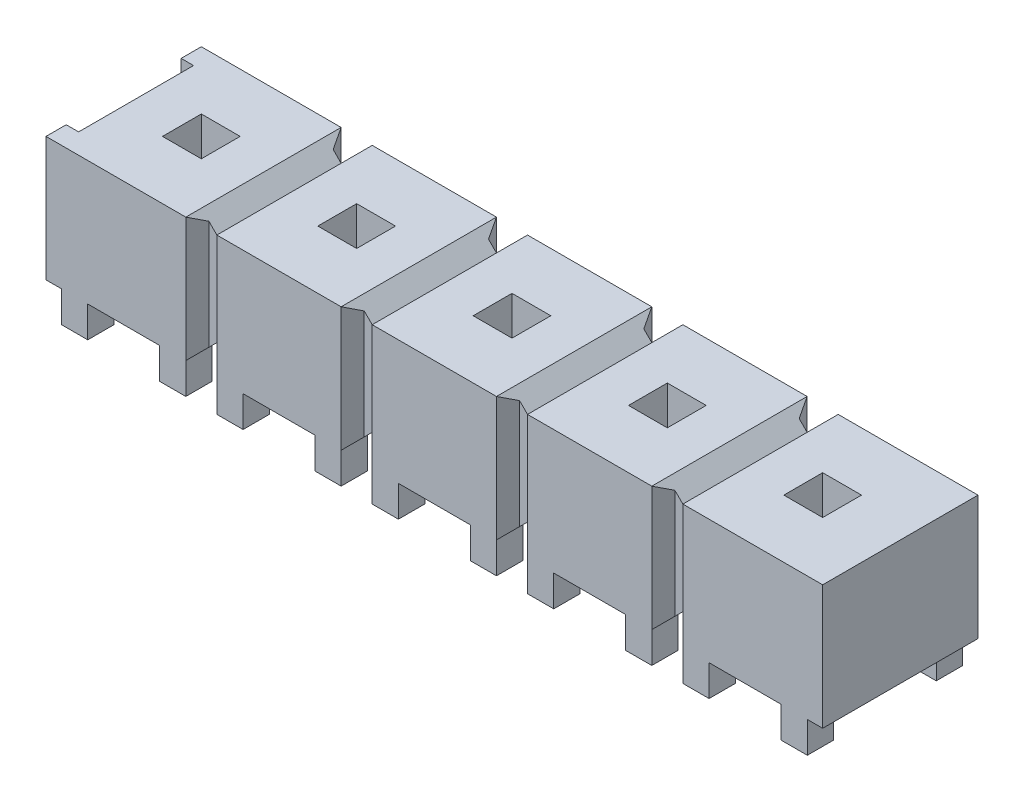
ISO-10303-21;
HEADER;
FILE_DESCRIPTION(('STEP AP214'),'2;1');
FILE_NAME('part.step','',(''),(''),'','','');
FILE_SCHEMA(('AUTOMOTIVE_DESIGN { 1 0 10303 214 1 1 1 1 }'));
ENDSEC;
DATA;
#1=APPLICATION_CONTEXT('core data for automotive mechanical design processes');
#2=APPLICATION_PROTOCOL_DEFINITION('international standard','automotive_design',2000,#1);
#3=PRODUCT_CONTEXT('',#1,'mechanical');
#4=PRODUCT('Part','Part','',(#3));
#5=PRODUCT_RELATED_PRODUCT_CATEGORY('part','',(#4));
#6=PRODUCT_DEFINITION_FORMATION('','',#4);
#7=PRODUCT_DEFINITION_CONTEXT('part definition',#1,'design');
#8=PRODUCT_DEFINITION('design','',#6,#7);
#9=PRODUCT_DEFINITION_SHAPE('','',#8);
#10=(LENGTH_UNIT() NAMED_UNIT(*) SI_UNIT(.MILLI.,.METRE.));
#11=(NAMED_UNIT(*) PLANE_ANGLE_UNIT() SI_UNIT($,.RADIAN.));
#12=(NAMED_UNIT(*) SI_UNIT($,.STERADIAN.) SOLID_ANGLE_UNIT());
#13=UNCERTAINTY_MEASURE_WITH_UNIT(LENGTH_MEASURE(1.E-05),#10,'distance_accuracy_value','');
#14=(GEOMETRIC_REPRESENTATION_CONTEXT(3) GLOBAL_UNCERTAINTY_ASSIGNED_CONTEXT((#13)) GLOBAL_UNIT_ASSIGNED_CONTEXT((#10,
#11,#12)) REPRESENTATION_CONTEXT('',''));
#15=CARTESIAN_POINT('',(0.,0.,0.));
#16=DIRECTION('',(0.,0.,1.));
#17=DIRECTION('',(1.,0.,0.));
#18=AXIS2_PLACEMENT_3D('',#15,#16,#17);
#19=CARTESIAN_POINT('',(3.81,2.286,12.7));
#20=DIRECTION('',(-0.707106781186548,0.707106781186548,0.));
#21=DIRECTION('',(-0.707106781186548,-0.707106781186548,0.));
#22=AXIS2_PLACEMENT_3D('',#19,#20,#21);
#23=PLANE('',#22);
#24=DIRECTION('',(0.707106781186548,0.707106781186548,0.));
#25=VECTOR('',#24,1.);
#26=CARTESIAN_POINT('',(3.81,2.286,1.016));
#27=LINE('',#26,#25);
#28=CARTESIAN_POINT('',(3.81,2.286,1.016));
#29=VERTEX_POINT('',#28);
#30=CARTESIAN_POINT('',(3.94011592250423,2.41611592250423,1.016));
#31=VERTEX_POINT('',#30);
#32=EDGE_CURVE('E907',#29,#31,#27,.T.);
#33=ORIENTED_EDGE('',*,*,#32,.T.);
#34=DIRECTION('',(0.401488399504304,0.401488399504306,0.823173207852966));
#35=VECTOR('',#34,1.);
#36=CARTESIAN_POINT('',(3.94011592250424,2.41611592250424,1.016));
#37=LINE('',#36,#35);
#38=CARTESIAN_POINT('',(4.064,2.54,1.27));
#39=VERTEX_POINT('',#38);
#40=EDGE_CURVE('E895',#31,#39,#37,.T.);
#41=ORIENTED_EDGE('',*,*,#40,.T.);
#42=DIRECTION('',(0.,0.,-1.));
#43=VECTOR('',#42,1.);
#44=CARTESIAN_POINT('',(4.064,2.54,1.27));
#45=LINE('',#44,#43);
#46=CARTESIAN_POINT('',(4.064,2.54,-1.27));
#47=VERTEX_POINT('',#46);
#48=EDGE_CURVE('E906',#39,#47,#45,.T.);
#49=ORIENTED_EDGE('',*,*,#48,.T.);
#50=DIRECTION('',(-0.401488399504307,-0.401488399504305,0.823173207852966));
#51=VECTOR('',#50,1.);
#52=CARTESIAN_POINT('',(4.064,2.54,-1.27));
#53=LINE('',#52,#51);
#54=CARTESIAN_POINT('',(3.94011592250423,2.41611592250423,-1.016));
#55=VERTEX_POINT('',#54);
#56=EDGE_CURVE('E928',#47,#55,#53,.T.);
#57=ORIENTED_EDGE('',*,*,#56,.T.);
#58=DIRECTION('',(-0.707106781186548,-0.707106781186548,0.));
#59=VECTOR('',#58,1.);
#60=CARTESIAN_POINT('',(3.94011592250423,2.41611592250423,-1.016));
#61=LINE('',#60,#59);
#62=CARTESIAN_POINT('',(3.81,2.286,-1.016));
#63=VERTEX_POINT('',#62);
#64=EDGE_CURVE('E933',#55,#63,#61,.T.);
#65=ORIENTED_EDGE('',*,*,#64,.T.);
#66=DIRECTION('',(0.,0.,-1.));
#67=VECTOR('',#66,1.);
#68=CARTESIAN_POINT('',(3.81,2.286,1.016));
#69=LINE('',#68,#67);
#70=EDGE_CURVE('E920',#29,#63,#69,.T.);
#71=ORIENTED_EDGE('',*,*,#70,.F.);
#72=EDGE_LOOP('',(#33,#41,#49,#57,#65,#71));
#73=FACE_BOUND('',#72,.T.);
#74=ADVANCED_FACE('F17',(#73),#23,.T.);
#75=CARTESIAN_POINT('',(3.94011592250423,2.54,1.016));
#76=DIRECTION('',(0.,0.,1.));
#77=DIRECTION('',(1.,0.,0.));
#78=AXIS2_PLACEMENT_3D('',#75,#76,#77);
#79=PLANE('',#78);
#80=DIRECTION('',(0.707106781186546,-0.707106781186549,0.));
#81=VECTOR('',#80,1.);
#82=CARTESIAN_POINT('',(3.67988407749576,2.41611592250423,1.016));
#83=LINE('',#82,#81);
#84=CARTESIAN_POINT('',(3.67988407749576,2.41611592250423,1.016));
#85=VERTEX_POINT('',#84);
#86=EDGE_CURVE('E940',#85,#29,#83,.T.);
#87=ORIENTED_EDGE('',*,*,#86,.F.);
#88=DIRECTION('',(0.,-1.,0.));
#89=VECTOR('',#88,1.);
#90=CARTESIAN_POINT('',(3.67988407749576,2.41611592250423,1.016));
#91=LINE('',#90,#89);
#92=CARTESIAN_POINT('',(3.67988407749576,0.631884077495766,1.016));
#93=VERTEX_POINT('',#92);
#94=EDGE_CURVE('E944',#85,#93,#91,.T.);
#95=ORIENTED_EDGE('',*,*,#94,.T.);
#96=DIRECTION('',(-0.707106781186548,-0.707106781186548,0.));
#97=VECTOR('',#96,1.);
#98=CARTESIAN_POINT('',(3.81,0.762,1.016));
#99=LINE('',#98,#97);
#100=CARTESIAN_POINT('',(3.81,0.762,1.016));
#101=VERTEX_POINT('',#100);
#102=EDGE_CURVE('E949',#101,#93,#99,.T.);
#103=ORIENTED_EDGE('',*,*,#102,.F.);
#104=DIRECTION('',(-0.707106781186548,0.707106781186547,0.));
#105=VECTOR('',#104,1.);
#106=CARTESIAN_POINT('',(3.94011592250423,0.631884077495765,1.016));
#107=LINE('',#106,#105);
#108=CARTESIAN_POINT('',(3.94011592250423,0.631884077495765,1.016));
#109=VERTEX_POINT('',#108);
#110=EDGE_CURVE('E915',#109,#101,#107,.T.);
#111=ORIENTED_EDGE('',*,*,#110,.F.);
#112=DIRECTION('',(0.,-1.,0.));
#113=VECTOR('',#112,1.);
#114=CARTESIAN_POINT('',(3.94011592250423,2.41611592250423,1.016));
#115=LINE('',#114,#113);
#116=EDGE_CURVE('E899',#31,#109,#115,.T.);
#117=ORIENTED_EDGE('',*,*,#116,.F.);
#118=ORIENTED_EDGE('',*,*,#32,.F.);
#119=EDGE_LOOP('',(#87,#95,#103,#111,#117,#118));
#120=FACE_BOUND('',#119,.T.);
#121=ADVANCED_FACE('F913',(#120),#79,.T.);
#122=CARTESIAN_POINT('',(4.064,2.54,1.27));
#123=DIRECTION('',(-0.898794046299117,0.,0.438371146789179));
#124=DIRECTION('',(0.438371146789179,0.,0.898794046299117));
#125=AXIS2_PLACEMENT_3D('',#122,#123,#124);
#126=PLANE('',#125);
#127=ORIENTED_EDGE('',*,*,#116,.T.);
#128=DIRECTION('',(-0.401488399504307,0.401488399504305,-0.823173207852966));
#129=VECTOR('',#128,1.);
#130=CARTESIAN_POINT('',(4.064,0.508000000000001,1.27));
#131=LINE('',#130,#129);
#132=CARTESIAN_POINT('',(4.064,0.508,1.27));
#133=VERTEX_POINT('',#132);
#134=EDGE_CURVE('E916',#133,#109,#131,.T.);
#135=ORIENTED_EDGE('',*,*,#134,.F.);
#136=DIRECTION('',(0.,-1.,0.));
#137=VECTOR('',#136,1.);
#138=CARTESIAN_POINT('',(4.064,2.54,1.27));
#139=LINE('',#138,#137);
#140=EDGE_CURVE('E901',#39,#133,#139,.T.);
#141=ORIENTED_EDGE('',*,*,#140,.F.);
#142=ORIENTED_EDGE('',*,*,#40,.F.);
#143=EDGE_LOOP('',(#127,#135,#141,#142));
#144=FACE_BOUND('',#143,.T.);
#145=ADVANCED_FACE('F897',(#144),#126,.T.);
#146=CARTESIAN_POINT('',(0.,2.54,0.));
#147=DIRECTION('',(0.,1.,0.));
#148=DIRECTION('',(0.,0.,1.));
#149=AXIS2_PLACEMENT_3D('',#146,#147,#148);
#150=PLANE('',#149);
#151=DIRECTION('',(-1.,0.,0.));
#152=VECTOR('',#151,1.);
#153=CARTESIAN_POINT('',(5.3975,2.54,-0.3175));
#154=LINE('',#153,#152);
#155=CARTESIAN_POINT('',(5.3975,2.54,-0.3175));
#156=VERTEX_POINT('',#155);
#157=CARTESIAN_POINT('',(4.7625,2.54,-0.3175));
#158=VERTEX_POINT('',#157);
#159=EDGE_CURVE('E964',#156,#158,#154,.T.);
#160=ORIENTED_EDGE('',*,*,#159,.F.);
#161=DIRECTION('',(0.,0.,-1.));
#162=VECTOR('',#161,1.);
#163=CARTESIAN_POINT('',(5.3975,2.54,0.3175));
#164=LINE('',#163,#162);
#165=CARTESIAN_POINT('',(5.3975,2.54,0.3175));
#166=VERTEX_POINT('',#165);
#167=EDGE_CURVE('E969',#166,#156,#164,.T.);
#168=ORIENTED_EDGE('',*,*,#167,.F.);
#169=DIRECTION('',(1.,0.,0.));
#170=VECTOR('',#169,1.);
#171=CARTESIAN_POINT('',(4.7625,2.54,0.3175));
#172=LINE('',#171,#170);
#173=CARTESIAN_POINT('',(4.7625,2.54,0.3175));
#174=VERTEX_POINT('',#173);
#175=EDGE_CURVE('E973',#174,#166,#172,.T.);
#176=ORIENTED_EDGE('',*,*,#175,.F.);
#177=DIRECTION('',(0.,0.,1.));
#178=VECTOR('',#177,1.);
#179=CARTESIAN_POINT('',(4.7625,2.54,-0.3175));
#180=LINE('',#179,#178);
#181=EDGE_CURVE('E977',#158,#174,#180,.T.);
#182=ORIENTED_EDGE('',*,*,#181,.F.);
#183=EDGE_LOOP('',(#160,#168,#176,#182));
#184=FACE_BOUND('',#183,.T.);
#185=DIRECTION('',(-1.,0.,0.));
#186=VECTOR('',#185,1.);
#187=CARTESIAN_POINT('',(6.35,2.54,-1.27));
#188=LINE('',#187,#186);
#189=CARTESIAN_POINT('',(6.35,2.54,-1.27));
#190=VERTEX_POINT('',#189);
#191=EDGE_CURVE('E981',#190,#47,#188,.T.);
#192=ORIENTED_EDGE('',*,*,#191,.T.);
#193=ORIENTED_EDGE('',*,*,#48,.F.);
#194=DIRECTION('',(1.,0.,0.));
#195=VECTOR('',#194,1.);
#196=CARTESIAN_POINT('',(4.064,2.54,1.27));
#197=LINE('',#196,#195);
#198=CARTESIAN_POINT('',(6.35,2.54,1.27));
#199=VERTEX_POINT('',#198);
#200=EDGE_CURVE('E986',#39,#199,#197,.T.);
#201=ORIENTED_EDGE('',*,*,#200,.T.);
#202=DIRECTION('',(0.,0.,-1.));
#203=VECTOR('',#202,1.);
#204=CARTESIAN_POINT('',(6.35,2.54,1.27));
#205=LINE('',#204,#203);
#206=EDGE_CURVE('E991',#199,#190,#205,.T.);
#207=ORIENTED_EDGE('',*,*,#206,.T.);
#208=EDGE_LOOP('',(#192,#193,#201,#207));
#209=FACE_BOUND('',#208,.T.);
#210=ADVANCED_FACE('F3076',(#184,#209),#150,.T.);
#211=CARTESIAN_POINT('',(3.94011592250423,2.54,-1.016));
#212=DIRECTION('',(-0.898794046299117,0.,-0.438371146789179));
#213=DIRECTION('',(-0.438371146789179,0.,0.898794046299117));
#214=AXIS2_PLACEMENT_3D('',#211,#212,#213);
#215=PLANE('',#214);
#216=DIRECTION('',(0.,-1.,0.));
#217=VECTOR('',#216,1.);
#218=CARTESIAN_POINT('',(4.064,2.54,-1.27));
#219=LINE('',#218,#217);
#220=CARTESIAN_POINT('',(4.064,0.508,-1.27));
#221=VERTEX_POINT('',#220);
#222=EDGE_CURVE('E996',#47,#221,#219,.T.);
#223=ORIENTED_EDGE('',*,*,#222,.T.);
#224=DIRECTION('',(0.401488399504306,-0.401488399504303,-0.823173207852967));
#225=VECTOR('',#224,1.);
#226=CARTESIAN_POINT('',(3.94011592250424,0.631884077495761,-1.016));
#227=LINE('',#226,#225);
#228=CARTESIAN_POINT('',(3.94011592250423,0.631884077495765,-1.016));
#229=VERTEX_POINT('',#228);
#230=EDGE_CURVE('E1001',#229,#221,#227,.T.);
#231=ORIENTED_EDGE('',*,*,#230,.F.);
#232=DIRECTION('',(0.,-1.,0.));
#233=VECTOR('',#232,1.);
#234=CARTESIAN_POINT('',(3.94011592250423,2.41611592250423,-1.016));
#235=LINE('',#234,#233);
#236=EDGE_CURVE('E1006',#55,#229,#235,.T.);
#237=ORIENTED_EDGE('',*,*,#236,.F.);
#238=ORIENTED_EDGE('',*,*,#56,.F.);
#239=EDGE_LOOP('',(#223,#231,#237,#238));
#240=FACE_BOUND('',#239,.T.);
#241=ADVANCED_FACE('F3079',(#240),#215,.T.);
#242=CARTESIAN_POINT('',(3.67988407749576,2.54,-1.016));
#243=DIRECTION('',(0.,0.,-1.));
#244=DIRECTION('',(-1.,0.,0.));
#245=AXIS2_PLACEMENT_3D('',#242,#243,#244);
#246=PLANE('',#245);
#247=ORIENTED_EDGE('',*,*,#236,.T.);
#248=DIRECTION('',(0.707106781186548,-0.707106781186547,0.));
#249=VECTOR('',#248,1.);
#250=CARTESIAN_POINT('',(3.81,0.762,-1.016));
#251=LINE('',#250,#249);
#252=CARTESIAN_POINT('',(3.81,0.762,-1.016));
#253=VERTEX_POINT('',#252);
#254=EDGE_CURVE('E1011',#253,#229,#251,.T.);
#255=ORIENTED_EDGE('',*,*,#254,.F.);
#256=DIRECTION('',(0.707106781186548,0.707106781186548,0.));
#257=VECTOR('',#256,1.);
#258=CARTESIAN_POINT('',(3.67988407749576,0.631884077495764,-1.016));
#259=LINE('',#258,#257);
#260=CARTESIAN_POINT('',(3.67988407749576,0.631884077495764,-1.016));
#261=VERTEX_POINT('',#260);
#262=EDGE_CURVE('E1015',#261,#253,#259,.T.);
#263=ORIENTED_EDGE('',*,*,#262,.F.);
#264=DIRECTION('',(0.,-1.,0.));
#265=VECTOR('',#264,1.);
#266=CARTESIAN_POINT('',(3.67988407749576,2.41611592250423,-1.016));
#267=LINE('',#266,#265);
#268=CARTESIAN_POINT('',(3.67988407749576,2.41611592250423,-1.016));
#269=VERTEX_POINT('',#268);
#270=EDGE_CURVE('E1020',#269,#261,#267,.T.);
#271=ORIENTED_EDGE('',*,*,#270,.F.);
#272=DIRECTION('',(-0.707106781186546,0.707106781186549,0.));
#273=VECTOR('',#272,1.);
#274=CARTESIAN_POINT('',(3.81,2.286,-1.016));
#275=LINE('',#274,#273);
#276=EDGE_CURVE('E1024',#63,#269,#275,.T.);
#277=ORIENTED_EDGE('',*,*,#276,.F.);
#278=ORIENTED_EDGE('',*,*,#64,.F.);
#279=EDGE_LOOP('',(#247,#255,#263,#271,#277,#278));
#280=FACE_BOUND('',#279,.T.);
#281=ADVANCED_FACE('F3085',(#280),#246,.T.);
#282=CARTESIAN_POINT('',(3.556,2.54,12.7));
#283=DIRECTION('',(0.707106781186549,0.707106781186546,0.));
#284=DIRECTION('',(-0.707106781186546,0.707106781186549,0.));
#285=AXIS2_PLACEMENT_3D('',#282,#283,#284);
#286=PLANE('',#285);
#287=DIRECTION('',(0.401488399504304,-0.401488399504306,-0.823173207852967));
#288=VECTOR('',#287,1.);
#289=CARTESIAN_POINT('',(3.556,2.54,1.27));
#290=LINE('',#289,#288);
#291=CARTESIAN_POINT('',(3.556,2.54,1.27));
#292=VERTEX_POINT('',#291);
#293=EDGE_CURVE('E1029',#292,#85,#290,.T.);
#294=ORIENTED_EDGE('',*,*,#293,.T.);
#295=ORIENTED_EDGE('',*,*,#86,.T.);
#296=ORIENTED_EDGE('',*,*,#70,.T.);
#297=ORIENTED_EDGE('',*,*,#276,.T.);
#298=DIRECTION('',(-0.401488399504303,0.401488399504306,-0.823173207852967));
#299=VECTOR('',#298,1.);
#300=CARTESIAN_POINT('',(3.67988407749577,2.41611592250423,-1.016));
#301=LINE('',#300,#299);
#302=CARTESIAN_POINT('',(3.556,2.54,-1.27));
#303=VERTEX_POINT('',#302);
#304=EDGE_CURVE('E1034',#269,#303,#301,.T.);
#305=ORIENTED_EDGE('',*,*,#304,.T.);
#306=DIRECTION('',(0.,0.,-1.));
#307=VECTOR('',#306,1.);
#308=CARTESIAN_POINT('',(3.556,2.54,1.27));
#309=LINE('',#308,#307);
#310=EDGE_CURVE('E1039',#292,#303,#309,.T.);
#311=ORIENTED_EDGE('',*,*,#310,.F.);
#312=EDGE_LOOP('',(#294,#295,#296,#297,#305,#311));
#313=FACE_BOUND('',#312,.T.);
#314=ADVANCED_FACE('F3089',(#313),#286,.T.);
#315=CARTESIAN_POINT('',(3.67988407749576,2.54,1.016));
#316=DIRECTION('',(0.898794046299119,0.,0.438371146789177));
#317=DIRECTION('',(0.438371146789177,0.,-0.898794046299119));
#318=AXIS2_PLACEMENT_3D('',#315,#316,#317);
#319=PLANE('',#318);
#320=DIRECTION('',(0.,-1.,0.));
#321=VECTOR('',#320,1.);
#322=CARTESIAN_POINT('',(3.556,2.54,1.27));
#323=LINE('',#322,#321);
#324=CARTESIAN_POINT('',(3.556,0.508,1.27));
#325=VERTEX_POINT('',#324);
#326=EDGE_CURVE('E1044',#292,#325,#323,.T.);
#327=ORIENTED_EDGE('',*,*,#326,.T.);
#328=DIRECTION('',(-0.401488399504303,-0.401488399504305,0.823173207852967));
#329=VECTOR('',#328,1.);
#330=CARTESIAN_POINT('',(3.67988407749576,0.631884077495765,1.016));
#331=LINE('',#330,#329);
#332=EDGE_CURVE('E1049',#93,#325,#331,.T.);
#333=ORIENTED_EDGE('',*,*,#332,.F.);
#334=ORIENTED_EDGE('',*,*,#94,.F.);
#335=ORIENTED_EDGE('',*,*,#293,.F.);
#336=EDGE_LOOP('',(#327,#333,#334,#335));
#337=FACE_BOUND('',#336,.T.);
#338=ADVANCED_FACE('F3093',(#337),#319,.T.);
#339=CARTESIAN_POINT('',(3.81,0.762,12.7));
#340=DIRECTION('',(0.707106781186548,-0.707106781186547,0.));
#341=DIRECTION('',(0.707106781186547,0.707106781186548,0.));
#342=AXIS2_PLACEMENT_3D('',#339,#340,#341);
#343=PLANE('',#342);
#344=DIRECTION('',(0.,0.,-1.));
#345=VECTOR('',#344,1.);
#346=CARTESIAN_POINT('',(3.81,0.762,1.016));
#347=LINE('',#346,#345);
#348=EDGE_CURVE('E1054',#101,#253,#347,.T.);
#349=ORIENTED_EDGE('',*,*,#348,.F.);
#350=ORIENTED_EDGE('',*,*,#102,.T.);
#351=ORIENTED_EDGE('',*,*,#332,.T.);
#352=DIRECTION('',(0.,0.,-1.));
#353=VECTOR('',#352,1.);
#354=CARTESIAN_POINT('',(3.556,0.508,1.27));
#355=LINE('',#354,#353);
#356=CARTESIAN_POINT('',(3.556,0.508,0.8382));
#357=VERTEX_POINT('',#356);
#358=EDGE_CURVE('E1058',#325,#357,#355,.T.);
#359=ORIENTED_EDGE('',*,*,#358,.T.);
#360=DIRECTION('',(0.,0.,-1.));
#361=VECTOR('',#360,1.);
#362=CARTESIAN_POINT('',(3.556,0.508,0.838200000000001));
#363=LINE('',#362,#361);
#364=CARTESIAN_POINT('',(3.556,0.508,-0.8382));
#365=VERTEX_POINT('',#364);
#366=EDGE_CURVE('E1063',#357,#365,#363,.T.);
#367=ORIENTED_EDGE('',*,*,#366,.T.);
#368=DIRECTION('',(0.,0.,-1.));
#369=VECTOR('',#368,1.);
#370=CARTESIAN_POINT('',(3.556,0.508,-0.838200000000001));
#371=LINE('',#370,#369);
#372=CARTESIAN_POINT('',(3.556,0.508,-1.27));
#373=VERTEX_POINT('',#372);
#374=EDGE_CURVE('E1068',#365,#373,#371,.T.);
#375=ORIENTED_EDGE('',*,*,#374,.T.);
#376=DIRECTION('',(0.401488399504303,0.401488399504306,0.823173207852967));
#377=VECTOR('',#376,1.);
#378=CARTESIAN_POINT('',(3.556,0.508000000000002,-1.27));
#379=LINE('',#378,#377);
#380=EDGE_CURVE('E1073',#373,#261,#379,.T.);
#381=ORIENTED_EDGE('',*,*,#380,.T.);
#382=ORIENTED_EDGE('',*,*,#262,.T.);
#383=EDGE_LOOP('',(#349,#350,#351,#359,#367,#375,#381,#382));
#384=FACE_BOUND('',#383,.T.);
#385=ADVANCED_FACE('F3097',(#384),#343,.T.);
#386=CARTESIAN_POINT('',(4.064,0.508,12.7));
#387=DIRECTION('',(-0.707106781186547,-0.707106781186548,0.));
#388=DIRECTION('',(0.707106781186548,-0.707106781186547,0.));
#389=AXIS2_PLACEMENT_3D('',#386,#387,#388);
#390=PLANE('',#389);
#391=DIRECTION('',(0.,0.,-1.));
#392=VECTOR('',#391,1.);
#393=CARTESIAN_POINT('',(4.064,0.508,1.27));
#394=LINE('',#393,#392);
#395=CARTESIAN_POINT('',(4.064,0.508,0.8382));
#396=VERTEX_POINT('',#395);
#397=EDGE_CURVE('E1078',#133,#396,#394,.T.);
#398=ORIENTED_EDGE('',*,*,#397,.F.);
#399=ORIENTED_EDGE('',*,*,#134,.T.);
#400=ORIENTED_EDGE('',*,*,#110,.T.);
#401=ORIENTED_EDGE('',*,*,#348,.T.);
#402=ORIENTED_EDGE('',*,*,#254,.T.);
#403=ORIENTED_EDGE('',*,*,#230,.T.);
#404=DIRECTION('',(0.,0.,-1.));
#405=VECTOR('',#404,1.);
#406=CARTESIAN_POINT('',(4.064,0.508,-0.838200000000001));
#407=LINE('',#406,#405);
#408=CARTESIAN_POINT('',(4.064,0.508,-0.8382));
#409=VERTEX_POINT('',#408);
#410=EDGE_CURVE('E1083',#409,#221,#407,.T.);
#411=ORIENTED_EDGE('',*,*,#410,.F.);
#412=DIRECTION('',(0.,0.,1.));
#413=VECTOR('',#412,1.);
#414=CARTESIAN_POINT('',(4.064,0.508,-0.838200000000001));
#415=LINE('',#414,#413);
#416=EDGE_CURVE('E1087',#409,#396,#415,.T.);
#417=ORIENTED_EDGE('',*,*,#416,.T.);
#418=EDGE_LOOP('',(#398,#399,#400,#401,#402,#403,#411,#417));
#419=FACE_BOUND('',#418,.T.);
#420=ADVANCED_FACE('F3101',(#419),#390,.T.);
#421=CARTESIAN_POINT('',(-6.35,2.54,1.27));
#422=DIRECTION('',(0.,0.,-1.));
#423=DIRECTION('',(-1.,0.,0.));
#424=AXIS2_PLACEMENT_3D('',#421,#422,#423);
#425=PLANE('',#424);
#426=ORIENTED_EDGE('',*,*,#140,.T.);
#427=DIRECTION('',(0.,1.,0.));
#428=VECTOR('',#427,1.);
#429=CARTESIAN_POINT('',(4.064,0.,1.27));
#430=LINE('',#429,#428);
#431=CARTESIAN_POINT('',(4.064,0.,1.27));
#432=VERTEX_POINT('',#431);
#433=EDGE_CURVE('E1092',#432,#133,#430,.T.);
#434=ORIENTED_EDGE('',*,*,#433,.F.);
#435=DIRECTION('',(1.,0.,0.));
#436=VECTOR('',#435,1.);
#437=CARTESIAN_POINT('',(4.064,0.,1.27));
#438=LINE('',#437,#436);
#439=CARTESIAN_POINT('',(4.492684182,0.,1.27));
#440=VERTEX_POINT('',#439);
#441=EDGE_CURVE('E1096',#432,#440,#438,.T.);
#442=ORIENTED_EDGE('',*,*,#441,.T.);
#443=DIRECTION('',(0.,-1.,0.));
#444=VECTOR('',#443,1.);
#445=CARTESIAN_POINT('',(4.492684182,0.508,1.27));
#446=LINE('',#445,#444);
#447=CARTESIAN_POINT('',(4.492684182,0.508,1.27));
#448=VERTEX_POINT('',#447);
#449=EDGE_CURVE('E1101',#448,#440,#446,.T.);
#450=ORIENTED_EDGE('',*,*,#449,.F.);
#451=DIRECTION('',(-1.,0.,0.));
#452=VECTOR('',#451,1.);
#453=CARTESIAN_POINT('',(5.667316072,0.508,1.27));
#454=LINE('',#453,#452);
#455=CARTESIAN_POINT('',(5.667316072,0.508,1.27));
#456=VERTEX_POINT('',#455);
#457=EDGE_CURVE('E1105',#456,#448,#454,.T.);
#458=ORIENTED_EDGE('',*,*,#457,.F.);
#459=DIRECTION('',(0.,1.,0.));
#460=VECTOR('',#459,1.);
#461=CARTESIAN_POINT('',(5.667316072,0.,1.27));
#462=LINE('',#461,#460);
#463=CARTESIAN_POINT('',(5.667316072,0.,1.27));
#464=VERTEX_POINT('',#463);
#465=EDGE_CURVE('E1110',#464,#456,#462,.T.);
#466=ORIENTED_EDGE('',*,*,#465,.F.);
#467=DIRECTION('',(1.,0.,0.));
#468=VECTOR('',#467,1.);
#469=CARTESIAN_POINT('',(5.667316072,0.,1.27));
#470=LINE('',#469,#468);
#471=CARTESIAN_POINT('',(6.099115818,0.,1.27));
#472=VERTEX_POINT('',#471);
#473=EDGE_CURVE('E1114',#464,#472,#470,.T.);
#474=ORIENTED_EDGE('',*,*,#473,.T.);
#475=DIRECTION('',(0.,-1.,0.));
#476=VECTOR('',#475,1.);
#477=CARTESIAN_POINT('',(6.099115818,0.508,1.27));
#478=LINE('',#477,#476);
#479=CARTESIAN_POINT('',(6.099115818,0.508,1.27));
#480=VERTEX_POINT('',#479);
#481=EDGE_CURVE('E1119',#480,#472,#478,.T.);
#482=ORIENTED_EDGE('',*,*,#481,.F.);
#483=DIRECTION('',(-1.,0.,0.));
#484=VECTOR('',#483,1.);
#485=CARTESIAN_POINT('',(6.35,0.508,1.27));
#486=LINE('',#485,#484);
#487=CARTESIAN_POINT('',(6.35,0.508,1.27));
#488=VERTEX_POINT('',#487);
#489=EDGE_CURVE('E1123',#488,#480,#486,.T.);
#490=ORIENTED_EDGE('',*,*,#489,.F.);
#491=DIRECTION('',(0.,-1.,0.));
#492=VECTOR('',#491,1.);
#493=CARTESIAN_POINT('',(6.35,2.54,1.27));
#494=LINE('',#493,#492);
#495=EDGE_CURVE('E1128',#199,#488,#494,.T.);
#496=ORIENTED_EDGE('',*,*,#495,.F.);
#497=ORIENTED_EDGE('',*,*,#200,.F.);
#498=EDGE_LOOP('',(#426,#434,#442,#450,#458,#466,#474,#482,#490,#496,#497));
#499=FACE_BOUND('',#498,.T.);
#500=ADVANCED_FACE('F3105',(#499),#425,.F.);
#501=CARTESIAN_POINT('',(5.3975,2.54,-0.3175));
#502=DIRECTION('',(0.,0.,1.));
#503=DIRECTION('',(1.,0.,0.));
#504=AXIS2_PLACEMENT_3D('',#501,#502,#503);
#505=PLANE('',#504);
#506=DIRECTION('',(0.,-1.,0.));
#507=VECTOR('',#506,1.);
#508=CARTESIAN_POINT('',(4.7625,2.54,-0.3175));
#509=LINE('',#508,#507);
#510=CARTESIAN_POINT('',(4.7625,0.508,-0.3175));
#511=VERTEX_POINT('',#510);
#512=EDGE_CURVE('E1133',#158,#511,#509,.T.);
#513=ORIENTED_EDGE('',*,*,#512,.T.);
#514=DIRECTION('',(1.,0.,0.));
#515=VECTOR('',#514,1.);
#516=CARTESIAN_POINT('',(4.7625,0.508,-0.3175));
#517=LINE('',#516,#515);
#518=CARTESIAN_POINT('',(5.3975,0.508,-0.3175));
#519=VERTEX_POINT('',#518);
#520=EDGE_CURVE('E1138',#511,#519,#517,.T.);
#521=ORIENTED_EDGE('',*,*,#520,.T.);
#522=DIRECTION('',(0.,-1.,0.));
#523=VECTOR('',#522,1.);
#524=CARTESIAN_POINT('',(5.3975,2.54,-0.3175));
#525=LINE('',#524,#523);
#526=EDGE_CURVE('E1143',#156,#519,#525,.T.);
#527=ORIENTED_EDGE('',*,*,#526,.F.);
#528=ORIENTED_EDGE('',*,*,#159,.T.);
#529=EDGE_LOOP('',(#513,#521,#527,#528));
#530=FACE_BOUND('',#529,.T.);
#531=ADVANCED_FACE('F3109',(#530),#505,.T.);
#532=CARTESIAN_POINT('',(5.3975,2.54,0.3175));
#533=DIRECTION('',(-1.,0.,0.));
#534=DIRECTION('',(0.,0.,1.));
#535=AXIS2_PLACEMENT_3D('',#532,#533,#534);
#536=PLANE('',#535);
#537=ORIENTED_EDGE('',*,*,#526,.T.);
#538=DIRECTION('',(0.,0.,1.));
#539=VECTOR('',#538,1.);
#540=CARTESIAN_POINT('',(5.3975,0.508,-0.3175));
#541=LINE('',#540,#539);
#542=CARTESIAN_POINT('',(5.3975,0.508,0.3175));
#543=VERTEX_POINT('',#542);
#544=EDGE_CURVE('E1148',#519,#543,#541,.T.);
#545=ORIENTED_EDGE('',*,*,#544,.T.);
#546=DIRECTION('',(0.,-1.,0.));
#547=VECTOR('',#546,1.);
#548=CARTESIAN_POINT('',(5.3975,2.54,0.3175));
#549=LINE('',#548,#547);
#550=EDGE_CURVE('E1153',#166,#543,#549,.T.);
#551=ORIENTED_EDGE('',*,*,#550,.F.);
#552=ORIENTED_EDGE('',*,*,#167,.T.);
#553=EDGE_LOOP('',(#537,#545,#551,#552));
#554=FACE_BOUND('',#553,.T.);
#555=ADVANCED_FACE('F3115',(#554),#536,.T.);
#556=CARTESIAN_POINT('',(4.7625,2.54,0.3175));
#557=DIRECTION('',(0.,0.,-1.));
#558=DIRECTION('',(-1.,0.,0.));
#559=AXIS2_PLACEMENT_3D('',#556,#557,#558);
#560=PLANE('',#559);
#561=ORIENTED_EDGE('',*,*,#550,.T.);
#562=DIRECTION('',(-1.,0.,0.));
#563=VECTOR('',#562,1.);
#564=CARTESIAN_POINT('',(5.3975,0.508,0.3175));
#565=LINE('',#564,#563);
#566=CARTESIAN_POINT('',(4.7625,0.508,0.3175));
#567=VERTEX_POINT('',#566);
#568=EDGE_CURVE('E1158',#543,#567,#565,.T.);
#569=ORIENTED_EDGE('',*,*,#568,.T.);
#570=DIRECTION('',(0.,-1.,0.));
#571=VECTOR('',#570,1.);
#572=CARTESIAN_POINT('',(4.7625,2.54,0.3175));
#573=LINE('',#572,#571);
#574=EDGE_CURVE('E1163',#174,#567,#573,.T.);
#575=ORIENTED_EDGE('',*,*,#574,.F.);
#576=ORIENTED_EDGE('',*,*,#175,.T.);
#577=EDGE_LOOP('',(#561,#569,#575,#576));
#578=FACE_BOUND('',#577,.T.);
#579=ADVANCED_FACE('F3119',(#578),#560,.T.);
#580=CARTESIAN_POINT('',(4.7625,2.54,-0.3175));
#581=DIRECTION('',(1.,0.,0.));
#582=DIRECTION('',(0.,0.,-1.));
#583=AXIS2_PLACEMENT_3D('',#580,#581,#582);
#584=PLANE('',#583);
#585=ORIENTED_EDGE('',*,*,#574,.T.);
#586=DIRECTION('',(0.,0.,-1.));
#587=VECTOR('',#586,1.);
#588=CARTESIAN_POINT('',(4.7625,0.508,0.3175));
#589=LINE('',#588,#587);
#590=EDGE_CURVE('E1168',#567,#511,#589,.T.);
#591=ORIENTED_EDGE('',*,*,#590,.T.);
#592=ORIENTED_EDGE('',*,*,#512,.F.);
#593=ORIENTED_EDGE('',*,*,#181,.T.);
#594=EDGE_LOOP('',(#585,#591,#592,#593));
#595=FACE_BOUND('',#594,.T.);
#596=ADVANCED_FACE('F3123',(#595),#584,.T.);
#597=CARTESIAN_POINT('',(6.35,2.54,-1.27));
#598=DIRECTION('',(0.,0.,1.));
#599=DIRECTION('',(1.,0.,0.));
#600=AXIS2_PLACEMENT_3D('',#597,#598,#599);
#601=PLANE('',#600);
#602=ORIENTED_EDGE('',*,*,#222,.F.);
#603=ORIENTED_EDGE('',*,*,#191,.F.);
#604=DIRECTION('',(0.,-1.,0.));
#605=VECTOR('',#604,1.);
#606=CARTESIAN_POINT('',(6.35,2.54,-1.27));
#607=LINE('',#606,#605);
#608=CARTESIAN_POINT('',(6.35,0.508,-1.27));
#609=VERTEX_POINT('',#608);
#610=EDGE_CURVE('E1173',#190,#609,#607,.T.);
#611=ORIENTED_EDGE('',*,*,#610,.T.);
#612=DIRECTION('',(1.,0.,0.));
#613=VECTOR('',#612,1.);
#614=CARTESIAN_POINT('',(6.099115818,0.508,-1.27));
#615=LINE('',#614,#613);
#616=CARTESIAN_POINT('',(6.099115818,0.508,-1.27));
#617=VERTEX_POINT('',#616);
#618=EDGE_CURVE('E1178',#617,#609,#615,.T.);
#619=ORIENTED_EDGE('',*,*,#618,.F.);
#620=DIRECTION('',(0.,1.,0.));
#621=VECTOR('',#620,1.);
#622=CARTESIAN_POINT('',(6.099115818,0.,-1.27));
#623=LINE('',#622,#621);
#624=CARTESIAN_POINT('',(6.099115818,0.,-1.27));
#625=VERTEX_POINT('',#624);
#626=EDGE_CURVE('E1182',#625,#617,#623,.T.);
#627=ORIENTED_EDGE('',*,*,#626,.F.);
#628=DIRECTION('',(-1.,0.,0.));
#629=VECTOR('',#628,1.);
#630=CARTESIAN_POINT('',(6.099115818,0.,-1.27));
#631=LINE('',#630,#629);
#632=CARTESIAN_POINT('',(5.667316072,0.,-1.27));
#633=VERTEX_POINT('',#632);
#634=EDGE_CURVE('E1186',#625,#633,#631,.T.);
#635=ORIENTED_EDGE('',*,*,#634,.T.);
#636=DIRECTION('',(0.,-1.,0.));
#637=VECTOR('',#636,1.);
#638=CARTESIAN_POINT('',(5.667316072,0.508,-1.27));
#639=LINE('',#638,#637);
#640=CARTESIAN_POINT('',(5.667316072,0.508,-1.27));
#641=VERTEX_POINT('',#640);
#642=EDGE_CURVE('E1191',#641,#633,#639,.T.);
#643=ORIENTED_EDGE('',*,*,#642,.F.);
#644=DIRECTION('',(1.,0.,0.));
#645=VECTOR('',#644,1.);
#646=CARTESIAN_POINT('',(4.492684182,0.508,-1.27));
#647=LINE('',#646,#645);
#648=CARTESIAN_POINT('',(4.492684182,0.508,-1.27));
#649=VERTEX_POINT('',#648);
#650=EDGE_CURVE('E1195',#649,#641,#647,.T.);
#651=ORIENTED_EDGE('',*,*,#650,.F.);
#652=DIRECTION('',(0.,1.,0.));
#653=VECTOR('',#652,1.);
#654=CARTESIAN_POINT('',(4.492684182,0.,-1.27));
#655=LINE('',#654,#653);
#656=CARTESIAN_POINT('',(4.492684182,0.,-1.27));
#657=VERTEX_POINT('',#656);
#658=EDGE_CURVE('E1200',#657,#649,#655,.T.);
#659=ORIENTED_EDGE('',*,*,#658,.F.);
#660=DIRECTION('',(-1.,0.,0.));
#661=VECTOR('',#660,1.);
#662=CARTESIAN_POINT('',(4.492684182,0.,-1.27));
#663=LINE('',#662,#661);
#664=CARTESIAN_POINT('',(4.064,0.,-1.27));
#665=VERTEX_POINT('',#664);
#666=EDGE_CURVE('E1204',#657,#665,#663,.T.);
#667=ORIENTED_EDGE('',*,*,#666,.T.);
#668=DIRECTION('',(0.,-1.,0.));
#669=VECTOR('',#668,1.);
#670=CARTESIAN_POINT('',(4.064,0.508,-1.27));
#671=LINE('',#670,#669);
#672=EDGE_CURVE('E1209',#221,#665,#671,.T.);
#673=ORIENTED_EDGE('',*,*,#672,.F.);
#674=EDGE_LOOP('',(#602,#603,#611,#619,#627,#635,#643,#651,#659,#667,#673));
#675=FACE_BOUND('',#674,.T.);
#676=ADVANCED_FACE('F3127',(#675),#601,.F.);
#677=CARTESIAN_POINT('',(6.35,2.54,1.27));
#678=DIRECTION('',(-1.,0.,0.));
#679=DIRECTION('',(0.,0.,1.));
#680=AXIS2_PLACEMENT_3D('',#677,#678,#679);
#681=PLANE('',#680);
#682=DIRECTION('',(0.,0.,1.));
#683=VECTOR('',#682,1.);
#684=CARTESIAN_POINT('',(6.35,0.508,-1.27));
#685=LINE('',#684,#683);
#686=EDGE_CURVE('E1214',#609,#488,#685,.T.);
#687=ORIENTED_EDGE('',*,*,#686,.F.);
#688=ORIENTED_EDGE('',*,*,#610,.F.);
#689=ORIENTED_EDGE('',*,*,#206,.F.);
#690=ORIENTED_EDGE('',*,*,#495,.T.);
#691=EDGE_LOOP('',(#687,#688,#689,#690));
#692=FACE_BOUND('',#691,.T.);
#693=ADVANCED_FACE('F3131',(#692),#681,.F.);
#694=CARTESIAN_POINT('',(3.556,2.54,-1.27));
#695=DIRECTION('',(0.898794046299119,0.,-0.438371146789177));
#696=DIRECTION('',(-0.438371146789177,0.,-0.898794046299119));
#697=AXIS2_PLACEMENT_3D('',#694,#695,#696);
#698=PLANE('',#697);
#699=ORIENTED_EDGE('',*,*,#270,.T.);
#700=ORIENTED_EDGE('',*,*,#380,.F.);
#701=DIRECTION('',(0.,-1.,0.));
#702=VECTOR('',#701,1.);
#703=CARTESIAN_POINT('',(3.556,2.54,-1.27));
#704=LINE('',#703,#702);
#705=EDGE_CURVE('E1218',#303,#373,#704,.T.);
#706=ORIENTED_EDGE('',*,*,#705,.F.);
#707=ORIENTED_EDGE('',*,*,#304,.F.);
#708=EDGE_LOOP('',(#699,#700,#706,#707));
#709=FACE_BOUND('',#708,.T.);
#710=ADVANCED_FACE('F3137',(#709),#698,.T.);
#711=DIRECTION('',(-1.,0.,0.));
#712=VECTOR('',#711,1.);
#713=CARTESIAN_POINT('',(2.8575,2.54,-0.3175));
#714=LINE('',#713,#712);
#715=CARTESIAN_POINT('',(2.8575,2.54,-0.3175));
#716=VERTEX_POINT('',#715);
#717=CARTESIAN_POINT('',(2.2225,2.54,-0.3175));
#718=VERTEX_POINT('',#717);
#719=EDGE_CURVE('E1222',#716,#718,#714,.T.);
#720=ORIENTED_EDGE('',*,*,#719,.F.);
#721=DIRECTION('',(0.,0.,-1.));
#722=VECTOR('',#721,1.);
#723=CARTESIAN_POINT('',(2.8575,2.54,0.3175));
#724=LINE('',#723,#722);
#725=CARTESIAN_POINT('',(2.8575,2.54,0.3175));
#726=VERTEX_POINT('',#725);
#727=EDGE_CURVE('E1227',#726,#716,#724,.T.);
#728=ORIENTED_EDGE('',*,*,#727,.F.);
#729=DIRECTION('',(1.,0.,0.));
#730=VECTOR('',#729,1.);
#731=CARTESIAN_POINT('',(2.2225,2.54,0.3175));
#732=LINE('',#731,#730);
#733=CARTESIAN_POINT('',(2.2225,2.54,0.3175));
#734=VERTEX_POINT('',#733);
#735=EDGE_CURVE('E1231',#734,#726,#732,.T.);
#736=ORIENTED_EDGE('',*,*,#735,.F.);
#737=DIRECTION('',(0.,0.,1.));
#738=VECTOR('',#737,1.);
#739=CARTESIAN_POINT('',(2.2225,2.54,-0.3175));
#740=LINE('',#739,#738);
#741=EDGE_CURVE('E1235',#718,#734,#740,.T.);
#742=ORIENTED_EDGE('',*,*,#741,.F.);
#743=EDGE_LOOP('',(#720,#728,#736,#742));
#744=FACE_BOUND('',#743,.T.);
#745=DIRECTION('',(-1.,0.,0.));
#746=VECTOR('',#745,1.);
#747=CARTESIAN_POINT('',(3.556,2.54,-1.27));
#748=LINE('',#747,#746);
#749=CARTESIAN_POINT('',(1.524,2.54,-1.27));
#750=VERTEX_POINT('',#749);
#751=EDGE_CURVE('E1239',#303,#750,#748,.T.);
#752=ORIENTED_EDGE('',*,*,#751,.T.);
#753=DIRECTION('',(0.,0.,-1.));
#754=VECTOR('',#753,1.);
#755=CARTESIAN_POINT('',(1.524,2.54,1.27));
#756=LINE('',#755,#754);
#757=CARTESIAN_POINT('',(1.524,2.54,1.27));
#758=VERTEX_POINT('',#757);
#759=EDGE_CURVE('E1244',#758,#750,#756,.T.);
#760=ORIENTED_EDGE('',*,*,#759,.F.);
#761=DIRECTION('',(1.,0.,0.));
#762=VECTOR('',#761,1.);
#763=CARTESIAN_POINT('',(1.524,2.54,1.27));
#764=LINE('',#763,#762);
#765=EDGE_CURVE('E1249',#758,#292,#764,.T.);
#766=ORIENTED_EDGE('',*,*,#765,.T.);
#767=ORIENTED_EDGE('',*,*,#310,.T.);
#768=EDGE_LOOP('',(#752,#760,#766,#767));
#769=FACE_BOUND('',#768,.T.);
#770=ADVANCED_FACE('F3082',(#744,#769),#150,.T.);
#771=ORIENTED_EDGE('',*,*,#326,.F.);
#772=ORIENTED_EDGE('',*,*,#765,.F.);
#773=DIRECTION('',(0.,-1.,0.));
#774=VECTOR('',#773,1.);
#775=CARTESIAN_POINT('',(1.524,2.54,1.27));
#776=LINE('',#775,#774);
#777=CARTESIAN_POINT('',(1.524,0.508,1.27));
#778=VERTEX_POINT('',#777);
#779=EDGE_CURVE('E1254',#758,#778,#776,.T.);
#780=ORIENTED_EDGE('',*,*,#779,.T.);
#781=DIRECTION('',(0.,1.,0.));
#782=VECTOR('',#781,1.);
#783=CARTESIAN_POINT('',(1.524,0.,1.27));
#784=LINE('',#783,#782);
#785=CARTESIAN_POINT('',(1.524,0.,1.27));
#786=VERTEX_POINT('',#785);
#787=EDGE_CURVE('E1259',#786,#778,#784,.T.);
#788=ORIENTED_EDGE('',*,*,#787,.F.);
#789=DIRECTION('',(1.,0.,0.));
#790=VECTOR('',#789,1.);
#791=CARTESIAN_POINT('',(1.524,0.,1.27));
#792=LINE('',#791,#790);
#793=CARTESIAN_POINT('',(1.952684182,0.,1.27));
#794=VERTEX_POINT('',#793);
#795=EDGE_CURVE('E1264',#786,#794,#792,.T.);
#796=ORIENTED_EDGE('',*,*,#795,.T.);
#797=DIRECTION('',(0.,-1.,0.));
#798=VECTOR('',#797,1.);
#799=CARTESIAN_POINT('',(1.952684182,0.508,1.27));
#800=LINE('',#799,#798);
#801=CARTESIAN_POINT('',(1.952684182,0.508,1.27));
#802=VERTEX_POINT('',#801);
#803=EDGE_CURVE('E1269',#802,#794,#800,.T.);
#804=ORIENTED_EDGE('',*,*,#803,.F.);
#805=DIRECTION('',(-1.,0.,0.));
#806=VECTOR('',#805,1.);
#807=CARTESIAN_POINT('',(3.127316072,0.508,1.27));
#808=LINE('',#807,#806);
#809=CARTESIAN_POINT('',(3.127316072,0.508,1.27));
#810=VERTEX_POINT('',#809);
#811=EDGE_CURVE('E1273',#810,#802,#808,.T.);
#812=ORIENTED_EDGE('',*,*,#811,.F.);
#813=DIRECTION('',(0.,1.,0.));
#814=VECTOR('',#813,1.);
#815=CARTESIAN_POINT('',(3.127316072,0.,1.27));
#816=LINE('',#815,#814);
#817=CARTESIAN_POINT('',(3.127316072,0.,1.27));
#818=VERTEX_POINT('',#817);
#819=EDGE_CURVE('E1278',#818,#810,#816,.T.);
#820=ORIENTED_EDGE('',*,*,#819,.F.);
#821=DIRECTION('',(1.,0.,0.));
#822=VECTOR('',#821,1.);
#823=CARTESIAN_POINT('',(3.127316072,0.,1.27));
#824=LINE('',#823,#822);
#825=CARTESIAN_POINT('',(3.556,0.,1.27));
#826=VERTEX_POINT('',#825);
#827=EDGE_CURVE('E1282',#818,#826,#824,.T.);
#828=ORIENTED_EDGE('',*,*,#827,.T.);
#829=DIRECTION('',(0.,-1.,0.));
#830=VECTOR('',#829,1.);
#831=CARTESIAN_POINT('',(3.556,0.508,1.27));
#832=LINE('',#831,#830);
#833=EDGE_CURVE('E1287',#325,#826,#832,.T.);
#834=ORIENTED_EDGE('',*,*,#833,.F.);
#835=EDGE_LOOP('',(#771,#772,#780,#788,#796,#804,#812,#820,#828,#834));
#836=FACE_BOUND('',#835,.T.);
#837=ADVANCED_FACE('F3112',(#836),#425,.F.);
#838=CARTESIAN_POINT('',(3.556,0.508,12.7));
#839=DIRECTION('',(1.,0.,0.));
#840=DIRECTION('',(0.,0.,-1.));
#841=AXIS2_PLACEMENT_3D('',#838,#839,#840);
#842=PLANE('',#841);
#843=DIRECTION('',(0.,0.,-1.));
#844=VECTOR('',#843,1.);
#845=CARTESIAN_POINT('',(3.556,0.,1.27));
#846=LINE('',#845,#844);
#847=CARTESIAN_POINT('',(3.556,0.,0.8382));
#848=VERTEX_POINT('',#847);
#849=EDGE_CURVE('E1292',#826,#848,#846,.T.);
#850=ORIENTED_EDGE('',*,*,#849,.T.);
#851=DIRECTION('',(0.,1.,0.));
#852=VECTOR('',#851,1.);
#853=CARTESIAN_POINT('',(3.556,0.,0.8382));
#854=LINE('',#853,#852);
#855=EDGE_CURVE('E1297',#848,#357,#854,.T.);
#856=ORIENTED_EDGE('',*,*,#855,.T.);
#857=ORIENTED_EDGE('',*,*,#358,.F.);
#858=ORIENTED_EDGE('',*,*,#833,.T.);
#859=EDGE_LOOP('',(#850,#856,#857,#858));
#860=FACE_BOUND('',#859,.T.);
#861=ADVANCED_FACE('F3142',(#860),#842,.T.);
#862=CARTESIAN_POINT('',(3.127316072,0.508,2.54));
#863=DIRECTION('',(0.,-1.,0.));
#864=DIRECTION('',(0.,0.,-1.));
#865=AXIS2_PLACEMENT_3D('',#862,#863,#864);
#866=PLANE('',#865);
#867=DIRECTION('',(-1.,0.,0.));
#868=VECTOR('',#867,1.);
#869=CARTESIAN_POINT('',(3.556,0.508,0.8382));
#870=LINE('',#869,#868);
#871=CARTESIAN_POINT('',(3.127316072,0.508,0.8382));
#872=VERTEX_POINT('',#871);
#873=EDGE_CURVE('E1302',#357,#872,#870,.T.);
#874=ORIENTED_EDGE('',*,*,#873,.T.);
#875=DIRECTION('',(0.,0.,-1.));
#876=VECTOR('',#875,1.);
#877=CARTESIAN_POINT('',(3.127316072,0.508,1.27));
#878=LINE('',#877,#876);
#879=EDGE_CURVE('E1307',#810,#872,#878,.T.);
#880=ORIENTED_EDGE('',*,*,#879,.F.);
#881=ORIENTED_EDGE('',*,*,#811,.T.);
#882=DIRECTION('',(0.,0.,-1.));
#883=VECTOR('',#882,1.);
#884=CARTESIAN_POINT('',(1.952684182,0.508,1.27));
#885=LINE('',#884,#883);
#886=CARTESIAN_POINT('',(1.952684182,0.508,0.8382));
#887=VERTEX_POINT('',#886);
#888=EDGE_CURVE('E1312',#802,#887,#885,.T.);
#889=ORIENTED_EDGE('',*,*,#888,.T.);
#890=DIRECTION('',(-1.,0.,0.));
#891=VECTOR('',#890,1.);
#892=CARTESIAN_POINT('',(1.952684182,0.508,0.8382));
#893=LINE('',#892,#891);
#894=CARTESIAN_POINT('',(1.524,0.508,0.8382));
#895=VERTEX_POINT('',#894);
#896=EDGE_CURVE('E1317',#887,#895,#893,.T.);
#897=ORIENTED_EDGE('',*,*,#896,.T.);
#898=DIRECTION('',(0.,0.,1.));
#899=VECTOR('',#898,1.);
#900=CARTESIAN_POINT('',(1.524,0.508,-0.838200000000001));
#901=LINE('',#900,#899);
#902=CARTESIAN_POINT('',(1.524,0.508,-0.8382));
#903=VERTEX_POINT('',#902);
#904=EDGE_CURVE('E1322',#903,#895,#901,.T.);
#905=ORIENTED_EDGE('',*,*,#904,.F.);
#906=DIRECTION('',(-1.,0.,0.));
#907=VECTOR('',#906,1.);
#908=CARTESIAN_POINT('',(1.952684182,0.508,-0.8382));
#909=LINE('',#908,#907);
#910=CARTESIAN_POINT('',(1.952684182,0.508,-0.8382));
#911=VERTEX_POINT('',#910);
#912=EDGE_CURVE('E1327',#911,#903,#909,.T.);
#913=ORIENTED_EDGE('',*,*,#912,.F.);
#914=DIRECTION('',(0.,0.,-1.));
#915=VECTOR('',#914,1.);
#916=CARTESIAN_POINT('',(1.952684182,0.508,-0.8382));
#917=LINE('',#916,#915);
#918=CARTESIAN_POINT('',(1.952684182,0.508,-1.27));
#919=VERTEX_POINT('',#918);
#920=EDGE_CURVE('E1332',#911,#919,#917,.T.);
#921=ORIENTED_EDGE('',*,*,#920,.T.);
#922=DIRECTION('',(1.,0.,0.));
#923=VECTOR('',#922,1.);
#924=CARTESIAN_POINT('',(1.952684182,0.508,-1.27));
#925=LINE('',#924,#923);
#926=CARTESIAN_POINT('',(3.127316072,0.508,-1.27));
#927=VERTEX_POINT('',#926);
#928=EDGE_CURVE('E1337',#919,#927,#925,.T.);
#929=ORIENTED_EDGE('',*,*,#928,.T.);
#930=DIRECTION('',(0.,0.,-1.));
#931=VECTOR('',#930,1.);
#932=CARTESIAN_POINT('',(3.127316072,0.508,-0.8382));
#933=LINE('',#932,#931);
#934=CARTESIAN_POINT('',(3.127316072,0.508,-0.8382));
#935=VERTEX_POINT('',#934);
#936=EDGE_CURVE('E1342',#935,#927,#933,.T.);
#937=ORIENTED_EDGE('',*,*,#936,.F.);
#938=DIRECTION('',(-1.,0.,0.));
#939=VECTOR('',#938,1.);
#940=CARTESIAN_POINT('',(3.556,0.508,-0.8382));
#941=LINE('',#940,#939);
#942=EDGE_CURVE('E1346',#365,#935,#941,.T.);
#943=ORIENTED_EDGE('',*,*,#942,.F.);
#944=ORIENTED_EDGE('',*,*,#366,.F.);
#945=EDGE_LOOP('',(#874,#880,#881,#889,#897,#905,#913,#921,#929,#937,#943,#944));
#946=FACE_BOUND('',#945,.T.);
#947=DIRECTION('',(0.,0.,-1.));
#948=VECTOR('',#947,1.);
#949=CARTESIAN_POINT('',(2.2225,0.508,0.3175));
#950=LINE('',#949,#948);
#951=CARTESIAN_POINT('',(2.2225,0.508,0.3175));
#952=VERTEX_POINT('',#951);
#953=CARTESIAN_POINT('',(2.2225,0.508,-0.3175));
#954=VERTEX_POINT('',#953);
#955=EDGE_CURVE('E1350',#952,#954,#950,.T.);
#956=ORIENTED_EDGE('',*,*,#955,.F.);
#957=DIRECTION('',(-1.,0.,0.));
#958=VECTOR('',#957,1.);
#959=CARTESIAN_POINT('',(2.8575,0.508,0.3175));
#960=LINE('',#959,#958);
#961=CARTESIAN_POINT('',(2.8575,0.508,0.3175));
#962=VERTEX_POINT('',#961);
#963=EDGE_CURVE('E1354',#962,#952,#960,.T.);
#964=ORIENTED_EDGE('',*,*,#963,.F.);
#965=DIRECTION('',(0.,0.,1.));
#966=VECTOR('',#965,1.);
#967=CARTESIAN_POINT('',(2.8575,0.508,-0.3175));
#968=LINE('',#967,#966);
#969=CARTESIAN_POINT('',(2.8575,0.508,-0.3175));
#970=VERTEX_POINT('',#969);
#971=EDGE_CURVE('E1359',#970,#962,#968,.T.);
#972=ORIENTED_EDGE('',*,*,#971,.F.);
#973=DIRECTION('',(1.,0.,0.));
#974=VECTOR('',#973,1.);
#975=CARTESIAN_POINT('',(2.2225,0.508,-0.3175));
#976=LINE('',#975,#974);
#977=EDGE_CURVE('E1364',#954,#970,#976,.T.);
#978=ORIENTED_EDGE('',*,*,#977,.F.);
#979=EDGE_LOOP('',(#956,#964,#972,#978));
#980=FACE_BOUND('',#979,.T.);
#981=ADVANCED_FACE('F3145',(#946,#980),#866,.T.);
#982=ORIENTED_EDGE('',*,*,#374,.F.);
#983=DIRECTION('',(0.,-1.,0.));
#984=VECTOR('',#983,1.);
#985=CARTESIAN_POINT('',(3.556,0.508,-0.8382));
#986=LINE('',#985,#984);
#987=CARTESIAN_POINT('',(3.556,0.,-0.8382));
#988=VERTEX_POINT('',#987);
#989=EDGE_CURVE('E1369',#365,#988,#986,.T.);
#990=ORIENTED_EDGE('',*,*,#989,.T.);
#991=DIRECTION('',(0.,0.,-1.));
#992=VECTOR('',#991,1.);
#993=CARTESIAN_POINT('',(3.556,0.,-0.838200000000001));
#994=LINE('',#993,#992);
#995=CARTESIAN_POINT('',(3.556,0.,-1.27));
#996=VERTEX_POINT('',#995);
#997=EDGE_CURVE('E1374',#988,#996,#994,.T.);
#998=ORIENTED_EDGE('',*,*,#997,.T.);
#999=DIRECTION('',(0.,1.,0.));
#1000=VECTOR('',#999,1.);
#1001=CARTESIAN_POINT('',(3.556,0.,-1.27));
#1002=LINE('',#1001,#1000);
#1003=EDGE_CURVE('E1379',#996,#373,#1002,.T.);
#1004=ORIENTED_EDGE('',*,*,#1003,.T.);
#1005=EDGE_LOOP('',(#982,#990,#998,#1004));
#1006=FACE_BOUND('',#1005,.T.);
#1007=ADVANCED_FACE('F3147',(#1006),#842,.T.);
#1008=CARTESIAN_POINT('',(4.064,-0.508,12.7));
#1009=DIRECTION('',(-1.,0.,0.));
#1010=DIRECTION('',(0.,0.,1.));
#1011=AXIS2_PLACEMENT_3D('',#1008,#1009,#1010);
#1012=PLANE('',#1011);
#1013=ORIENTED_EDGE('',*,*,#397,.T.);
#1014=DIRECTION('',(0.,-1.,0.));
#1015=VECTOR('',#1014,1.);
#1016=CARTESIAN_POINT('',(4.064,0.508,0.8382));
#1017=LINE('',#1016,#1015);
#1018=CARTESIAN_POINT('',(4.064,0.,0.8382));
#1019=VERTEX_POINT('',#1018);
#1020=EDGE_CURVE('E1384',#396,#1019,#1017,.T.);
#1021=ORIENTED_EDGE('',*,*,#1020,.T.);
#1022=DIRECTION('',(0.,0.,1.));
#1023=VECTOR('',#1022,1.);
#1024=CARTESIAN_POINT('',(4.064,0.,0.8382));
#1025=LINE('',#1024,#1023);
#1026=EDGE_CURVE('E1389',#1019,#432,#1025,.T.);
#1027=ORIENTED_EDGE('',*,*,#1026,.T.);
#1028=ORIENTED_EDGE('',*,*,#433,.T.);
#1029=EDGE_LOOP('',(#1013,#1021,#1027,#1028));
#1030=FACE_BOUND('',#1029,.T.);
#1031=ADVANCED_FACE('F3151',(#1030),#1012,.T.);
#1032=DIRECTION('',(0.,0.,1.));
#1033=VECTOR('',#1032,1.);
#1034=CARTESIAN_POINT('',(4.064,0.,-1.27));
#1035=LINE('',#1034,#1033);
#1036=CARTESIAN_POINT('',(4.064,0.,-0.8382));
#1037=VERTEX_POINT('',#1036);
#1038=EDGE_CURVE('E1394',#665,#1037,#1035,.T.);
#1039=ORIENTED_EDGE('',*,*,#1038,.T.);
#1040=DIRECTION('',(0.,1.,0.));
#1041=VECTOR('',#1040,1.);
#1042=CARTESIAN_POINT('',(4.064,0.,-0.8382));
#1043=LINE('',#1042,#1041);
#1044=EDGE_CURVE('E1399',#1037,#409,#1043,.T.);
#1045=ORIENTED_EDGE('',*,*,#1044,.T.);
#1046=ORIENTED_EDGE('',*,*,#410,.T.);
#1047=ORIENTED_EDGE('',*,*,#672,.T.);
#1048=EDGE_LOOP('',(#1039,#1045,#1046,#1047));
#1049=FACE_BOUND('',#1048,.T.);
#1050=ADVANCED_FACE('F3154',(#1049),#1012,.T.);
#1051=CARTESIAN_POINT('',(7.273747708,0.508,2.54));
#1052=DIRECTION('',(0.,-1.,0.));
#1053=DIRECTION('',(0.,0.,-1.));
#1054=AXIS2_PLACEMENT_3D('',#1051,#1052,#1053);
#1055=PLANE('',#1054);
#1056=ORIENTED_EDGE('',*,*,#686,.T.);
#1057=ORIENTED_EDGE('',*,*,#489,.T.);
#1058=DIRECTION('',(0.,0.,-1.));
#1059=VECTOR('',#1058,1.);
#1060=CARTESIAN_POINT('',(6.099115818,0.508,1.27));
#1061=LINE('',#1060,#1059);
#1062=CARTESIAN_POINT('',(6.099115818,0.508,0.8382));
#1063=VERTEX_POINT('',#1062);
#1064=EDGE_CURVE('E1404',#480,#1063,#1061,.T.);
#1065=ORIENTED_EDGE('',*,*,#1064,.T.);
#1066=DIRECTION('',(-1.,0.,0.));
#1067=VECTOR('',#1066,1.);
#1068=CARTESIAN_POINT('',(6.099115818,0.508,0.8382));
#1069=LINE('',#1068,#1067);
#1070=CARTESIAN_POINT('',(5.667316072,0.508,0.8382));
#1071=VERTEX_POINT('',#1070);
#1072=EDGE_CURVE('E1409',#1063,#1071,#1069,.T.);
#1073=ORIENTED_EDGE('',*,*,#1072,.T.);
#1074=DIRECTION('',(0.,0.,-1.));
#1075=VECTOR('',#1074,1.);
#1076=CARTESIAN_POINT('',(5.667316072,0.508,1.27));
#1077=LINE('',#1076,#1075);
#1078=EDGE_CURVE('E1414',#456,#1071,#1077,.T.);
#1079=ORIENTED_EDGE('',*,*,#1078,.F.);
#1080=ORIENTED_EDGE('',*,*,#457,.T.);
#1081=DIRECTION('',(0.,0.,-1.));
#1082=VECTOR('',#1081,1.);
#1083=CARTESIAN_POINT('',(4.492684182,0.508,1.27));
#1084=LINE('',#1083,#1082);
#1085=CARTESIAN_POINT('',(4.492684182,0.508,0.8382));
#1086=VERTEX_POINT('',#1085);
#1087=EDGE_CURVE('E1419',#448,#1086,#1084,.T.);
#1088=ORIENTED_EDGE('',*,*,#1087,.T.);
#1089=DIRECTION('',(-1.,0.,0.));
#1090=VECTOR('',#1089,1.);
#1091=CARTESIAN_POINT('',(4.492684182,0.508,0.8382));
#1092=LINE('',#1091,#1090);
#1093=EDGE_CURVE('E1424',#1086,#396,#1092,.T.);
#1094=ORIENTED_EDGE('',*,*,#1093,.T.);
#1095=ORIENTED_EDGE('',*,*,#416,.F.);
#1096=DIRECTION('',(-1.,0.,0.));
#1097=VECTOR('',#1096,1.);
#1098=CARTESIAN_POINT('',(4.492684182,0.508,-0.8382));
#1099=LINE('',#1098,#1097);
#1100=CARTESIAN_POINT('',(4.492684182,0.508,-0.8382));
#1101=VERTEX_POINT('',#1100);
#1102=EDGE_CURVE('E1429',#1101,#409,#1099,.T.);
#1103=ORIENTED_EDGE('',*,*,#1102,.F.);
#1104=DIRECTION('',(0.,0.,-1.));
#1105=VECTOR('',#1104,1.);
#1106=CARTESIAN_POINT('',(4.492684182,0.508,-0.8382));
#1107=LINE('',#1106,#1105);
#1108=EDGE_CURVE('E1433',#1101,#649,#1107,.T.);
#1109=ORIENTED_EDGE('',*,*,#1108,.T.);
#1110=ORIENTED_EDGE('',*,*,#650,.T.);
#1111=DIRECTION('',(0.,0.,-1.));
#1112=VECTOR('',#1111,1.);
#1113=CARTESIAN_POINT('',(5.667316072,0.508,-0.8382));
#1114=LINE('',#1113,#1112);
#1115=CARTESIAN_POINT('',(5.667316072,0.508,-0.8382));
#1116=VERTEX_POINT('',#1115);
#1117=EDGE_CURVE('E1438',#1116,#641,#1114,.T.);
#1118=ORIENTED_EDGE('',*,*,#1117,.F.);
#1119=DIRECTION('',(-1.,0.,0.));
#1120=VECTOR('',#1119,1.);
#1121=CARTESIAN_POINT('',(6.099115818,0.508,-0.8382));
#1122=LINE('',#1121,#1120);
#1123=CARTESIAN_POINT('',(6.099115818,0.508,-0.8382));
#1124=VERTEX_POINT('',#1123);
#1125=EDGE_CURVE('E1442',#1124,#1116,#1122,.T.);
#1126=ORIENTED_EDGE('',*,*,#1125,.F.);
#1127=DIRECTION('',(0.,0.,-1.));
#1128=VECTOR('',#1127,1.);
#1129=CARTESIAN_POINT('',(6.099115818,0.508,-0.8382));
#1130=LINE('',#1129,#1128);
#1131=EDGE_CURVE('E1446',#1124,#617,#1130,.T.);
#1132=ORIENTED_EDGE('',*,*,#1131,.T.);
#1133=ORIENTED_EDGE('',*,*,#618,.T.);
#1134=EDGE_LOOP('',(#1056,#1057,#1065,#1073,#1079,#1080,#1088,#1094,#1095,#1103,#1109,#1110,
#1118,#1126,#1132,#1133));
#1135=FACE_BOUND('',#1134,.T.);
#1136=ORIENTED_EDGE('',*,*,#590,.F.);
#1137=ORIENTED_EDGE('',*,*,#568,.F.);
#1138=ORIENTED_EDGE('',*,*,#544,.F.);
#1139=ORIENTED_EDGE('',*,*,#520,.F.);
#1140=EDGE_LOOP('',(#1136,#1137,#1138,#1139));
#1141=FACE_BOUND('',#1140,.T.);
#1142=ADVANCED_FACE('F3156',(#1135,#1141),#1055,.T.);
#1143=CARTESIAN_POINT('',(0.,0.,0.));
#1144=DIRECTION('',(0.,1.,0.));
#1145=DIRECTION('',(0.,0.,1.));
#1146=AXIS2_PLACEMENT_3D('',#1143,#1144,#1145);
#1147=PLANE('',#1146);
#1148=DIRECTION('',(-1.,0.,0.));
#1149=VECTOR('',#1148,1.);
#1150=CARTESIAN_POINT('',(4.492684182,0.,0.8382));
#1151=LINE('',#1150,#1149);
#1152=CARTESIAN_POINT('',(4.492684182,0.,0.8382));
#1153=VERTEX_POINT('',#1152);
#1154=EDGE_CURVE('E1451',#1153,#1019,#1151,.T.);
#1155=ORIENTED_EDGE('',*,*,#1154,.F.);
#1156=DIRECTION('',(0.,0.,-1.));
#1157=VECTOR('',#1156,1.);
#1158=CARTESIAN_POINT('',(4.492684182,0.,1.27));
#1159=LINE('',#1158,#1157);
#1160=EDGE_CURVE('E1455',#440,#1153,#1159,.T.);
#1161=ORIENTED_EDGE('',*,*,#1160,.F.);
#1162=ORIENTED_EDGE('',*,*,#441,.F.);
#1163=ORIENTED_EDGE('',*,*,#1026,.F.);
#1164=EDGE_LOOP('',(#1155,#1161,#1162,#1163));
#1165=FACE_BOUND('',#1164,.T.);
#1166=ADVANCED_FACE('F3159',(#1165),#1147,.F.);
#1167=CARTESIAN_POINT('',(4.492684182,0.508,2.54));
#1168=DIRECTION('',(1.,0.,0.));
#1169=DIRECTION('',(0.,0.,-1.));
#1170=AXIS2_PLACEMENT_3D('',#1167,#1168,#1169);
#1171=PLANE('',#1170);
#1172=ORIENTED_EDGE('',*,*,#1160,.T.);
#1173=DIRECTION('',(0.,1.,0.));
#1174=VECTOR('',#1173,1.);
#1175=CARTESIAN_POINT('',(4.492684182,0.,0.8382));
#1176=LINE('',#1175,#1174);
#1177=EDGE_CURVE('E1460',#1153,#1086,#1176,.T.);
#1178=ORIENTED_EDGE('',*,*,#1177,.T.);
#1179=ORIENTED_EDGE('',*,*,#1087,.F.);
#1180=ORIENTED_EDGE('',*,*,#449,.T.);
#1181=EDGE_LOOP('',(#1172,#1178,#1179,#1180));
#1182=FACE_BOUND('',#1181,.T.);
#1183=ADVANCED_FACE('F3163',(#1182),#1171,.T.);
#1184=CARTESIAN_POINT('',(5.667316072,-0.254,2.54));
#1185=DIRECTION('',(-1.,0.,0.));
#1186=DIRECTION('',(0.,0.,1.));
#1187=AXIS2_PLACEMENT_3D('',#1184,#1185,#1186);
#1188=PLANE('',#1187);
#1189=ORIENTED_EDGE('',*,*,#1078,.T.);
#1190=DIRECTION('',(0.,-1.,0.));
#1191=VECTOR('',#1190,1.);
#1192=CARTESIAN_POINT('',(5.667316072,0.508,0.8382));
#1193=LINE('',#1192,#1191);
#1194=CARTESIAN_POINT('',(5.667316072,0.,0.8382));
#1195=VERTEX_POINT('',#1194);
#1196=EDGE_CURVE('E1465',#1071,#1195,#1193,.T.);
#1197=ORIENTED_EDGE('',*,*,#1196,.T.);
#1198=DIRECTION('',(0.,0.,1.));
#1199=VECTOR('',#1198,1.);
#1200=CARTESIAN_POINT('',(5.667316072,0.,0.8382));
#1201=LINE('',#1200,#1199);
#1202=EDGE_CURVE('E1470',#1195,#464,#1201,.T.);
#1203=ORIENTED_EDGE('',*,*,#1202,.T.);
#1204=ORIENTED_EDGE('',*,*,#465,.T.);
#1205=EDGE_LOOP('',(#1189,#1197,#1203,#1204));
#1206=FACE_BOUND('',#1205,.T.);
#1207=ADVANCED_FACE('F3169',(#1206),#1188,.T.);
#1208=DIRECTION('',(-1.,0.,0.));
#1209=VECTOR('',#1208,1.);
#1210=CARTESIAN_POINT('',(6.099115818,0.,0.8382));
#1211=LINE('',#1210,#1209);
#1212=CARTESIAN_POINT('',(6.099115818,0.,0.8382));
#1213=VERTEX_POINT('',#1212);
#1214=EDGE_CURVE('E1475',#1213,#1195,#1211,.T.);
#1215=ORIENTED_EDGE('',*,*,#1214,.F.);
#1216=DIRECTION('',(0.,0.,-1.));
#1217=VECTOR('',#1216,1.);
#1218=CARTESIAN_POINT('',(6.099115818,0.,1.27));
#1219=LINE('',#1218,#1217);
#1220=EDGE_CURVE('E1479',#472,#1213,#1219,.T.);
#1221=ORIENTED_EDGE('',*,*,#1220,.F.);
#1222=ORIENTED_EDGE('',*,*,#473,.F.);
#1223=ORIENTED_EDGE('',*,*,#1202,.F.);
#1224=EDGE_LOOP('',(#1215,#1221,#1222,#1223));
#1225=FACE_BOUND('',#1224,.T.);
#1226=ADVANCED_FACE('F3166',(#1225),#1147,.F.);
#1227=CARTESIAN_POINT('',(6.099115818,0.508,2.54));
#1228=DIRECTION('',(1.,0.,0.));
#1229=DIRECTION('',(0.,0.,-1.));
#1230=AXIS2_PLACEMENT_3D('',#1227,#1228,#1229);
#1231=PLANE('',#1230);
#1232=ORIENTED_EDGE('',*,*,#1220,.T.);
#1233=DIRECTION('',(0.,1.,0.));
#1234=VECTOR('',#1233,1.);
#1235=CARTESIAN_POINT('',(6.099115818,0.,0.8382));
#1236=LINE('',#1235,#1234);
#1237=EDGE_CURVE('E1484',#1213,#1063,#1236,.T.);
#1238=ORIENTED_EDGE('',*,*,#1237,.T.);
#1239=ORIENTED_EDGE('',*,*,#1064,.F.);
#1240=ORIENTED_EDGE('',*,*,#481,.T.);
#1241=EDGE_LOOP('',(#1232,#1238,#1239,#1240));
#1242=FACE_BOUND('',#1241,.T.);
#1243=ADVANCED_FACE('F3176',(#1242),#1231,.T.);
#1244=ORIENTED_EDGE('',*,*,#1131,.F.);
#1245=DIRECTION('',(0.,-1.,0.));
#1246=VECTOR('',#1245,1.);
#1247=CARTESIAN_POINT('',(6.099115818,0.508,-0.8382));
#1248=LINE('',#1247,#1246);
#1249=CARTESIAN_POINT('',(6.099115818,0.,-0.8382));
#1250=VERTEX_POINT('',#1249);
#1251=EDGE_CURVE('E1489',#1124,#1250,#1248,.T.);
#1252=ORIENTED_EDGE('',*,*,#1251,.T.);
#1253=DIRECTION('',(0.,0.,-1.));
#1254=VECTOR('',#1253,1.);
#1255=CARTESIAN_POINT('',(6.099115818,0.,-0.8382));
#1256=LINE('',#1255,#1254);
#1257=EDGE_CURVE('E1494',#1250,#625,#1256,.T.);
#1258=ORIENTED_EDGE('',*,*,#1257,.T.);
#1259=ORIENTED_EDGE('',*,*,#626,.T.);
#1260=EDGE_LOOP('',(#1244,#1252,#1258,#1259));
#1261=FACE_BOUND('',#1260,.T.);
#1262=ADVANCED_FACE('F3179',(#1261),#1231,.T.);
#1263=DIRECTION('',(1.,0.,0.));
#1264=VECTOR('',#1263,1.);
#1265=CARTESIAN_POINT('',(5.667316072,0.,-0.8382));
#1266=LINE('',#1265,#1264);
#1267=CARTESIAN_POINT('',(5.667316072,0.,-0.8382));
#1268=VERTEX_POINT('',#1267);
#1269=EDGE_CURVE('E1499',#1268,#1250,#1266,.T.);
#1270=ORIENTED_EDGE('',*,*,#1269,.F.);
#1271=DIRECTION('',(0.,0.,1.));
#1272=VECTOR('',#1271,1.);
#1273=CARTESIAN_POINT('',(5.667316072,0.,-1.27));
#1274=LINE('',#1273,#1272);
#1275=EDGE_CURVE('E1503',#633,#1268,#1274,.T.);
#1276=ORIENTED_EDGE('',*,*,#1275,.F.);
#1277=ORIENTED_EDGE('',*,*,#634,.F.);
#1278=ORIENTED_EDGE('',*,*,#1257,.F.);
#1279=EDGE_LOOP('',(#1270,#1276,#1277,#1278));
#1280=FACE_BOUND('',#1279,.T.);
#1281=ADVANCED_FACE('F4514',(#1280),#1147,.F.);
#1282=ORIENTED_EDGE('',*,*,#1275,.T.);
#1283=DIRECTION('',(0.,1.,0.));
#1284=VECTOR('',#1283,1.);
#1285=CARTESIAN_POINT('',(5.667316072,0.,-0.8382));
#1286=LINE('',#1285,#1284);
#1287=EDGE_CURVE('E1508',#1268,#1116,#1286,.T.);
#1288=ORIENTED_EDGE('',*,*,#1287,.T.);
#1289=ORIENTED_EDGE('',*,*,#1117,.T.);
#1290=ORIENTED_EDGE('',*,*,#642,.T.);
#1291=EDGE_LOOP('',(#1282,#1288,#1289,#1290));
#1292=FACE_BOUND('',#1291,.T.);
#1293=ADVANCED_FACE('F3175',(#1292),#1188,.T.);
#1294=ORIENTED_EDGE('',*,*,#1108,.F.);
#1295=DIRECTION('',(0.,-1.,0.));
#1296=VECTOR('',#1295,1.);
#1297=CARTESIAN_POINT('',(4.492684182,0.508,-0.8382));
#1298=LINE('',#1297,#1296);
#1299=CARTESIAN_POINT('',(4.492684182,0.,-0.8382));
#1300=VERTEX_POINT('',#1299);
#1301=EDGE_CURVE('E1513',#1101,#1300,#1298,.T.);
#1302=ORIENTED_EDGE('',*,*,#1301,.T.);
#1303=DIRECTION('',(0.,0.,-1.));
#1304=VECTOR('',#1303,1.);
#1305=CARTESIAN_POINT('',(4.492684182,0.,-0.8382));
#1306=LINE('',#1305,#1304);
#1307=EDGE_CURVE('E1518',#1300,#657,#1306,.T.);
#1308=ORIENTED_EDGE('',*,*,#1307,.T.);
#1309=ORIENTED_EDGE('',*,*,#658,.T.);
#1310=EDGE_LOOP('',(#1294,#1302,#1308,#1309));
#1311=FACE_BOUND('',#1310,.T.);
#1312=ADVANCED_FACE('F3171',(#1311),#1171,.T.);
#1313=DIRECTION('',(1.,0.,0.));
#1314=VECTOR('',#1313,1.);
#1315=CARTESIAN_POINT('',(4.064,0.,-0.8382));
#1316=LINE('',#1315,#1314);
#1317=EDGE_CURVE('E1523',#1037,#1300,#1316,.T.);
#1318=ORIENTED_EDGE('',*,*,#1317,.F.);
#1319=ORIENTED_EDGE('',*,*,#1038,.F.);
#1320=ORIENTED_EDGE('',*,*,#666,.F.);
#1321=ORIENTED_EDGE('',*,*,#1307,.F.);
#1322=EDGE_LOOP('',(#1318,#1319,#1320,#1321));
#1323=FACE_BOUND('',#1322,.T.);
#1324=ADVANCED_FACE('F4455',(#1323),#1147,.F.);
#1325=DIRECTION('',(0.,-1.,0.));
#1326=VECTOR('',#1325,1.);
#1327=CARTESIAN_POINT('',(1.524,2.54,-1.27));
#1328=LINE('',#1327,#1326);
#1329=CARTESIAN_POINT('',(1.524,0.508,-1.27));
#1330=VERTEX_POINT('',#1329);
#1331=EDGE_CURVE('E1527',#750,#1330,#1328,.T.);
#1332=ORIENTED_EDGE('',*,*,#1331,.F.);
#1333=ORIENTED_EDGE('',*,*,#751,.F.);
#1334=ORIENTED_EDGE('',*,*,#705,.T.);
#1335=ORIENTED_EDGE('',*,*,#1003,.F.);
#1336=DIRECTION('',(-1.,0.,0.));
#1337=VECTOR('',#1336,1.);
#1338=CARTESIAN_POINT('',(3.556,0.,-1.27));
#1339=LINE('',#1338,#1337);
#1340=CARTESIAN_POINT('',(3.127316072,0.,-1.27));
#1341=VERTEX_POINT('',#1340);
#1342=EDGE_CURVE('E1532',#996,#1341,#1339,.T.);
#1343=ORIENTED_EDGE('',*,*,#1342,.T.);
#1344=DIRECTION('',(0.,-1.,0.));
#1345=VECTOR('',#1344,1.);
#1346=CARTESIAN_POINT('',(3.127316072,0.508,-1.27));
#1347=LINE('',#1346,#1345);
#1348=EDGE_CURVE('E1537',#927,#1341,#1347,.T.);
#1349=ORIENTED_EDGE('',*,*,#1348,.F.);
#1350=ORIENTED_EDGE('',*,*,#928,.F.);
#1351=DIRECTION('',(0.,1.,0.));
#1352=VECTOR('',#1351,1.);
#1353=CARTESIAN_POINT('',(1.952684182,0.,-1.27));
#1354=LINE('',#1353,#1352);
#1355=CARTESIAN_POINT('',(1.952684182,0.,-1.27));
#1356=VERTEX_POINT('',#1355);
#1357=EDGE_CURVE('E1542',#1356,#919,#1354,.T.);
#1358=ORIENTED_EDGE('',*,*,#1357,.F.);
#1359=DIRECTION('',(-1.,0.,0.));
#1360=VECTOR('',#1359,1.);
#1361=CARTESIAN_POINT('',(1.952684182,0.,-1.27));
#1362=LINE('',#1361,#1360);
#1363=CARTESIAN_POINT('',(1.524,0.,-1.27));
#1364=VERTEX_POINT('',#1363);
#1365=EDGE_CURVE('E1546',#1356,#1364,#1362,.T.);
#1366=ORIENTED_EDGE('',*,*,#1365,.T.);
#1367=DIRECTION('',(0.,-1.,0.));
#1368=VECTOR('',#1367,1.);
#1369=CARTESIAN_POINT('',(1.524,0.508,-1.27));
#1370=LINE('',#1369,#1368);
#1371=EDGE_CURVE('E1551',#1330,#1364,#1370,.T.);
#1372=ORIENTED_EDGE('',*,*,#1371,.F.);
#1373=EDGE_LOOP('',(#1332,#1333,#1334,#1335,#1343,#1349,#1350,#1358,#1366,#1372));
#1374=FACE_BOUND('',#1373,.T.);
#1375=ADVANCED_FACE('F3134',(#1374),#601,.F.);
#1376=CARTESIAN_POINT('',(2.8575,2.54,-0.3175));
#1377=DIRECTION('',(0.,0.,1.));
#1378=DIRECTION('',(1.,0.,0.));
#1379=AXIS2_PLACEMENT_3D('',#1376,#1377,#1378);
#1380=PLANE('',#1379);
#1381=DIRECTION('',(0.,-1.,0.));
#1382=VECTOR('',#1381,1.);
#1383=CARTESIAN_POINT('',(2.2225,2.54,-0.3175));
#1384=LINE('',#1383,#1382);
#1385=EDGE_CURVE('E1555',#718,#954,#1384,.T.);
#1386=ORIENTED_EDGE('',*,*,#1385,.T.);
#1387=ORIENTED_EDGE('',*,*,#977,.T.);
#1388=DIRECTION('',(0.,-1.,0.));
#1389=VECTOR('',#1388,1.);
#1390=CARTESIAN_POINT('',(2.8575,2.54,-0.3175));
#1391=LINE('',#1390,#1389);
#1392=EDGE_CURVE('E1560',#716,#970,#1391,.T.);
#1393=ORIENTED_EDGE('',*,*,#1392,.F.);
#1394=ORIENTED_EDGE('',*,*,#719,.T.);
#1395=EDGE_LOOP('',(#1386,#1387,#1393,#1394));
#1396=FACE_BOUND('',#1395,.T.);
#1397=ADVANCED_FACE('F3181',(#1396),#1380,.T.);
#1398=CARTESIAN_POINT('',(2.8575,2.54,0.3175));
#1399=DIRECTION('',(-1.,0.,0.));
#1400=DIRECTION('',(0.,0.,1.));
#1401=AXIS2_PLACEMENT_3D('',#1398,#1399,#1400);
#1402=PLANE('',#1401);
#1403=ORIENTED_EDGE('',*,*,#1392,.T.);
#1404=ORIENTED_EDGE('',*,*,#971,.T.);
#1405=DIRECTION('',(0.,-1.,0.));
#1406=VECTOR('',#1405,1.);
#1407=CARTESIAN_POINT('',(2.8575,2.54,0.3175));
#1408=LINE('',#1407,#1406);
#1409=EDGE_CURVE('E1564',#726,#962,#1408,.T.);
#1410=ORIENTED_EDGE('',*,*,#1409,.F.);
#1411=ORIENTED_EDGE('',*,*,#727,.T.);
#1412=EDGE_LOOP('',(#1403,#1404,#1410,#1411));
#1413=FACE_BOUND('',#1412,.T.);
#1414=ADVANCED_FACE('F3184',(#1413),#1402,.T.);
#1415=CARTESIAN_POINT('',(2.2225,2.54,0.3175));
#1416=DIRECTION('',(0.,0.,-1.));
#1417=DIRECTION('',(-1.,0.,0.));
#1418=AXIS2_PLACEMENT_3D('',#1415,#1416,#1417);
#1419=PLANE('',#1418);
#1420=ORIENTED_EDGE('',*,*,#1409,.T.);
#1421=ORIENTED_EDGE('',*,*,#963,.T.);
#1422=DIRECTION('',(0.,-1.,0.));
#1423=VECTOR('',#1422,1.);
#1424=CARTESIAN_POINT('',(2.2225,2.54,0.3175));
#1425=LINE('',#1424,#1423);
#1426=EDGE_CURVE('E1568',#734,#952,#1425,.T.);
#1427=ORIENTED_EDGE('',*,*,#1426,.F.);
#1428=ORIENTED_EDGE('',*,*,#735,.T.);
#1429=EDGE_LOOP('',(#1420,#1421,#1427,#1428));
#1430=FACE_BOUND('',#1429,.T.);
#1431=ADVANCED_FACE('F3188',(#1430),#1419,.T.);
#1432=CARTESIAN_POINT('',(2.2225,2.54,-0.3175));
#1433=DIRECTION('',(1.,0.,0.));
#1434=DIRECTION('',(0.,0.,-1.));
#1435=AXIS2_PLACEMENT_3D('',#1432,#1433,#1434);
#1436=PLANE('',#1435);
#1437=ORIENTED_EDGE('',*,*,#1426,.T.);
#1438=ORIENTED_EDGE('',*,*,#955,.T.);
#1439=ORIENTED_EDGE('',*,*,#1385,.F.);
#1440=ORIENTED_EDGE('',*,*,#741,.T.);
#1441=EDGE_LOOP('',(#1437,#1438,#1439,#1440));
#1442=FACE_BOUND('',#1441,.T.);
#1443=ADVANCED_FACE('F3192',(#1442),#1436,.T.);
#1444=CARTESIAN_POINT('',(1.27,2.286,12.7));
#1445=DIRECTION('',(-0.707106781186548,0.707106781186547,0.));
#1446=DIRECTION('',(-0.707106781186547,-0.707106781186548,0.));
#1447=AXIS2_PLACEMENT_3D('',#1444,#1445,#1446);
#1448=PLANE('',#1447);
#1449=DIRECTION('',(0.707106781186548,0.707106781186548,0.));
#1450=VECTOR('',#1449,1.);
#1451=CARTESIAN_POINT('',(1.27,2.286,1.016));
#1452=LINE('',#1451,#1450);
#1453=CARTESIAN_POINT('',(1.27,2.286,1.016));
#1454=VERTEX_POINT('',#1453);
#1455=CARTESIAN_POINT('',(1.40011592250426,2.41611592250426,1.016));
#1456=VERTEX_POINT('',#1455);
#1457=EDGE_CURVE('E1572',#1454,#1456,#1452,.T.);
#1458=ORIENTED_EDGE('',*,*,#1457,.T.);
#1459=DIRECTION('',(0.401488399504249,0.40148839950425,0.823173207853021));
#1460=VECTOR('',#1459,1.);
#1461=CARTESIAN_POINT('',(1.40011592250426,2.41611592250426,1.016));
#1462=LINE('',#1461,#1460);
#1463=EDGE_CURVE('E1577',#1456,#758,#1462,.T.);
#1464=ORIENTED_EDGE('',*,*,#1463,.T.);
#1465=ORIENTED_EDGE('',*,*,#759,.T.);
#1466=DIRECTION('',(-0.401488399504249,-0.401488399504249,0.823173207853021));
#1467=VECTOR('',#1466,1.);
#1468=CARTESIAN_POINT('',(1.524,2.54,-1.27));
#1469=LINE('',#1468,#1467);
#1470=CARTESIAN_POINT('',(1.40011592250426,2.41611592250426,-1.016));
#1471=VERTEX_POINT('',#1470);
#1472=EDGE_CURVE('E1582',#750,#1471,#1469,.T.);
#1473=ORIENTED_EDGE('',*,*,#1472,.T.);
#1474=DIRECTION('',(-0.707106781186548,-0.707106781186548,0.));
#1475=VECTOR('',#1474,1.);
#1476=CARTESIAN_POINT('',(1.40011592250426,2.41611592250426,-1.016));
#1477=LINE('',#1476,#1475);
#1478=CARTESIAN_POINT('',(1.27,2.286,-1.016));
#1479=VERTEX_POINT('',#1478);
#1480=EDGE_CURVE('E1587',#1471,#1479,#1477,.T.);
#1481=ORIENTED_EDGE('',*,*,#1480,.T.);
#1482=DIRECTION('',(0.,0.,-1.));
#1483=VECTOR('',#1482,1.);
#1484=CARTESIAN_POINT('',(1.27,2.286,1.016));
#1485=LINE('',#1484,#1483);
#1486=EDGE_CURVE('E1592',#1454,#1479,#1485,.T.);
#1487=ORIENTED_EDGE('',*,*,#1486,.F.);
#1488=EDGE_LOOP('',(#1458,#1464,#1465,#1473,#1481,#1487));
#1489=FACE_BOUND('',#1488,.T.);
#1490=ADVANCED_FACE('F3196',(#1489),#1448,.T.);
#1491=CARTESIAN_POINT('',(1.524,2.54,1.27));
#1492=DIRECTION('',(-0.898794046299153,0.,0.438371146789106));
#1493=DIRECTION('',(0.438371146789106,0.,0.898794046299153));
#1494=AXIS2_PLACEMENT_3D('',#1491,#1492,#1493);
#1495=PLANE('',#1494);
#1496=DIRECTION('',(0.,-1.,0.));
#1497=VECTOR('',#1496,1.);
#1498=CARTESIAN_POINT('',(1.40011592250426,2.41611592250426,1.016));
#1499=LINE('',#1498,#1497);
#1500=CARTESIAN_POINT('',(1.40011592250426,0.631884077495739,1.016));
#1501=VERTEX_POINT('',#1500);
#1502=EDGE_CURVE('E1596',#1456,#1501,#1499,.T.);
#1503=ORIENTED_EDGE('',*,*,#1502,.T.);
#1504=DIRECTION('',(-0.40148839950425,0.40148839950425,-0.82317320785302));
#1505=VECTOR('',#1504,1.);
#1506=CARTESIAN_POINT('',(1.524,0.508,1.27));
#1507=LINE('',#1506,#1505);
#1508=EDGE_CURVE('E1601',#778,#1501,#1507,.T.);
#1509=ORIENTED_EDGE('',*,*,#1508,.F.);
#1510=ORIENTED_EDGE('',*,*,#779,.F.);
#1511=ORIENTED_EDGE('',*,*,#1463,.F.);
#1512=EDGE_LOOP('',(#1503,#1509,#1510,#1511));
#1513=FACE_BOUND('',#1512,.T.);
#1514=ADVANCED_FACE('F3200',(#1513),#1495,.T.);
#1515=CARTESIAN_POINT('',(1.524,0.,12.7));
#1516=DIRECTION('',(-1.,0.,0.));
#1517=DIRECTION('',(0.,0.,1.));
#1518=AXIS2_PLACEMENT_3D('',#1515,#1516,#1517);
#1519=PLANE('',#1518);
#1520=DIRECTION('',(0.,0.,-1.));
#1521=VECTOR('',#1520,1.);
#1522=CARTESIAN_POINT('',(1.524,0.508,1.27));
#1523=LINE('',#1522,#1521);
#1524=EDGE_CURVE('E1606',#778,#895,#1523,.T.);
#1525=ORIENTED_EDGE('',*,*,#1524,.T.);
#1526=DIRECTION('',(0.,-1.,0.));
#1527=VECTOR('',#1526,1.);
#1528=CARTESIAN_POINT('',(1.524,0.508,0.8382));
#1529=LINE('',#1528,#1527);
#1530=CARTESIAN_POINT('',(1.524,0.,0.8382));
#1531=VERTEX_POINT('',#1530);
#1532=EDGE_CURVE('E1611',#895,#1531,#1529,.T.);
#1533=ORIENTED_EDGE('',*,*,#1532,.T.);
#1534=DIRECTION('',(0.,0.,-1.));
#1535=VECTOR('',#1534,1.);
#1536=CARTESIAN_POINT('',(1.524,0.,1.27));
#1537=LINE('',#1536,#1535);
#1538=EDGE_CURVE('E1616',#786,#1531,#1537,.T.);
#1539=ORIENTED_EDGE('',*,*,#1538,.F.);
#1540=ORIENTED_EDGE('',*,*,#787,.T.);
#1541=EDGE_LOOP('',(#1525,#1533,#1539,#1540));
#1542=FACE_BOUND('',#1541,.T.);
#1543=ADVANCED_FACE('F3204',(#1542),#1519,.T.);
#1544=DIRECTION('',(-1.,0.,0.));
#1545=VECTOR('',#1544,1.);
#1546=CARTESIAN_POINT('',(1.952684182,0.,0.8382));
#1547=LINE('',#1546,#1545);
#1548=CARTESIAN_POINT('',(1.952684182,0.,0.8382));
#1549=VERTEX_POINT('',#1548);
#1550=EDGE_CURVE('E1621',#1549,#1531,#1547,.T.);
#1551=ORIENTED_EDGE('',*,*,#1550,.F.);
#1552=DIRECTION('',(0.,0.,-1.));
#1553=VECTOR('',#1552,1.);
#1554=CARTESIAN_POINT('',(1.952684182,0.,1.27));
#1555=LINE('',#1554,#1553);
#1556=EDGE_CURVE('E1625',#794,#1549,#1555,.T.);
#1557=ORIENTED_EDGE('',*,*,#1556,.F.);
#1558=ORIENTED_EDGE('',*,*,#795,.F.);
#1559=ORIENTED_EDGE('',*,*,#1538,.T.);
#1560=EDGE_LOOP('',(#1551,#1557,#1558,#1559));
#1561=FACE_BOUND('',#1560,.T.);
#1562=ADVANCED_FACE('F3208',(#1561),#1147,.F.);
#1563=CARTESIAN_POINT('',(1.952684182,0.508,2.54));
#1564=DIRECTION('',(1.,0.,0.));
#1565=DIRECTION('',(0.,0.,-1.));
#1566=AXIS2_PLACEMENT_3D('',#1563,#1564,#1565);
#1567=PLANE('',#1566);
#1568=ORIENTED_EDGE('',*,*,#1556,.T.);
#1569=DIRECTION('',(0.,1.,0.));
#1570=VECTOR('',#1569,1.);
#1571=CARTESIAN_POINT('',(1.952684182,0.,0.8382));
#1572=LINE('',#1571,#1570);
#1573=EDGE_CURVE('E1630',#1549,#887,#1572,.T.);
#1574=ORIENTED_EDGE('',*,*,#1573,.T.);
#1575=ORIENTED_EDGE('',*,*,#888,.F.);
#1576=ORIENTED_EDGE('',*,*,#803,.T.);
#1577=EDGE_LOOP('',(#1568,#1574,#1575,#1576));
#1578=FACE_BOUND('',#1577,.T.);
#1579=ADVANCED_FACE('F3211',(#1578),#1567,.T.);
#1580=CARTESIAN_POINT('',(3.127316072,0.,2.54));
#1581=DIRECTION('',(-1.,0.,0.));
#1582=DIRECTION('',(0.,0.,1.));
#1583=AXIS2_PLACEMENT_3D('',#1580,#1581,#1582);
#1584=PLANE('',#1583);
#1585=ORIENTED_EDGE('',*,*,#879,.T.);
#1586=DIRECTION('',(0.,-1.,0.));
#1587=VECTOR('',#1586,1.);
#1588=CARTESIAN_POINT('',(3.127316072,0.508,0.8382));
#1589=LINE('',#1588,#1587);
#1590=CARTESIAN_POINT('',(3.127316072,0.,0.8382));
#1591=VERTEX_POINT('',#1590);
#1592=EDGE_CURVE('E1635',#872,#1591,#1589,.T.);
#1593=ORIENTED_EDGE('',*,*,#1592,.T.);
#1594=DIRECTION('',(0.,0.,-1.));
#1595=VECTOR('',#1594,1.);
#1596=CARTESIAN_POINT('',(3.127316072,0.,1.27));
#1597=LINE('',#1596,#1595);
#1598=EDGE_CURVE('E1640',#818,#1591,#1597,.T.);
#1599=ORIENTED_EDGE('',*,*,#1598,.F.);
#1600=ORIENTED_EDGE('',*,*,#819,.T.);
#1601=EDGE_LOOP('',(#1585,#1593,#1599,#1600));
#1602=FACE_BOUND('',#1601,.T.);
#1603=ADVANCED_FACE('F3214',(#1602),#1584,.T.);
#1604=DIRECTION('',(-1.,0.,0.));
#1605=VECTOR('',#1604,1.);
#1606=CARTESIAN_POINT('',(3.556,0.,0.8382));
#1607=LINE('',#1606,#1605);
#1608=EDGE_CURVE('E1645',#848,#1591,#1607,.T.);
#1609=ORIENTED_EDGE('',*,*,#1608,.F.);
#1610=ORIENTED_EDGE('',*,*,#849,.F.);
#1611=ORIENTED_EDGE('',*,*,#827,.F.);
#1612=ORIENTED_EDGE('',*,*,#1598,.T.);
#1613=EDGE_LOOP('',(#1609,#1610,#1611,#1612));
#1614=FACE_BOUND('',#1613,.T.);
#1615=ADVANCED_FACE('F3219',(#1614),#1147,.F.);
#1616=CARTESIAN_POINT('',(12.7,0.508,0.8382));
#1617=DIRECTION('',(0.,0.,-1.));
#1618=DIRECTION('',(-1.,0.,0.));
#1619=AXIS2_PLACEMENT_3D('',#1616,#1617,#1618);
#1620=PLANE('',#1619);
#1621=ORIENTED_EDGE('',*,*,#1608,.T.);
#1622=ORIENTED_EDGE('',*,*,#1592,.F.);
#1623=ORIENTED_EDGE('',*,*,#873,.F.);
#1624=ORIENTED_EDGE('',*,*,#855,.F.);
#1625=EDGE_LOOP('',(#1621,#1622,#1623,#1624));
#1626=FACE_BOUND('',#1625,.T.);
#1627=ADVANCED_FACE('F3222',(#1626),#1620,.T.);
#1628=ORIENTED_EDGE('',*,*,#896,.F.);
#1629=ORIENTED_EDGE('',*,*,#1573,.F.);
#1630=ORIENTED_EDGE('',*,*,#1550,.T.);
#1631=ORIENTED_EDGE('',*,*,#1532,.F.);
#1632=EDGE_LOOP('',(#1628,#1629,#1630,#1631));
#1633=FACE_BOUND('',#1632,.T.);
#1634=ADVANCED_FACE('F3225',(#1633),#1620,.T.);
#1635=CARTESIAN_POINT('',(1.524,0.508,12.7));
#1636=DIRECTION('',(-0.707106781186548,-0.707106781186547,0.));
#1637=DIRECTION('',(0.707106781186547,-0.707106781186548,0.));
#1638=AXIS2_PLACEMENT_3D('',#1635,#1636,#1637);
#1639=PLANE('',#1638);
#1640=ORIENTED_EDGE('',*,*,#1524,.F.);
#1641=ORIENTED_EDGE('',*,*,#1508,.T.);
#1642=DIRECTION('',(-0.707106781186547,0.707106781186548,0.));
#1643=VECTOR('',#1642,1.);
#1644=CARTESIAN_POINT('',(1.40011592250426,0.631884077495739,1.016));
#1645=LINE('',#1644,#1643);
#1646=CARTESIAN_POINT('',(1.27,0.762,1.016));
#1647=VERTEX_POINT('',#1646);
#1648=EDGE_CURVE('E1649',#1501,#1647,#1645,.T.);
#1649=ORIENTED_EDGE('',*,*,#1648,.T.);
#1650=DIRECTION('',(0.,0.,-1.));
#1651=VECTOR('',#1650,1.);
#1652=CARTESIAN_POINT('',(1.27,0.762,1.016));
#1653=LINE('',#1652,#1651);
#1654=CARTESIAN_POINT('',(1.27,0.762,-1.016));
#1655=VERTEX_POINT('',#1654);
#1656=EDGE_CURVE('E1654',#1647,#1655,#1653,.T.);
#1657=ORIENTED_EDGE('',*,*,#1656,.T.);
#1658=DIRECTION('',(0.707106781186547,-0.707106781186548,0.));
#1659=VECTOR('',#1658,1.);
#1660=CARTESIAN_POINT('',(1.27,0.762,-1.016));
#1661=LINE('',#1660,#1659);
#1662=CARTESIAN_POINT('',(1.40011592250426,0.631884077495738,-1.016));
#1663=VERTEX_POINT('',#1662);
#1664=EDGE_CURVE('E1659',#1655,#1663,#1661,.T.);
#1665=ORIENTED_EDGE('',*,*,#1664,.T.);
#1666=DIRECTION('',(0.401488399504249,-0.401488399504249,-0.823173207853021));
#1667=VECTOR('',#1666,1.);
#1668=CARTESIAN_POINT('',(1.40011592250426,0.631884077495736,-1.016));
#1669=LINE('',#1668,#1667);
#1670=EDGE_CURVE('E1664',#1663,#1330,#1669,.T.);
#1671=ORIENTED_EDGE('',*,*,#1670,.T.);
#1672=DIRECTION('',(0.,0.,-1.));
#1673=VECTOR('',#1672,1.);
#1674=CARTESIAN_POINT('',(1.524,0.508,-0.838200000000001));
#1675=LINE('',#1674,#1673);
#1676=EDGE_CURVE('E1669',#903,#1330,#1675,.T.);
#1677=ORIENTED_EDGE('',*,*,#1676,.F.);
#1678=ORIENTED_EDGE('',*,*,#904,.T.);
#1679=EDGE_LOOP('',(#1640,#1641,#1649,#1657,#1665,#1671,#1677,#1678));
#1680=FACE_BOUND('',#1679,.T.);
#1681=ADVANCED_FACE('F3228',(#1680),#1639,.T.);
#1682=CARTESIAN_POINT('',(12.7,-0.254,-0.8382));
#1683=DIRECTION('',(0.,0.,1.));
#1684=DIRECTION('',(1.,0.,0.));
#1685=AXIS2_PLACEMENT_3D('',#1682,#1683,#1684);
#1686=PLANE('',#1685);
#1687=DIRECTION('',(1.,0.,0.));
#1688=VECTOR('',#1687,1.);
#1689=CARTESIAN_POINT('',(1.524,0.,-0.8382));
#1690=LINE('',#1689,#1688);
#1691=CARTESIAN_POINT('',(1.524,0.,-0.8382));
#1692=VERTEX_POINT('',#1691);
#1693=CARTESIAN_POINT('',(1.952684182,0.,-0.8382));
#1694=VERTEX_POINT('',#1693);
#1695=EDGE_CURVE('E1673',#1692,#1694,#1690,.T.);
#1696=ORIENTED_EDGE('',*,*,#1695,.T.);
#1697=DIRECTION('',(0.,-1.,0.));
#1698=VECTOR('',#1697,1.);
#1699=CARTESIAN_POINT('',(1.952684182,0.508,-0.8382));
#1700=LINE('',#1699,#1698);
#1701=EDGE_CURVE('E1678',#911,#1694,#1700,.T.);
#1702=ORIENTED_EDGE('',*,*,#1701,.F.);
#1703=ORIENTED_EDGE('',*,*,#912,.T.);
#1704=DIRECTION('',(0.,1.,0.));
#1705=VECTOR('',#1704,1.);
#1706=CARTESIAN_POINT('',(1.524,0.,-0.8382));
#1707=LINE('',#1706,#1705);
#1708=EDGE_CURVE('E1683',#1692,#903,#1707,.T.);
#1709=ORIENTED_EDGE('',*,*,#1708,.F.);
#1710=EDGE_LOOP('',(#1696,#1702,#1703,#1709));
#1711=FACE_BOUND('',#1710,.T.);
#1712=ADVANCED_FACE('F3231',(#1711),#1686,.T.);
#1713=ORIENTED_EDGE('',*,*,#920,.F.);
#1714=ORIENTED_EDGE('',*,*,#1701,.T.);
#1715=DIRECTION('',(0.,0.,-1.));
#1716=VECTOR('',#1715,1.);
#1717=CARTESIAN_POINT('',(1.952684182,0.,-0.8382));
#1718=LINE('',#1717,#1716);
#1719=EDGE_CURVE('E1687',#1694,#1356,#1718,.T.);
#1720=ORIENTED_EDGE('',*,*,#1719,.T.);
#1721=ORIENTED_EDGE('',*,*,#1357,.T.);
#1722=EDGE_LOOP('',(#1713,#1714,#1720,#1721));
#1723=FACE_BOUND('',#1722,.T.);
#1724=ADVANCED_FACE('F3216',(#1723),#1567,.T.);
#1725=DIRECTION('',(0.,0.,-1.));
#1726=VECTOR('',#1725,1.);
#1727=CARTESIAN_POINT('',(3.127316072,0.,-0.8382));
#1728=LINE('',#1727,#1726);
#1729=CARTESIAN_POINT('',(3.127316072,0.,-0.8382));
#1730=VERTEX_POINT('',#1729);
#1731=EDGE_CURVE('E1692',#1730,#1341,#1728,.T.);
#1732=ORIENTED_EDGE('',*,*,#1731,.F.);
#1733=DIRECTION('',(0.,1.,0.));
#1734=VECTOR('',#1733,1.);
#1735=CARTESIAN_POINT('',(3.127316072,0.,-0.8382));
#1736=LINE('',#1735,#1734);
#1737=EDGE_CURVE('E1696',#1730,#935,#1736,.T.);
#1738=ORIENTED_EDGE('',*,*,#1737,.T.);
#1739=ORIENTED_EDGE('',*,*,#936,.T.);
#1740=ORIENTED_EDGE('',*,*,#1348,.T.);
#1741=EDGE_LOOP('',(#1732,#1738,#1739,#1740));
#1742=FACE_BOUND('',#1741,.T.);
#1743=ADVANCED_FACE('F3221',(#1742),#1584,.T.);
#1744=ORIENTED_EDGE('',*,*,#942,.T.);
#1745=ORIENTED_EDGE('',*,*,#1737,.F.);
#1746=DIRECTION('',(1.,0.,0.));
#1747=VECTOR('',#1746,1.);
#1748=CARTESIAN_POINT('',(3.127316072,0.,-0.8382));
#1749=LINE('',#1748,#1747);
#1750=EDGE_CURVE('E1701',#1730,#988,#1749,.T.);
#1751=ORIENTED_EDGE('',*,*,#1750,.T.);
#1752=ORIENTED_EDGE('',*,*,#989,.F.);
#1753=EDGE_LOOP('',(#1744,#1745,#1751,#1752));
#1754=FACE_BOUND('',#1753,.T.);
#1755=ADVANCED_FACE('F3237',(#1754),#1686,.T.);
#1756=ORIENTED_EDGE('',*,*,#1750,.F.);
#1757=ORIENTED_EDGE('',*,*,#1731,.T.);
#1758=ORIENTED_EDGE('',*,*,#1342,.F.);
#1759=ORIENTED_EDGE('',*,*,#997,.F.);
#1760=EDGE_LOOP('',(#1756,#1757,#1758,#1759));
#1761=FACE_BOUND('',#1760,.T.);
#1762=ADVANCED_FACE('F4328',(#1761),#1147,.F.);
#1763=ORIENTED_EDGE('',*,*,#1093,.F.);
#1764=ORIENTED_EDGE('',*,*,#1177,.F.);
#1765=ORIENTED_EDGE('',*,*,#1154,.T.);
#1766=ORIENTED_EDGE('',*,*,#1020,.F.);
#1767=EDGE_LOOP('',(#1763,#1764,#1765,#1766));
#1768=FACE_BOUND('',#1767,.T.);
#1769=ADVANCED_FACE('F4352',(#1768),#1620,.T.);
#1770=ORIENTED_EDGE('',*,*,#1317,.T.);
#1771=ORIENTED_EDGE('',*,*,#1301,.F.);
#1772=ORIENTED_EDGE('',*,*,#1102,.T.);
#1773=ORIENTED_EDGE('',*,*,#1044,.F.);
#1774=EDGE_LOOP('',(#1770,#1771,#1772,#1773));
#1775=FACE_BOUND('',#1774,.T.);
#1776=ADVANCED_FACE('F4343',(#1775),#1686,.T.);
#1777=ORIENTED_EDGE('',*,*,#1214,.T.);
#1778=ORIENTED_EDGE('',*,*,#1196,.F.);
#1779=ORIENTED_EDGE('',*,*,#1072,.F.);
#1780=ORIENTED_EDGE('',*,*,#1237,.F.);
#1781=EDGE_LOOP('',(#1777,#1778,#1779,#1780));
#1782=FACE_BOUND('',#1781,.T.);
#1783=ADVANCED_FACE('F4193',(#1782),#1620,.T.);
#1784=ORIENTED_EDGE('',*,*,#1125,.T.);
#1785=ORIENTED_EDGE('',*,*,#1287,.F.);
#1786=ORIENTED_EDGE('',*,*,#1269,.T.);
#1787=ORIENTED_EDGE('',*,*,#1251,.F.);
#1788=EDGE_LOOP('',(#1784,#1785,#1786,#1787));
#1789=FACE_BOUND('',#1788,.T.);
#1790=ADVANCED_FACE('F3242',(#1789),#1686,.T.);
#1791=CARTESIAN_POINT('',(1.40011592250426,2.54,-1.016));
#1792=DIRECTION('',(-0.898794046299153,0.,-0.438371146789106));
#1793=DIRECTION('',(-0.438371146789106,0.,0.898794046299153));
#1794=AXIS2_PLACEMENT_3D('',#1791,#1792,#1793);
#1795=PLANE('',#1794);
#1796=ORIENTED_EDGE('',*,*,#1331,.T.);
#1797=ORIENTED_EDGE('',*,*,#1670,.F.);
#1798=DIRECTION('',(0.,-1.,0.));
#1799=VECTOR('',#1798,1.);
#1800=CARTESIAN_POINT('',(1.40011592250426,2.41611592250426,-1.016));
#1801=LINE('',#1800,#1799);
#1802=EDGE_CURVE('E1706',#1471,#1663,#1801,.T.);
#1803=ORIENTED_EDGE('',*,*,#1802,.F.);
#1804=ORIENTED_EDGE('',*,*,#1472,.F.);
#1805=EDGE_LOOP('',(#1796,#1797,#1803,#1804));
#1806=FACE_BOUND('',#1805,.T.);
#1807=ADVANCED_FACE('F3238',(#1806),#1795,.T.);
#1808=ORIENTED_EDGE('',*,*,#1695,.F.);
#1809=DIRECTION('',(0.,0.,-1.));
#1810=VECTOR('',#1809,1.);
#1811=CARTESIAN_POINT('',(1.524,0.,-0.838200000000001));
#1812=LINE('',#1811,#1810);
#1813=EDGE_CURVE('E1710',#1692,#1364,#1812,.T.);
#1814=ORIENTED_EDGE('',*,*,#1813,.T.);
#1815=ORIENTED_EDGE('',*,*,#1365,.F.);
#1816=ORIENTED_EDGE('',*,*,#1719,.F.);
#1817=EDGE_LOOP('',(#1808,#1814,#1815,#1816));
#1818=FACE_BOUND('',#1817,.T.);
#1819=ADVANCED_FACE('F3241',(#1818),#1147,.F.);
#1820=ORIENTED_EDGE('',*,*,#1813,.F.);
#1821=ORIENTED_EDGE('',*,*,#1708,.T.);
#1822=ORIENTED_EDGE('',*,*,#1676,.T.);
#1823=ORIENTED_EDGE('',*,*,#1371,.T.);
#1824=EDGE_LOOP('',(#1820,#1821,#1822,#1823));
#1825=FACE_BOUND('',#1824,.T.);
#1826=ADVANCED_FACE('F3210',(#1825),#1519,.T.);
#1827=CARTESIAN_POINT('',(1.40011592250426,2.54,1.016));
#1828=DIRECTION('',(0.,0.,1.));
#1829=DIRECTION('',(1.,0.,0.));
#1830=AXIS2_PLACEMENT_3D('',#1827,#1828,#1829);
#1831=PLANE('',#1830);
#1832=DIRECTION('',(0.707106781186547,-0.707106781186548,0.));
#1833=VECTOR('',#1832,1.);
#1834=CARTESIAN_POINT('',(1.13988407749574,2.41611592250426,1.016));
#1835=LINE('',#1834,#1833);
#1836=CARTESIAN_POINT('',(1.13988407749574,2.41611592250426,1.016));
#1837=VERTEX_POINT('',#1836);
#1838=EDGE_CURVE('E1715',#1837,#1454,#1835,.T.);
#1839=ORIENTED_EDGE('',*,*,#1838,.F.);
#1840=DIRECTION('',(0.,-1.,0.));
#1841=VECTOR('',#1840,1.);
#1842=CARTESIAN_POINT('',(1.13988407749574,2.41611592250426,1.016));
#1843=LINE('',#1842,#1841);
#1844=CARTESIAN_POINT('',(1.13988407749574,0.63188407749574,1.016));
#1845=VERTEX_POINT('',#1844);
#1846=EDGE_CURVE('E1719',#1837,#1845,#1843,.T.);
#1847=ORIENTED_EDGE('',*,*,#1846,.T.);
#1848=DIRECTION('',(-0.707106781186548,-0.707106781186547,0.));
#1849=VECTOR('',#1848,1.);
#1850=CARTESIAN_POINT('',(1.27,0.762,1.016));
#1851=LINE('',#1850,#1849);
#1852=EDGE_CURVE('E1724',#1647,#1845,#1851,.T.);
#1853=ORIENTED_EDGE('',*,*,#1852,.F.);
#1854=ORIENTED_EDGE('',*,*,#1648,.F.);
#1855=ORIENTED_EDGE('',*,*,#1502,.F.);
#1856=ORIENTED_EDGE('',*,*,#1457,.F.);
#1857=EDGE_LOOP('',(#1839,#1847,#1853,#1854,#1855,#1856));
#1858=FACE_BOUND('',#1857,.T.);
#1859=ADVANCED_FACE('F3244',(#1858),#1831,.T.);
#1860=CARTESIAN_POINT('',(1.13988407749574,2.54,-1.016));
#1861=DIRECTION('',(0.,0.,-1.));
#1862=DIRECTION('',(-1.,0.,0.));
#1863=AXIS2_PLACEMENT_3D('',#1860,#1861,#1862);
#1864=PLANE('',#1863);
#1865=ORIENTED_EDGE('',*,*,#1802,.T.);
#1866=ORIENTED_EDGE('',*,*,#1664,.F.);
#1867=DIRECTION('',(0.707106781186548,0.707106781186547,0.));
#1868=VECTOR('',#1867,1.);
#1869=CARTESIAN_POINT('',(1.13988407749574,0.631884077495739,-1.016));
#1870=LINE('',#1869,#1868);
#1871=CARTESIAN_POINT('',(1.13988407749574,0.631884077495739,-1.016));
#1872=VERTEX_POINT('',#1871);
#1873=EDGE_CURVE('E1729',#1872,#1655,#1870,.T.);
#1874=ORIENTED_EDGE('',*,*,#1873,.F.);
#1875=DIRECTION('',(0.,-1.,0.));
#1876=VECTOR('',#1875,1.);
#1877=CARTESIAN_POINT('',(1.13988407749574,2.41611592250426,-1.016));
#1878=LINE('',#1877,#1876);
#1879=CARTESIAN_POINT('',(1.13988407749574,2.41611592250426,-1.016));
#1880=VERTEX_POINT('',#1879);
#1881=EDGE_CURVE('E1733',#1880,#1872,#1878,.T.);
#1882=ORIENTED_EDGE('',*,*,#1881,.F.);
#1883=DIRECTION('',(-0.707106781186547,0.707106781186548,0.));
#1884=VECTOR('',#1883,1.);
#1885=CARTESIAN_POINT('',(1.27,2.286,-1.016));
#1886=LINE('',#1885,#1884);
#1887=EDGE_CURVE('E1737',#1479,#1880,#1886,.T.);
#1888=ORIENTED_EDGE('',*,*,#1887,.F.);
#1889=ORIENTED_EDGE('',*,*,#1480,.F.);
#1890=EDGE_LOOP('',(#1865,#1866,#1874,#1882,#1888,#1889));
#1891=FACE_BOUND('',#1890,.T.);
#1892=ADVANCED_FACE('F3247',(#1891),#1864,.T.);
#1893=CARTESIAN_POINT('',(1.016,2.54,12.7));
#1894=DIRECTION('',(0.707106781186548,0.707106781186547,0.));
#1895=DIRECTION('',(-0.707106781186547,0.707106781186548,0.));
#1896=AXIS2_PLACEMENT_3D('',#1893,#1894,#1895);
#1897=PLANE('',#1896);
#1898=DIRECTION('',(0.401488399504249,-0.40148839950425,-0.823173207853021));
#1899=VECTOR('',#1898,1.);
#1900=CARTESIAN_POINT('',(1.016,2.54,1.27));
#1901=LINE('',#1900,#1899);
#1902=CARTESIAN_POINT('',(1.016,2.54,1.27));
#1903=VERTEX_POINT('',#1902);
#1904=EDGE_CURVE('E1742',#1903,#1837,#1901,.T.);
#1905=ORIENTED_EDGE('',*,*,#1904,.T.);
#1906=ORIENTED_EDGE('',*,*,#1838,.T.);
#1907=ORIENTED_EDGE('',*,*,#1486,.T.);
#1908=ORIENTED_EDGE('',*,*,#1887,.T.);
#1909=DIRECTION('',(-0.401488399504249,0.401488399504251,-0.82317320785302));
#1910=VECTOR('',#1909,1.);
#1911=CARTESIAN_POINT('',(1.13988407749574,2.41611592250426,-1.016));
#1912=LINE('',#1911,#1910);
#1913=CARTESIAN_POINT('',(1.016,2.54,-1.27));
#1914=VERTEX_POINT('',#1913);
#1915=EDGE_CURVE('E1747',#1880,#1914,#1912,.T.);
#1916=ORIENTED_EDGE('',*,*,#1915,.T.);
#1917=DIRECTION('',(0.,0.,-1.));
#1918=VECTOR('',#1917,1.);
#1919=CARTESIAN_POINT('',(1.016,2.54,1.27));
#1920=LINE('',#1919,#1918);
#1921=EDGE_CURVE('E1752',#1903,#1914,#1920,.T.);
#1922=ORIENTED_EDGE('',*,*,#1921,.F.);
#1923=EDGE_LOOP('',(#1905,#1906,#1907,#1908,#1916,#1922));
#1924=FACE_BOUND('',#1923,.T.);
#1925=ADVANCED_FACE('F3251',(#1924),#1897,.T.);
#1926=CARTESIAN_POINT('',(1.27,0.762,12.7));
#1927=DIRECTION('',(0.707106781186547,-0.707106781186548,0.));
#1928=DIRECTION('',(0.707106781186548,0.707106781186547,0.));
#1929=AXIS2_PLACEMENT_3D('',#1926,#1927,#1928);
#1930=PLANE('',#1929);
#1931=ORIENTED_EDGE('',*,*,#1656,.F.);
#1932=ORIENTED_EDGE('',*,*,#1852,.T.);
#1933=DIRECTION('',(-0.401488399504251,-0.401488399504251,0.823173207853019));
#1934=VECTOR('',#1933,1.);
#1935=CARTESIAN_POINT('',(1.13988407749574,0.63188407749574,1.016));
#1936=LINE('',#1935,#1934);
#1937=CARTESIAN_POINT('',(1.016,0.508,1.27));
#1938=VERTEX_POINT('',#1937);
#1939=EDGE_CURVE('E1757',#1845,#1938,#1936,.T.);
#1940=ORIENTED_EDGE('',*,*,#1939,.T.);
#1941=DIRECTION('',(0.,0.,-1.));
#1942=VECTOR('',#1941,1.);
#1943=CARTESIAN_POINT('',(1.016,0.508,1.27));
#1944=LINE('',#1943,#1942);
#1945=CARTESIAN_POINT('',(1.016,0.508,0.8382));
#1946=VERTEX_POINT('',#1945);
#1947=EDGE_CURVE('E1762',#1938,#1946,#1944,.T.);
#1948=ORIENTED_EDGE('',*,*,#1947,.T.);
#1949=DIRECTION('',(0.,0.,-1.));
#1950=VECTOR('',#1949,1.);
#1951=CARTESIAN_POINT('',(1.016,0.508,0.838200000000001));
#1952=LINE('',#1951,#1950);
#1953=CARTESIAN_POINT('',(1.016,0.508,-0.8382));
#1954=VERTEX_POINT('',#1953);
#1955=EDGE_CURVE('E1767',#1946,#1954,#1952,.T.);
#1956=ORIENTED_EDGE('',*,*,#1955,.T.);
#1957=DIRECTION('',(0.,0.,-1.));
#1958=VECTOR('',#1957,1.);
#1959=CARTESIAN_POINT('',(1.016,0.508,-0.838200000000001));
#1960=LINE('',#1959,#1958);
#1961=CARTESIAN_POINT('',(1.016,0.508,-1.27));
#1962=VERTEX_POINT('',#1961);
#1963=EDGE_CURVE('E1772',#1954,#1962,#1960,.T.);
#1964=ORIENTED_EDGE('',*,*,#1963,.T.);
#1965=DIRECTION('',(0.401488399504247,0.401488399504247,0.823173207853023));
#1966=VECTOR('',#1965,1.);
#1967=CARTESIAN_POINT('',(1.016,0.508000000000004,-1.27));
#1968=LINE('',#1967,#1966);
#1969=EDGE_CURVE('E1777',#1962,#1872,#1968,.T.);
#1970=ORIENTED_EDGE('',*,*,#1969,.T.);
#1971=ORIENTED_EDGE('',*,*,#1873,.T.);
#1972=EDGE_LOOP('',(#1931,#1932,#1940,#1948,#1956,#1964,#1970,#1971));
#1973=FACE_BOUND('',#1972,.T.);
#1974=ADVANCED_FACE('F3255',(#1973),#1930,.T.);
#1975=CARTESIAN_POINT('',(1.13988407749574,2.54,1.016));
#1976=DIRECTION('',(0.898794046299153,0.,0.438371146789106));
#1977=DIRECTION('',(0.438371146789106,0.,-0.898794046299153));
#1978=AXIS2_PLACEMENT_3D('',#1975,#1976,#1977);
#1979=PLANE('',#1978);
#1980=DIRECTION('',(0.,-1.,0.));
#1981=VECTOR('',#1980,1.);
#1982=CARTESIAN_POINT('',(1.016,2.54,1.27));
#1983=LINE('',#1982,#1981);
#1984=EDGE_CURVE('E1782',#1903,#1938,#1983,.T.);
#1985=ORIENTED_EDGE('',*,*,#1984,.T.);
#1986=ORIENTED_EDGE('',*,*,#1939,.F.);
#1987=ORIENTED_EDGE('',*,*,#1846,.F.);
#1988=ORIENTED_EDGE('',*,*,#1904,.F.);
#1989=EDGE_LOOP('',(#1985,#1986,#1987,#1988));
#1990=FACE_BOUND('',#1989,.T.);
#1991=ADVANCED_FACE('F3259',(#1990),#1979,.T.);
#1992=CARTESIAN_POINT('',(1.016,2.54,-1.27));
#1993=DIRECTION('',(0.898794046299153,0.,-0.438371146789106));
#1994=DIRECTION('',(-0.438371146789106,0.,-0.898794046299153));
#1995=AXIS2_PLACEMENT_3D('',#1992,#1993,#1994);
#1996=PLANE('',#1995);
#1997=ORIENTED_EDGE('',*,*,#1881,.T.);
#1998=ORIENTED_EDGE('',*,*,#1969,.F.);
#1999=DIRECTION('',(0.,-1.,0.));
#2000=VECTOR('',#1999,1.);
#2001=CARTESIAN_POINT('',(1.016,2.54,-1.27));
#2002=LINE('',#2001,#2000);
#2003=EDGE_CURVE('E1787',#1914,#1962,#2002,.T.);
#2004=ORIENTED_EDGE('',*,*,#2003,.F.);
#2005=ORIENTED_EDGE('',*,*,#1915,.F.);
#2006=EDGE_LOOP('',(#1997,#1998,#2004,#2005));
#2007=FACE_BOUND('',#2006,.T.);
#2008=ADVANCED_FACE('F3263',(#2007),#1996,.T.);
#2009=DIRECTION('',(-1.,0.,0.));
#2010=VECTOR('',#2009,1.);
#2011=CARTESIAN_POINT('',(0.3175,2.54,-0.3175));
#2012=LINE('',#2011,#2010);
#2013=CARTESIAN_POINT('',(0.3175,2.54,-0.3175));
#2014=VERTEX_POINT('',#2013);
#2015=CARTESIAN_POINT('',(-0.3175,2.54,-0.3175));
#2016=VERTEX_POINT('',#2015);
#2017=EDGE_CURVE('E1791',#2014,#2016,#2012,.T.);
#2018=ORIENTED_EDGE('',*,*,#2017,.F.);
#2019=DIRECTION('',(0.,0.,-1.));
#2020=VECTOR('',#2019,1.);
#2021=CARTESIAN_POINT('',(0.3175,2.54,0.3175));
#2022=LINE('',#2021,#2020);
#2023=CARTESIAN_POINT('',(0.3175,2.54,0.3175));
#2024=VERTEX_POINT('',#2023);
#2025=EDGE_CURVE('E1796',#2024,#2014,#2022,.T.);
#2026=ORIENTED_EDGE('',*,*,#2025,.F.);
#2027=DIRECTION('',(1.,0.,0.));
#2028=VECTOR('',#2027,1.);
#2029=CARTESIAN_POINT('',(-0.3175,2.54,0.3175));
#2030=LINE('',#2029,#2028);
#2031=CARTESIAN_POINT('',(-0.3175,2.54,0.3175));
#2032=VERTEX_POINT('',#2031);
#2033=EDGE_CURVE('E1800',#2032,#2024,#2030,.T.);
#2034=ORIENTED_EDGE('',*,*,#2033,.F.);
#2035=DIRECTION('',(0.,0.,1.));
#2036=VECTOR('',#2035,1.);
#2037=CARTESIAN_POINT('',(-0.3175,2.54,-0.3175));
#2038=LINE('',#2037,#2036);
#2039=EDGE_CURVE('E1804',#2016,#2032,#2038,.T.);
#2040=ORIENTED_EDGE('',*,*,#2039,.F.);
#2041=EDGE_LOOP('',(#2018,#2026,#2034,#2040));
#2042=FACE_BOUND('',#2041,.T.);
#2043=DIRECTION('',(-1.,0.,0.));
#2044=VECTOR('',#2043,1.);
#2045=CARTESIAN_POINT('',(1.016,2.54,-1.27));
#2046=LINE('',#2045,#2044);
#2047=CARTESIAN_POINT('',(-1.016,2.54,-1.27));
#2048=VERTEX_POINT('',#2047);
#2049=EDGE_CURVE('E1808',#1914,#2048,#2046,.T.);
#2050=ORIENTED_EDGE('',*,*,#2049,.T.);
#2051=DIRECTION('',(0.,0.,-1.));
#2052=VECTOR('',#2051,1.);
#2053=CARTESIAN_POINT('',(-1.016,2.54,1.27));
#2054=LINE('',#2053,#2052);
#2055=CARTESIAN_POINT('',(-1.016,2.54,1.27));
#2056=VERTEX_POINT('',#2055);
#2057=EDGE_CURVE('E1813',#2056,#2048,#2054,.T.);
#2058=ORIENTED_EDGE('',*,*,#2057,.F.);
#2059=DIRECTION('',(1.,0.,0.));
#2060=VECTOR('',#2059,1.);
#2061=CARTESIAN_POINT('',(-1.016,2.54,1.27));
#2062=LINE('',#2061,#2060);
#2063=EDGE_CURVE('E1818',#2056,#1903,#2062,.T.);
#2064=ORIENTED_EDGE('',*,*,#2063,.T.);
#2065=ORIENTED_EDGE('',*,*,#1921,.T.);
#2066=EDGE_LOOP('',(#2050,#2058,#2064,#2065));
#2067=FACE_BOUND('',#2066,.T.);
#2068=ADVANCED_FACE('F3267',(#2042,#2067),#150,.T.);
#2069=CARTESIAN_POINT('',(1.016,0.508,12.7));
#2070=DIRECTION('',(1.,0.,0.));
#2071=DIRECTION('',(0.,0.,-1.));
#2072=AXIS2_PLACEMENT_3D('',#2069,#2070,#2071);
#2073=PLANE('',#2072);
#2074=DIRECTION('',(0.,0.,-1.));
#2075=VECTOR('',#2074,1.);
#2076=CARTESIAN_POINT('',(1.016,0.,1.27));
#2077=LINE('',#2076,#2075);
#2078=CARTESIAN_POINT('',(1.016,0.,1.27));
#2079=VERTEX_POINT('',#2078);
#2080=CARTESIAN_POINT('',(1.016,0.,0.8382));
#2081=VERTEX_POINT('',#2080);
#2082=EDGE_CURVE('E1823',#2079,#2081,#2077,.T.);
#2083=ORIENTED_EDGE('',*,*,#2082,.T.);
#2084=DIRECTION('',(0.,1.,0.));
#2085=VECTOR('',#2084,1.);
#2086=CARTESIAN_POINT('',(1.016,0.,0.8382));
#2087=LINE('',#2086,#2085);
#2088=EDGE_CURVE('E1828',#2081,#1946,#2087,.T.);
#2089=ORIENTED_EDGE('',*,*,#2088,.T.);
#2090=ORIENTED_EDGE('',*,*,#1947,.F.);
#2091=DIRECTION('',(0.,-1.,0.));
#2092=VECTOR('',#2091,1.);
#2093=CARTESIAN_POINT('',(1.016,0.508,1.27));
#2094=LINE('',#2093,#2092);
#2095=EDGE_CURVE('E1833',#1938,#2079,#2094,.T.);
#2096=ORIENTED_EDGE('',*,*,#2095,.T.);
#2097=EDGE_LOOP('',(#2083,#2089,#2090,#2096));
#2098=FACE_BOUND('',#2097,.T.);
#2099=ADVANCED_FACE('F3269',(#2098),#2073,.T.);
#2100=CARTESIAN_POINT('',(0.587316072,0.508,2.54));
#2101=DIRECTION('',(0.,-1.,0.));
#2102=DIRECTION('',(0.,0.,-1.));
#2103=AXIS2_PLACEMENT_3D('',#2100,#2101,#2102);
#2104=PLANE('',#2103);
#2105=DIRECTION('',(-1.,0.,0.));
#2106=VECTOR('',#2105,1.);
#2107=CARTESIAN_POINT('',(1.016,0.508,0.8382));
#2108=LINE('',#2107,#2106);
#2109=CARTESIAN_POINT('',(0.587316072,0.508,0.8382));
#2110=VERTEX_POINT('',#2109);
#2111=EDGE_CURVE('E1838',#1946,#2110,#2108,.T.);
#2112=ORIENTED_EDGE('',*,*,#2111,.T.);
#2113=DIRECTION('',(0.,0.,-1.));
#2114=VECTOR('',#2113,1.);
#2115=CARTESIAN_POINT('',(0.587316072,0.508,1.27));
#2116=LINE('',#2115,#2114);
#2117=CARTESIAN_POINT('',(0.587316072,0.508,1.27));
#2118=VERTEX_POINT('',#2117);
#2119=EDGE_CURVE('E1843',#2118,#2110,#2116,.T.);
#2120=ORIENTED_EDGE('',*,*,#2119,.F.);
#2121=DIRECTION('',(-1.,0.,0.));
#2122=VECTOR('',#2121,1.);
#2123=CARTESIAN_POINT('',(0.587316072,0.508,1.27));
#2124=LINE('',#2123,#2122);
#2125=CARTESIAN_POINT('',(-0.587315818,0.508,1.27));
#2126=VERTEX_POINT('',#2125);
#2127=EDGE_CURVE('E1847',#2118,#2126,#2124,.T.);
#2128=ORIENTED_EDGE('',*,*,#2127,.T.);
#2129=DIRECTION('',(0.,0.,-1.));
#2130=VECTOR('',#2129,1.);
#2131=CARTESIAN_POINT('',(-0.587315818,0.508,1.27));
#2132=LINE('',#2131,#2130);
#2133=CARTESIAN_POINT('',(-0.587315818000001,0.508,0.8382));
#2134=VERTEX_POINT('',#2133);
#2135=EDGE_CURVE('E1852',#2126,#2134,#2132,.T.);
#2136=ORIENTED_EDGE('',*,*,#2135,.T.);
#2137=DIRECTION('',(-1.,0.,0.));
#2138=VECTOR('',#2137,1.);
#2139=CARTESIAN_POINT('',(-0.587315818,0.508,0.8382));
#2140=LINE('',#2139,#2138);
#2141=CARTESIAN_POINT('',(-1.016,0.508,0.8382));
#2142=VERTEX_POINT('',#2141);
#2143=EDGE_CURVE('E1857',#2134,#2142,#2140,.T.);
#2144=ORIENTED_EDGE('',*,*,#2143,.T.);
#2145=DIRECTION('',(0.,0.,1.));
#2146=VECTOR('',#2145,1.);
#2147=CARTESIAN_POINT('',(-1.016,0.508,-0.838200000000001));
#2148=LINE('',#2147,#2146);
#2149=CARTESIAN_POINT('',(-1.016,0.508,-0.8382));
#2150=VERTEX_POINT('',#2149);
#2151=EDGE_CURVE('E1862',#2150,#2142,#2148,.T.);
#2152=ORIENTED_EDGE('',*,*,#2151,.F.);
#2153=DIRECTION('',(-1.,0.,0.));
#2154=VECTOR('',#2153,1.);
#2155=CARTESIAN_POINT('',(-0.587315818,0.508,-0.8382));
#2156=LINE('',#2155,#2154);
#2157=CARTESIAN_POINT('',(-0.587315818,0.508,-0.8382));
#2158=VERTEX_POINT('',#2157);
#2159=EDGE_CURVE('E1867',#2158,#2150,#2156,.T.);
#2160=ORIENTED_EDGE('',*,*,#2159,.F.);
#2161=DIRECTION('',(0.,0.,-1.));
#2162=VECTOR('',#2161,1.);
#2163=CARTESIAN_POINT('',(-0.587315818,0.508,-0.8382));
#2164=LINE('',#2163,#2162);
#2165=CARTESIAN_POINT('',(-0.587315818,0.508,-1.27));
#2166=VERTEX_POINT('',#2165);
#2167=EDGE_CURVE('E1872',#2158,#2166,#2164,.T.);
#2168=ORIENTED_EDGE('',*,*,#2167,.T.);
#2169=DIRECTION('',(1.,0.,0.));
#2170=VECTOR('',#2169,1.);
#2171=CARTESIAN_POINT('',(-0.587315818,0.508,-1.27));
#2172=LINE('',#2171,#2170);
#2173=CARTESIAN_POINT('',(0.587316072,0.508,-1.27));
#2174=VERTEX_POINT('',#2173);
#2175=EDGE_CURVE('E1877',#2166,#2174,#2172,.T.);
#2176=ORIENTED_EDGE('',*,*,#2175,.T.);
#2177=DIRECTION('',(0.,0.,-1.));
#2178=VECTOR('',#2177,1.);
#2179=CARTESIAN_POINT('',(0.587316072,0.508,-0.8382));
#2180=LINE('',#2179,#2178);
#2181=CARTESIAN_POINT('',(0.587316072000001,0.508,-0.8382));
#2182=VERTEX_POINT('',#2181);
#2183=EDGE_CURVE('E1882',#2182,#2174,#2180,.T.);
#2184=ORIENTED_EDGE('',*,*,#2183,.F.);
#2185=DIRECTION('',(-1.,0.,0.));
#2186=VECTOR('',#2185,1.);
#2187=CARTESIAN_POINT('',(1.016,0.508,-0.8382));
#2188=LINE('',#2187,#2186);
#2189=EDGE_CURVE('E1886',#1954,#2182,#2188,.T.);
#2190=ORIENTED_EDGE('',*,*,#2189,.F.);
#2191=ORIENTED_EDGE('',*,*,#1955,.F.);
#2192=EDGE_LOOP('',(#2112,#2120,#2128,#2136,#2144,#2152,#2160,#2168,#2176,#2184,#2190,#2191));
#2193=FACE_BOUND('',#2192,.T.);
#2194=DIRECTION('',(0.,0.,-1.));
#2195=VECTOR('',#2194,1.);
#2196=CARTESIAN_POINT('',(-0.3175,0.508,0.3175));
#2197=LINE('',#2196,#2195);
#2198=CARTESIAN_POINT('',(-0.3175,0.508,0.3175));
#2199=VERTEX_POINT('',#2198);
#2200=CARTESIAN_POINT('',(-0.3175,0.508,-0.3175));
#2201=VERTEX_POINT('',#2200);
#2202=EDGE_CURVE('E1890',#2199,#2201,#2197,.T.);
#2203=ORIENTED_EDGE('',*,*,#2202,.F.);
#2204=DIRECTION('',(-1.,0.,0.));
#2205=VECTOR('',#2204,1.);
#2206=CARTESIAN_POINT('',(0.3175,0.508,0.3175));
#2207=LINE('',#2206,#2205);
#2208=CARTESIAN_POINT('',(0.3175,0.508,0.3175));
#2209=VERTEX_POINT('',#2208);
#2210=EDGE_CURVE('E1894',#2209,#2199,#2207,.T.);
#2211=ORIENTED_EDGE('',*,*,#2210,.F.);
#2212=DIRECTION('',(0.,0.,1.));
#2213=VECTOR('',#2212,1.);
#2214=CARTESIAN_POINT('',(0.3175,0.508,-0.3175));
#2215=LINE('',#2214,#2213);
#2216=CARTESIAN_POINT('',(0.3175,0.508,-0.3175));
#2217=VERTEX_POINT('',#2216);
#2218=EDGE_CURVE('E1899',#2217,#2209,#2215,.T.);
#2219=ORIENTED_EDGE('',*,*,#2218,.F.);
#2220=DIRECTION('',(1.,0.,0.));
#2221=VECTOR('',#2220,1.);
#2222=CARTESIAN_POINT('',(-0.3175,0.508,-0.3175));
#2223=LINE('',#2222,#2221);
#2224=EDGE_CURVE('E1904',#2201,#2217,#2223,.T.);
#2225=ORIENTED_EDGE('',*,*,#2224,.F.);
#2226=EDGE_LOOP('',(#2203,#2211,#2219,#2225));
#2227=FACE_BOUND('',#2226,.T.);
#2228=ADVANCED_FACE('F3272',(#2193,#2227),#2104,.T.);
#2229=ORIENTED_EDGE('',*,*,#1963,.F.);
#2230=DIRECTION('',(0.,-1.,0.));
#2231=VECTOR('',#2230,1.);
#2232=CARTESIAN_POINT('',(1.016,0.508,-0.8382));
#2233=LINE('',#2232,#2231);
#2234=CARTESIAN_POINT('',(1.016,0.,-0.8382));
#2235=VERTEX_POINT('',#2234);
#2236=EDGE_CURVE('E1909',#1954,#2235,#2233,.T.);
#2237=ORIENTED_EDGE('',*,*,#2236,.T.);
#2238=DIRECTION('',(0.,0.,-1.));
#2239=VECTOR('',#2238,1.);
#2240=CARTESIAN_POINT('',(1.016,0.,-0.838200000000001));
#2241=LINE('',#2240,#2239);
#2242=CARTESIAN_POINT('',(1.016,0.,-1.27));
#2243=VERTEX_POINT('',#2242);
#2244=EDGE_CURVE('E1914',#2235,#2243,#2241,.T.);
#2245=ORIENTED_EDGE('',*,*,#2244,.T.);
#2246=DIRECTION('',(0.,1.,0.));
#2247=VECTOR('',#2246,1.);
#2248=CARTESIAN_POINT('',(1.016,0.,-1.27));
#2249=LINE('',#2248,#2247);
#2250=EDGE_CURVE('E1919',#2243,#1962,#2249,.T.);
#2251=ORIENTED_EDGE('',*,*,#2250,.T.);
#2252=EDGE_LOOP('',(#2229,#2237,#2245,#2251));
#2253=FACE_BOUND('',#2252,.T.);
#2254=ADVANCED_FACE('F3274',(#2253),#2073,.T.);
#2255=ORIENTED_EDGE('',*,*,#1984,.F.);
#2256=ORIENTED_EDGE('',*,*,#2063,.F.);
#2257=DIRECTION('',(0.,-1.,0.));
#2258=VECTOR('',#2257,1.);
#2259=CARTESIAN_POINT('',(-1.016,2.54,1.27));
#2260=LINE('',#2259,#2258);
#2261=CARTESIAN_POINT('',(-1.016,0.508,1.27));
#2262=VERTEX_POINT('',#2261);
#2263=EDGE_CURVE('E1924',#2056,#2262,#2260,.T.);
#2264=ORIENTED_EDGE('',*,*,#2263,.T.);
#2265=DIRECTION('',(0.,1.,0.));
#2266=VECTOR('',#2265,1.);
#2267=CARTESIAN_POINT('',(-1.016,0.,1.27));
#2268=LINE('',#2267,#2266);
#2269=CARTESIAN_POINT('',(-1.016,0.,1.27));
#2270=VERTEX_POINT('',#2269);
#2271=EDGE_CURVE('E1929',#2270,#2262,#2268,.T.);
#2272=ORIENTED_EDGE('',*,*,#2271,.F.);
#2273=DIRECTION('',(1.,0.,0.));
#2274=VECTOR('',#2273,1.);
#2275=CARTESIAN_POINT('',(-1.016,0.,1.27));
#2276=LINE('',#2275,#2274);
#2277=CARTESIAN_POINT('',(-0.587315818,0.,1.27));
#2278=VERTEX_POINT('',#2277);
#2279=EDGE_CURVE('E1934',#2270,#2278,#2276,.T.);
#2280=ORIENTED_EDGE('',*,*,#2279,.T.);
#2281=DIRECTION('',(0.,-1.,0.));
#2282=VECTOR('',#2281,1.);
#2283=CARTESIAN_POINT('',(-0.587315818,0.508,1.27));
#2284=LINE('',#2283,#2282);
#2285=EDGE_CURVE('E1939',#2126,#2278,#2284,.T.);
#2286=ORIENTED_EDGE('',*,*,#2285,.F.);
#2287=ORIENTED_EDGE('',*,*,#2127,.F.);
#2288=DIRECTION('',(0.,1.,0.));
#2289=VECTOR('',#2288,1.);
#2290=CARTESIAN_POINT('',(0.587316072,0.,1.27));
#2291=LINE('',#2290,#2289);
#2292=CARTESIAN_POINT('',(0.587316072,0.,1.27));
#2293=VERTEX_POINT('',#2292);
#2294=EDGE_CURVE('E1944',#2293,#2118,#2291,.T.);
#2295=ORIENTED_EDGE('',*,*,#2294,.F.);
#2296=DIRECTION('',(1.,0.,0.));
#2297=VECTOR('',#2296,1.);
#2298=CARTESIAN_POINT('',(0.587316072,0.,1.27));
#2299=LINE('',#2298,#2297);
#2300=EDGE_CURVE('E1948',#2293,#2079,#2299,.T.);
#2301=ORIENTED_EDGE('',*,*,#2300,.T.);
#2302=ORIENTED_EDGE('',*,*,#2095,.F.);
#2303=EDGE_LOOP('',(#2255,#2256,#2264,#2272,#2280,#2286,#2287,#2295,#2301,#2302));
#2304=FACE_BOUND('',#2303,.T.);
#2305=ADVANCED_FACE('F4012',(#2304),#425,.F.);
#2306=DIRECTION('',(0.,-1.,0.));
#2307=VECTOR('',#2306,1.);
#2308=CARTESIAN_POINT('',(-1.016,2.54,-1.27));
#2309=LINE('',#2308,#2307);
#2310=CARTESIAN_POINT('',(-1.016,0.508,-1.27));
#2311=VERTEX_POINT('',#2310);
#2312=EDGE_CURVE('E1953',#2048,#2311,#2309,.T.);
#2313=ORIENTED_EDGE('',*,*,#2312,.F.);
#2314=ORIENTED_EDGE('',*,*,#2049,.F.);
#2315=ORIENTED_EDGE('',*,*,#2003,.T.);
#2316=ORIENTED_EDGE('',*,*,#2250,.F.);
#2317=DIRECTION('',(-1.,0.,0.));
#2318=VECTOR('',#2317,1.);
#2319=CARTESIAN_POINT('',(1.016,0.,-1.27));
#2320=LINE('',#2319,#2318);
#2321=CARTESIAN_POINT('',(0.587316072,0.,-1.27));
#2322=VERTEX_POINT('',#2321);
#2323=EDGE_CURVE('E1958',#2243,#2322,#2320,.T.);
#2324=ORIENTED_EDGE('',*,*,#2323,.T.);
#2325=DIRECTION('',(0.,-1.,0.));
#2326=VECTOR('',#2325,1.);
#2327=CARTESIAN_POINT('',(0.587316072,0.508,-1.27));
#2328=LINE('',#2327,#2326);
#2329=EDGE_CURVE('E1963',#2174,#2322,#2328,.T.);
#2330=ORIENTED_EDGE('',*,*,#2329,.F.);
#2331=ORIENTED_EDGE('',*,*,#2175,.F.);
#2332=DIRECTION('',(0.,1.,0.));
#2333=VECTOR('',#2332,1.);
#2334=CARTESIAN_POINT('',(-0.587315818,0.,-1.27));
#2335=LINE('',#2334,#2333);
#2336=CARTESIAN_POINT('',(-0.587315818,0.,-1.27));
#2337=VERTEX_POINT('',#2336);
#2338=EDGE_CURVE('E1968',#2337,#2166,#2335,.T.);
#2339=ORIENTED_EDGE('',*,*,#2338,.F.);
#2340=DIRECTION('',(-1.,0.,0.));
#2341=VECTOR('',#2340,1.);
#2342=CARTESIAN_POINT('',(-0.587315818,0.,-1.27));
#2343=LINE('',#2342,#2341);
#2344=CARTESIAN_POINT('',(-1.016,0.,-1.27));
#2345=VERTEX_POINT('',#2344);
#2346=EDGE_CURVE('E1972',#2337,#2345,#2343,.T.);
#2347=ORIENTED_EDGE('',*,*,#2346,.T.);
#2348=DIRECTION('',(0.,-1.,0.));
#2349=VECTOR('',#2348,1.);
#2350=CARTESIAN_POINT('',(-1.016,0.508,-1.27));
#2351=LINE('',#2350,#2349);
#2352=EDGE_CURVE('E1977',#2311,#2345,#2351,.T.);
#2353=ORIENTED_EDGE('',*,*,#2352,.F.);
#2354=EDGE_LOOP('',(#2313,#2314,#2315,#2316,#2324,#2330,#2331,#2339,#2347,#2353));
#2355=FACE_BOUND('',#2354,.T.);
#2356=ADVANCED_FACE('F3282',(#2355),#601,.F.);
#2357=CARTESIAN_POINT('',(0.3175,2.54,-0.3175));
#2358=DIRECTION('',(0.,0.,1.));
#2359=DIRECTION('',(1.,0.,0.));
#2360=AXIS2_PLACEMENT_3D('',#2357,#2358,#2359);
#2361=PLANE('',#2360);
#2362=DIRECTION('',(0.,-1.,0.));
#2363=VECTOR('',#2362,1.);
#2364=CARTESIAN_POINT('',(-0.3175,2.54,-0.3175));
#2365=LINE('',#2364,#2363);
#2366=EDGE_CURVE('E1981',#2016,#2201,#2365,.T.);
#2367=ORIENTED_EDGE('',*,*,#2366,.T.);
#2368=ORIENTED_EDGE('',*,*,#2224,.T.);
#2369=DIRECTION('',(0.,-1.,0.));
#2370=VECTOR('',#2369,1.);
#2371=CARTESIAN_POINT('',(0.3175,2.54,-0.3175));
#2372=LINE('',#2371,#2370);
#2373=EDGE_CURVE('E1986',#2014,#2217,#2372,.T.);
#2374=ORIENTED_EDGE('',*,*,#2373,.F.);
#2375=ORIENTED_EDGE('',*,*,#2017,.T.);
#2376=EDGE_LOOP('',(#2367,#2368,#2374,#2375));
#2377=FACE_BOUND('',#2376,.T.);
#2378=ADVANCED_FACE('F3278',(#2377),#2361,.T.);
#2379=CARTESIAN_POINT('',(0.3175,2.54,0.3175));
#2380=DIRECTION('',(-1.,0.,0.));
#2381=DIRECTION('',(0.,0.,1.));
#2382=AXIS2_PLACEMENT_3D('',#2379,#2380,#2381);
#2383=PLANE('',#2382);
#2384=ORIENTED_EDGE('',*,*,#2373,.T.);
#2385=ORIENTED_EDGE('',*,*,#2218,.T.);
#2386=DIRECTION('',(0.,-1.,0.));
#2387=VECTOR('',#2386,1.);
#2388=CARTESIAN_POINT('',(0.3175,2.54,0.3175));
#2389=LINE('',#2388,#2387);
#2390=EDGE_CURVE('E1990',#2024,#2209,#2389,.T.);
#2391=ORIENTED_EDGE('',*,*,#2390,.F.);
#2392=ORIENTED_EDGE('',*,*,#2025,.T.);
#2393=EDGE_LOOP('',(#2384,#2385,#2391,#2392));
#2394=FACE_BOUND('',#2393,.T.);
#2395=ADVANCED_FACE('F3281',(#2394),#2383,.T.);
#2396=CARTESIAN_POINT('',(-0.3175,2.54,0.3175));
#2397=DIRECTION('',(0.,0.,-1.));
#2398=DIRECTION('',(-1.,0.,0.));
#2399=AXIS2_PLACEMENT_3D('',#2396,#2397,#2398);
#2400=PLANE('',#2399);
#2401=ORIENTED_EDGE('',*,*,#2390,.T.);
#2402=ORIENTED_EDGE('',*,*,#2210,.T.);
#2403=DIRECTION('',(0.,-1.,0.));
#2404=VECTOR('',#2403,1.);
#2405=CARTESIAN_POINT('',(-0.3175,2.54,0.3175));
#2406=LINE('',#2405,#2404);
#2407=EDGE_CURVE('E1994',#2032,#2199,#2406,.T.);
#2408=ORIENTED_EDGE('',*,*,#2407,.F.);
#2409=ORIENTED_EDGE('',*,*,#2033,.T.);
#2410=EDGE_LOOP('',(#2401,#2402,#2408,#2409));
#2411=FACE_BOUND('',#2410,.T.);
#2412=ADVANCED_FACE('F3286',(#2411),#2400,.T.);
#2413=CARTESIAN_POINT('',(-0.3175,2.54,-0.3175));
#2414=DIRECTION('',(1.,0.,0.));
#2415=DIRECTION('',(0.,0.,-1.));
#2416=AXIS2_PLACEMENT_3D('',#2413,#2414,#2415);
#2417=PLANE('',#2416);
#2418=ORIENTED_EDGE('',*,*,#2407,.T.);
#2419=ORIENTED_EDGE('',*,*,#2202,.T.);
#2420=ORIENTED_EDGE('',*,*,#2366,.F.);
#2421=ORIENTED_EDGE('',*,*,#2039,.T.);
#2422=EDGE_LOOP('',(#2418,#2419,#2420,#2421));
#2423=FACE_BOUND('',#2422,.T.);
#2424=ADVANCED_FACE('F3290',(#2423),#2417,.T.);
#2425=CARTESIAN_POINT('',(-1.27,2.286,12.7));
#2426=DIRECTION('',(-0.707106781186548,0.707106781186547,0.));
#2427=DIRECTION('',(-0.707106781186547,-0.707106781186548,0.));
#2428=AXIS2_PLACEMENT_3D('',#2425,#2426,#2427);
#2429=PLANE('',#2428);
#2430=DIRECTION('',(0.707106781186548,0.707106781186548,0.));
#2431=VECTOR('',#2430,1.);
#2432=CARTESIAN_POINT('',(-1.27,2.286,1.016));
#2433=LINE('',#2432,#2431);
#2434=CARTESIAN_POINT('',(-1.27,2.286,1.016));
#2435=VERTEX_POINT('',#2434);
#2436=CARTESIAN_POINT('',(-1.13988407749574,2.41611592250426,1.016));
#2437=VERTEX_POINT('',#2436);
#2438=EDGE_CURVE('E1998',#2435,#2437,#2433,.T.);
#2439=ORIENTED_EDGE('',*,*,#2438,.T.);
#2440=DIRECTION('',(0.401488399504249,0.40148839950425,0.823173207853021));
#2441=VECTOR('',#2440,1.);
#2442=CARTESIAN_POINT('',(-1.13988407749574,2.41611592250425,1.016));
#2443=LINE('',#2442,#2441);
#2444=EDGE_CURVE('E2003',#2437,#2056,#2443,.T.);
#2445=ORIENTED_EDGE('',*,*,#2444,.T.);
#2446=ORIENTED_EDGE('',*,*,#2057,.T.);
#2447=DIRECTION('',(-0.401488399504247,-0.401488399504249,0.823173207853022));
#2448=VECTOR('',#2447,1.);
#2449=CARTESIAN_POINT('',(-1.016,2.54,-1.27));
#2450=LINE('',#2449,#2448);
#2451=CARTESIAN_POINT('',(-1.13988407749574,2.41611592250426,-1.016));
#2452=VERTEX_POINT('',#2451);
#2453=EDGE_CURVE('E2008',#2048,#2452,#2450,.T.);
#2454=ORIENTED_EDGE('',*,*,#2453,.T.);
#2455=DIRECTION('',(-0.707106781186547,-0.707106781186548,0.));
#2456=VECTOR('',#2455,1.);
#2457=CARTESIAN_POINT('',(-1.13988407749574,2.41611592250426,-1.016));
#2458=LINE('',#2457,#2456);
#2459=CARTESIAN_POINT('',(-1.27,2.286,-1.016));
#2460=VERTEX_POINT('',#2459);
#2461=EDGE_CURVE('E2013',#2452,#2460,#2458,.T.);
#2462=ORIENTED_EDGE('',*,*,#2461,.T.);
#2463=DIRECTION('',(0.,0.,-1.));
#2464=VECTOR('',#2463,1.);
#2465=CARTESIAN_POINT('',(-1.27,2.286,1.016));
#2466=LINE('',#2465,#2464);
#2467=EDGE_CURVE('E2018',#2435,#2460,#2466,.T.);
#2468=ORIENTED_EDGE('',*,*,#2467,.F.);
#2469=EDGE_LOOP('',(#2439,#2445,#2446,#2454,#2462,#2468));
#2470=FACE_BOUND('',#2469,.T.);
#2471=ADVANCED_FACE('F3294',(#2470),#2429,.T.);
#2472=DIRECTION('',(-1.,0.,0.));
#2473=VECTOR('',#2472,1.);
#2474=CARTESIAN_POINT('',(1.016,0.,0.8382));
#2475=LINE('',#2474,#2473);
#2476=CARTESIAN_POINT('',(0.587316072,0.,0.8382));
#2477=VERTEX_POINT('',#2476);
#2478=EDGE_CURVE('E2022',#2081,#2477,#2475,.T.);
#2479=ORIENTED_EDGE('',*,*,#2478,.F.);
#2480=ORIENTED_EDGE('',*,*,#2082,.F.);
#2481=ORIENTED_EDGE('',*,*,#2300,.F.);
#2482=DIRECTION('',(0.,0.,-1.));
#2483=VECTOR('',#2482,1.);
#2484=CARTESIAN_POINT('',(0.587316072,0.,1.27));
#2485=LINE('',#2484,#2483);
#2486=EDGE_CURVE('E2027',#2293,#2477,#2485,.T.);
#2487=ORIENTED_EDGE('',*,*,#2486,.T.);
#2488=EDGE_LOOP('',(#2479,#2480,#2481,#2487));
#2489=FACE_BOUND('',#2488,.T.);
#2490=ADVANCED_FACE('F3298',(#2489),#1147,.F.);
#2491=ORIENTED_EDGE('',*,*,#2478,.T.);
#2492=DIRECTION('',(0.,-1.,0.));
#2493=VECTOR('',#2492,1.);
#2494=CARTESIAN_POINT('',(0.587316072,0.508,0.8382));
#2495=LINE('',#2494,#2493);
#2496=EDGE_CURVE('E2032',#2110,#2477,#2495,.T.);
#2497=ORIENTED_EDGE('',*,*,#2496,.F.);
#2498=ORIENTED_EDGE('',*,*,#2111,.F.);
#2499=ORIENTED_EDGE('',*,*,#2088,.F.);
#2500=EDGE_LOOP('',(#2491,#2497,#2498,#2499));
#2501=FACE_BOUND('',#2500,.T.);
#2502=ADVANCED_FACE('F3304',(#2501),#1620,.T.);
#2503=CARTESIAN_POINT('',(0.587316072,0.,2.54));
#2504=DIRECTION('',(-1.,0.,0.));
#2505=DIRECTION('',(0.,0.,1.));
#2506=AXIS2_PLACEMENT_3D('',#2503,#2504,#2505);
#2507=PLANE('',#2506);
#2508=ORIENTED_EDGE('',*,*,#2119,.T.);
#2509=ORIENTED_EDGE('',*,*,#2496,.T.);
#2510=ORIENTED_EDGE('',*,*,#2486,.F.);
#2511=ORIENTED_EDGE('',*,*,#2294,.T.);
#2512=EDGE_LOOP('',(#2508,#2509,#2510,#2511));
#2513=FACE_BOUND('',#2512,.T.);
#2514=ADVANCED_FACE('F3300',(#2513),#2507,.T.);
#2515=CARTESIAN_POINT('',(-0.587315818,0.508,2.54));
#2516=DIRECTION('',(1.,0.,0.));
#2517=DIRECTION('',(0.,0.,-1.));
#2518=AXIS2_PLACEMENT_3D('',#2515,#2516,#2517);
#2519=PLANE('',#2518);
#2520=DIRECTION('',(0.,0.,-1.));
#2521=VECTOR('',#2520,1.);
#2522=CARTESIAN_POINT('',(-0.587315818,0.,1.27));
#2523=LINE('',#2522,#2521);
#2524=CARTESIAN_POINT('',(-0.587315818,0.,0.8382));
#2525=VERTEX_POINT('',#2524);
#2526=EDGE_CURVE('E2036',#2278,#2525,#2523,.T.);
#2527=ORIENTED_EDGE('',*,*,#2526,.T.);
#2528=DIRECTION('',(0.,1.,0.));
#2529=VECTOR('',#2528,1.);
#2530=CARTESIAN_POINT('',(-0.587315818,0.,0.8382));
#2531=LINE('',#2530,#2529);
#2532=EDGE_CURVE('E2041',#2525,#2134,#2531,.T.);
#2533=ORIENTED_EDGE('',*,*,#2532,.T.);
#2534=ORIENTED_EDGE('',*,*,#2135,.F.);
#2535=ORIENTED_EDGE('',*,*,#2285,.T.);
#2536=EDGE_LOOP('',(#2527,#2533,#2534,#2535));
#2537=FACE_BOUND('',#2536,.T.);
#2538=ADVANCED_FACE('F3303',(#2537),#2519,.T.);
#2539=ORIENTED_EDGE('',*,*,#2143,.F.);
#2540=ORIENTED_EDGE('',*,*,#2532,.F.);
#2541=DIRECTION('',(-1.,0.,0.));
#2542=VECTOR('',#2541,1.);
#2543=CARTESIAN_POINT('',(-0.587315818,0.,0.8382));
#2544=LINE('',#2543,#2542);
#2545=CARTESIAN_POINT('',(-1.016,0.,0.8382));
#2546=VERTEX_POINT('',#2545);
#2547=EDGE_CURVE('E2046',#2525,#2546,#2544,.T.);
#2548=ORIENTED_EDGE('',*,*,#2547,.T.);
#2549=DIRECTION('',(0.,-1.,0.));
#2550=VECTOR('',#2549,1.);
#2551=CARTESIAN_POINT('',(-1.016,0.508,0.8382));
#2552=LINE('',#2551,#2550);
#2553=EDGE_CURVE('E2051',#2142,#2546,#2552,.T.);
#2554=ORIENTED_EDGE('',*,*,#2553,.F.);
#2555=EDGE_LOOP('',(#2539,#2540,#2548,#2554));
#2556=FACE_BOUND('',#2555,.T.);
#2557=ADVANCED_FACE('F3309',(#2556),#1620,.T.);
#2558=CARTESIAN_POINT('',(-1.016,0.508,12.7));
#2559=DIRECTION('',(-0.707106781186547,-0.707106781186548,0.));
#2560=DIRECTION('',(0.707106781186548,-0.707106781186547,0.));
#2561=AXIS2_PLACEMENT_3D('',#2558,#2559,#2560);
#2562=PLANE('',#2561);
#2563=DIRECTION('',(0.,0.,-1.));
#2564=VECTOR('',#2563,1.);
#2565=CARTESIAN_POINT('',(-1.016,0.508,1.27));
#2566=LINE('',#2565,#2564);
#2567=EDGE_CURVE('E2056',#2262,#2142,#2566,.T.);
#2568=ORIENTED_EDGE('',*,*,#2567,.F.);
#2569=DIRECTION('',(-0.401488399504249,0.401488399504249,-0.823173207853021));
#2570=VECTOR('',#2569,1.);
#2571=CARTESIAN_POINT('',(-1.016,0.508,1.27));
#2572=LINE('',#2571,#2570);
#2573=CARTESIAN_POINT('',(-1.13988407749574,0.631884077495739,1.016));
#2574=VERTEX_POINT('',#2573);
#2575=EDGE_CURVE('E2060',#2262,#2574,#2572,.T.);
#2576=ORIENTED_EDGE('',*,*,#2575,.T.);
#2577=DIRECTION('',(-0.707106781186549,0.707106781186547,0.));
#2578=VECTOR('',#2577,1.);
#2579=CARTESIAN_POINT('',(-1.13988407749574,0.631884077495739,1.016));
#2580=LINE('',#2579,#2578);
#2581=CARTESIAN_POINT('',(-1.27,0.762,1.016));
#2582=VERTEX_POINT('',#2581);
#2583=EDGE_CURVE('E2065',#2574,#2582,#2580,.T.);
#2584=ORIENTED_EDGE('',*,*,#2583,.T.);
#2585=DIRECTION('',(0.,0.,-1.));
#2586=VECTOR('',#2585,1.);
#2587=CARTESIAN_POINT('',(-1.27,0.762,1.016));
#2588=LINE('',#2587,#2586);
#2589=CARTESIAN_POINT('',(-1.27,0.762,-1.016));
#2590=VERTEX_POINT('',#2589);
#2591=EDGE_CURVE('E2070',#2582,#2590,#2588,.T.);
#2592=ORIENTED_EDGE('',*,*,#2591,.T.);
#2593=DIRECTION('',(0.707106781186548,-0.707106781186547,0.));
#2594=VECTOR('',#2593,1.);
#2595=CARTESIAN_POINT('',(-1.27,0.762,-1.016));
#2596=LINE('',#2595,#2594);
#2597=CARTESIAN_POINT('',(-1.13988407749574,0.631884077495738,-1.016));
#2598=VERTEX_POINT('',#2597);
#2599=EDGE_CURVE('E2075',#2590,#2598,#2596,.T.);
#2600=ORIENTED_EDGE('',*,*,#2599,.T.);
#2601=DIRECTION('',(0.401488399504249,-0.401488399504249,-0.823173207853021));
#2602=VECTOR('',#2601,1.);
#2603=CARTESIAN_POINT('',(-1.13988407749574,0.631884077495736,-1.016));
#2604=LINE('',#2603,#2602);
#2605=EDGE_CURVE('E2080',#2598,#2311,#2604,.T.);
#2606=ORIENTED_EDGE('',*,*,#2605,.T.);
#2607=DIRECTION('',(0.,0.,-1.));
#2608=VECTOR('',#2607,1.);
#2609=CARTESIAN_POINT('',(-1.016,0.508,-0.838200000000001));
#2610=LINE('',#2609,#2608);
#2611=EDGE_CURVE('E2085',#2150,#2311,#2610,.T.);
#2612=ORIENTED_EDGE('',*,*,#2611,.F.);
#2613=ORIENTED_EDGE('',*,*,#2151,.T.);
#2614=EDGE_LOOP('',(#2568,#2576,#2584,#2592,#2600,#2606,#2612,#2613));
#2615=FACE_BOUND('',#2614,.T.);
#2616=ADVANCED_FACE('F3312',(#2615),#2562,.T.);
#2617=DIRECTION('',(1.,0.,0.));
#2618=VECTOR('',#2617,1.);
#2619=CARTESIAN_POINT('',(-1.016,0.,-0.8382));
#2620=LINE('',#2619,#2618);
#2621=CARTESIAN_POINT('',(-1.016,0.,-0.8382));
#2622=VERTEX_POINT('',#2621);
#2623=CARTESIAN_POINT('',(-0.587315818,0.,-0.8382));
#2624=VERTEX_POINT('',#2623);
#2625=EDGE_CURVE('E2089',#2622,#2624,#2620,.T.);
#2626=ORIENTED_EDGE('',*,*,#2625,.T.);
#2627=DIRECTION('',(0.,-1.,0.));
#2628=VECTOR('',#2627,1.);
#2629=CARTESIAN_POINT('',(-0.587315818,0.508,-0.8382));
#2630=LINE('',#2629,#2628);
#2631=EDGE_CURVE('E2094',#2158,#2624,#2630,.T.);
#2632=ORIENTED_EDGE('',*,*,#2631,.F.);
#2633=ORIENTED_EDGE('',*,*,#2159,.T.);
#2634=DIRECTION('',(0.,1.,0.));
#2635=VECTOR('',#2634,1.);
#2636=CARTESIAN_POINT('',(-1.016,0.,-0.8382));
#2637=LINE('',#2636,#2635);
#2638=EDGE_CURVE('E2099',#2622,#2150,#2637,.T.);
#2639=ORIENTED_EDGE('',*,*,#2638,.F.);
#2640=EDGE_LOOP('',(#2626,#2632,#2633,#2639));
#2641=FACE_BOUND('',#2640,.T.);
#2642=ADVANCED_FACE('F3315',(#2641),#1686,.T.);
#2643=ORIENTED_EDGE('',*,*,#2167,.F.);
#2644=ORIENTED_EDGE('',*,*,#2631,.T.);
#2645=DIRECTION('',(0.,0.,-1.));
#2646=VECTOR('',#2645,1.);
#2647=CARTESIAN_POINT('',(-0.587315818,0.,-0.8382));
#2648=LINE('',#2647,#2646);
#2649=EDGE_CURVE('E2103',#2624,#2337,#2648,.T.);
#2650=ORIENTED_EDGE('',*,*,#2649,.T.);
#2651=ORIENTED_EDGE('',*,*,#2338,.T.);
#2652=EDGE_LOOP('',(#2643,#2644,#2650,#2651));
#2653=FACE_BOUND('',#2652,.T.);
#2654=ADVANCED_FACE('F3311',(#2653),#2519,.T.);
#2655=DIRECTION('',(0.,0.,-1.));
#2656=VECTOR('',#2655,1.);
#2657=CARTESIAN_POINT('',(0.587316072,0.,-0.8382));
#2658=LINE('',#2657,#2656);
#2659=CARTESIAN_POINT('',(0.587316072,0.,-0.8382));
#2660=VERTEX_POINT('',#2659);
#2661=EDGE_CURVE('E2108',#2660,#2322,#2658,.T.);
#2662=ORIENTED_EDGE('',*,*,#2661,.F.);
#2663=DIRECTION('',(0.,1.,0.));
#2664=VECTOR('',#2663,1.);
#2665=CARTESIAN_POINT('',(0.587316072,0.,-0.8382));
#2666=LINE('',#2665,#2664);
#2667=EDGE_CURVE('E2112',#2660,#2182,#2666,.T.);
#2668=ORIENTED_EDGE('',*,*,#2667,.T.);
#2669=ORIENTED_EDGE('',*,*,#2183,.T.);
#2670=ORIENTED_EDGE('',*,*,#2329,.T.);
#2671=EDGE_LOOP('',(#2662,#2668,#2669,#2670));
#2672=FACE_BOUND('',#2671,.T.);
#2673=ADVANCED_FACE('F3306',(#2672),#2507,.T.);
#2674=ORIENTED_EDGE('',*,*,#2189,.T.);
#2675=ORIENTED_EDGE('',*,*,#2667,.F.);
#2676=DIRECTION('',(1.,0.,0.));
#2677=VECTOR('',#2676,1.);
#2678=CARTESIAN_POINT('',(0.587316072,0.,-0.8382));
#2679=LINE('',#2678,#2677);
#2680=EDGE_CURVE('E2117',#2660,#2235,#2679,.T.);
#2681=ORIENTED_EDGE('',*,*,#2680,.T.);
#2682=ORIENTED_EDGE('',*,*,#2236,.F.);
#2683=EDGE_LOOP('',(#2674,#2675,#2681,#2682));
#2684=FACE_BOUND('',#2683,.T.);
#2685=ADVANCED_FACE('F3923',(#2684),#1686,.T.);
#2686=ORIENTED_EDGE('',*,*,#2680,.F.);
#2687=ORIENTED_EDGE('',*,*,#2661,.T.);
#2688=ORIENTED_EDGE('',*,*,#2323,.F.);
#2689=ORIENTED_EDGE('',*,*,#2244,.F.);
#2690=EDGE_LOOP('',(#2686,#2687,#2688,#2689));
#2691=FACE_BOUND('',#2690,.T.);
#2692=ADVANCED_FACE('F3321',(#2691),#1147,.F.);
#2693=CARTESIAN_POINT('',(-1.016,2.54,1.27));
#2694=DIRECTION('',(-0.898794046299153,0.,0.438371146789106));
#2695=DIRECTION('',(0.438371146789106,0.,0.898794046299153));
#2696=AXIS2_PLACEMENT_3D('',#2693,#2694,#2695);
#2697=PLANE('',#2696);
#2698=DIRECTION('',(0.,-1.,0.));
#2699=VECTOR('',#2698,1.);
#2700=CARTESIAN_POINT('',(-1.13988407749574,2.41611592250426,1.016));
#2701=LINE('',#2700,#2699);
#2702=EDGE_CURVE('E2122',#2437,#2574,#2701,.T.);
#2703=ORIENTED_EDGE('',*,*,#2702,.T.);
#2704=ORIENTED_EDGE('',*,*,#2575,.F.);
#2705=ORIENTED_EDGE('',*,*,#2263,.F.);
#2706=ORIENTED_EDGE('',*,*,#2444,.F.);
#2707=EDGE_LOOP('',(#2703,#2704,#2705,#2706));
#2708=FACE_BOUND('',#2707,.T.);
#2709=ADVANCED_FACE('F3317',(#2708),#2697,.T.);
#2710=CARTESIAN_POINT('',(-1.016,0.,12.7));
#2711=DIRECTION('',(-1.,0.,0.));
#2712=DIRECTION('',(0.,0.,1.));
#2713=AXIS2_PLACEMENT_3D('',#2710,#2711,#2712);
#2714=PLANE('',#2713);
#2715=ORIENTED_EDGE('',*,*,#2567,.T.);
#2716=ORIENTED_EDGE('',*,*,#2553,.T.);
#2717=DIRECTION('',(0.,0.,-1.));
#2718=VECTOR('',#2717,1.);
#2719=CARTESIAN_POINT('',(-1.016,0.,1.27));
#2720=LINE('',#2719,#2718);
#2721=EDGE_CURVE('E2127',#2270,#2546,#2720,.T.);
#2722=ORIENTED_EDGE('',*,*,#2721,.F.);
#2723=ORIENTED_EDGE('',*,*,#2271,.T.);
#2724=EDGE_LOOP('',(#2715,#2716,#2722,#2723));
#2725=FACE_BOUND('',#2724,.T.);
#2726=ADVANCED_FACE('F3320',(#2725),#2714,.T.);
#2727=ORIENTED_EDGE('',*,*,#2547,.F.);
#2728=ORIENTED_EDGE('',*,*,#2526,.F.);
#2729=ORIENTED_EDGE('',*,*,#2279,.F.);
#2730=ORIENTED_EDGE('',*,*,#2721,.T.);
#2731=EDGE_LOOP('',(#2727,#2728,#2729,#2730));
#2732=FACE_BOUND('',#2731,.T.);
#2733=ADVANCED_FACE('F3325',(#2732),#1147,.F.);
#2734=CARTESIAN_POINT('',(-1.13988407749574,2.54,-1.016));
#2735=DIRECTION('',(-0.898794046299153,0.,-0.438371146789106));
#2736=DIRECTION('',(-0.438371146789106,0.,0.898794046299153));
#2737=AXIS2_PLACEMENT_3D('',#2734,#2735,#2736);
#2738=PLANE('',#2737);
#2739=ORIENTED_EDGE('',*,*,#2312,.T.);
#2740=ORIENTED_EDGE('',*,*,#2605,.F.);
#2741=DIRECTION('',(0.,-1.,0.));
#2742=VECTOR('',#2741,1.);
#2743=CARTESIAN_POINT('',(-1.13988407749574,2.41611592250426,-1.016));
#2744=LINE('',#2743,#2742);
#2745=EDGE_CURVE('E2131',#2452,#2598,#2744,.T.);
#2746=ORIENTED_EDGE('',*,*,#2745,.F.);
#2747=ORIENTED_EDGE('',*,*,#2453,.F.);
#2748=EDGE_LOOP('',(#2739,#2740,#2746,#2747));
#2749=FACE_BOUND('',#2748,.T.);
#2750=ADVANCED_FACE('F3328',(#2749),#2738,.T.);
#2751=ORIENTED_EDGE('',*,*,#2625,.F.);
#2752=DIRECTION('',(0.,0.,-1.));
#2753=VECTOR('',#2752,1.);
#2754=CARTESIAN_POINT('',(-1.016,0.,-0.838200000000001));
#2755=LINE('',#2754,#2753);
#2756=EDGE_CURVE('E2135',#2622,#2345,#2755,.T.);
#2757=ORIENTED_EDGE('',*,*,#2756,.T.);
#2758=ORIENTED_EDGE('',*,*,#2346,.F.);
#2759=ORIENTED_EDGE('',*,*,#2649,.F.);
#2760=EDGE_LOOP('',(#2751,#2757,#2758,#2759));
#2761=FACE_BOUND('',#2760,.T.);
#2762=ADVANCED_FACE('F3331',(#2761),#1147,.F.);
#2763=ORIENTED_EDGE('',*,*,#2756,.F.);
#2764=ORIENTED_EDGE('',*,*,#2638,.T.);
#2765=ORIENTED_EDGE('',*,*,#2611,.T.);
#2766=ORIENTED_EDGE('',*,*,#2352,.T.);
#2767=EDGE_LOOP('',(#2763,#2764,#2765,#2766));
#2768=FACE_BOUND('',#2767,.T.);
#2769=ADVANCED_FACE('F3327',(#2768),#2714,.T.);
#2770=CARTESIAN_POINT('',(-1.13988407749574,2.54,1.016));
#2771=DIRECTION('',(0.,0.,1.));
#2772=DIRECTION('',(1.,0.,0.));
#2773=AXIS2_PLACEMENT_3D('',#2770,#2771,#2772);
#2774=PLANE('',#2773);
#2775=DIRECTION('',(0.707106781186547,-0.707106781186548,0.));
#2776=VECTOR('',#2775,1.);
#2777=CARTESIAN_POINT('',(-1.40011592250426,2.41611592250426,1.016));
#2778=LINE('',#2777,#2776);
#2779=CARTESIAN_POINT('',(-1.40011592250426,2.41611592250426,1.016));
#2780=VERTEX_POINT('',#2779);
#2781=EDGE_CURVE('E2140',#2780,#2435,#2778,.T.);
#2782=ORIENTED_EDGE('',*,*,#2781,.F.);
#2783=DIRECTION('',(0.,-1.,0.));
#2784=VECTOR('',#2783,1.);
#2785=CARTESIAN_POINT('',(-1.40011592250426,2.41611592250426,1.016));
#2786=LINE('',#2785,#2784);
#2787=CARTESIAN_POINT('',(-1.40011592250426,0.631884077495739,1.016));
#2788=VERTEX_POINT('',#2787);
#2789=EDGE_CURVE('E2144',#2780,#2788,#2786,.T.);
#2790=ORIENTED_EDGE('',*,*,#2789,.T.);
#2791=DIRECTION('',(-0.707106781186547,-0.707106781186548,0.));
#2792=VECTOR('',#2791,1.);
#2793=CARTESIAN_POINT('',(-1.27,0.762,1.016));
#2794=LINE('',#2793,#2792);
#2795=EDGE_CURVE('E2149',#2582,#2788,#2794,.T.);
#2796=ORIENTED_EDGE('',*,*,#2795,.F.);
#2797=ORIENTED_EDGE('',*,*,#2583,.F.);
#2798=ORIENTED_EDGE('',*,*,#2702,.F.);
#2799=ORIENTED_EDGE('',*,*,#2438,.F.);
#2800=EDGE_LOOP('',(#2782,#2790,#2796,#2797,#2798,#2799));
#2801=FACE_BOUND('',#2800,.T.);
#2802=ADVANCED_FACE('F3333',(#2801),#2774,.T.);
#2803=CARTESIAN_POINT('',(-1.40011592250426,2.54,-1.016));
#2804=DIRECTION('',(0.,0.,-1.));
#2805=DIRECTION('',(-1.,0.,0.));
#2806=AXIS2_PLACEMENT_3D('',#2803,#2804,#2805);
#2807=PLANE('',#2806);
#2808=ORIENTED_EDGE('',*,*,#2745,.T.);
#2809=ORIENTED_EDGE('',*,*,#2599,.F.);
#2810=DIRECTION('',(0.707106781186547,0.707106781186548,0.));
#2811=VECTOR('',#2810,1.);
#2812=CARTESIAN_POINT('',(-1.40011592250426,0.631884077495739,-1.016));
#2813=LINE('',#2812,#2811);
#2814=CARTESIAN_POINT('',(-1.40011592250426,0.631884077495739,-1.016));
#2815=VERTEX_POINT('',#2814);
#2816=EDGE_CURVE('E2154',#2815,#2590,#2813,.T.);
#2817=ORIENTED_EDGE('',*,*,#2816,.F.);
#2818=DIRECTION('',(0.,-1.,0.));
#2819=VECTOR('',#2818,1.);
#2820=CARTESIAN_POINT('',(-1.40011592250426,2.41611592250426,-1.016));
#2821=LINE('',#2820,#2819);
#2822=CARTESIAN_POINT('',(-1.40011592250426,2.41611592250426,-1.016));
#2823=VERTEX_POINT('',#2822);
#2824=EDGE_CURVE('E2158',#2823,#2815,#2821,.T.);
#2825=ORIENTED_EDGE('',*,*,#2824,.F.);
#2826=DIRECTION('',(-0.707106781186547,0.707106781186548,0.));
#2827=VECTOR('',#2826,1.);
#2828=CARTESIAN_POINT('',(-1.27,2.286,-1.016));
#2829=LINE('',#2828,#2827);
#2830=EDGE_CURVE('E2162',#2460,#2823,#2829,.T.);
#2831=ORIENTED_EDGE('',*,*,#2830,.F.);
#2832=ORIENTED_EDGE('',*,*,#2461,.F.);
#2833=EDGE_LOOP('',(#2808,#2809,#2817,#2825,#2831,#2832));
#2834=FACE_BOUND('',#2833,.T.);
#2835=ADVANCED_FACE('F3336',(#2834),#2807,.T.);
#2836=CARTESIAN_POINT('',(-1.524,2.54,12.7));
#2837=DIRECTION('',(0.707106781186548,0.707106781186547,0.));
#2838=DIRECTION('',(-0.707106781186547,0.707106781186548,0.));
#2839=AXIS2_PLACEMENT_3D('',#2836,#2837,#2838);
#2840=PLANE('',#2839);
#2841=DIRECTION('',(0.40148839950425,-0.40148839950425,-0.82317320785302));
#2842=VECTOR('',#2841,1.);
#2843=CARTESIAN_POINT('',(-1.524,2.54,1.27));
#2844=LINE('',#2843,#2842);
#2845=CARTESIAN_POINT('',(-1.524,2.54,1.27));
#2846=VERTEX_POINT('',#2845);
#2847=EDGE_CURVE('E2167',#2846,#2780,#2844,.T.);
#2848=ORIENTED_EDGE('',*,*,#2847,.T.);
#2849=ORIENTED_EDGE('',*,*,#2781,.T.);
#2850=ORIENTED_EDGE('',*,*,#2467,.T.);
#2851=ORIENTED_EDGE('',*,*,#2830,.T.);
#2852=DIRECTION('',(-0.401488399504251,0.401488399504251,-0.823173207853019));
#2853=VECTOR('',#2852,1.);
#2854=CARTESIAN_POINT('',(-1.40011592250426,2.41611592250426,-1.016));
#2855=LINE('',#2854,#2853);
#2856=CARTESIAN_POINT('',(-1.524,2.54,-1.27));
#2857=VERTEX_POINT('',#2856);
#2858=EDGE_CURVE('E2172',#2823,#2857,#2855,.T.);
#2859=ORIENTED_EDGE('',*,*,#2858,.T.);
#2860=DIRECTION('',(0.,0.,-1.));
#2861=VECTOR('',#2860,1.);
#2862=CARTESIAN_POINT('',(-1.524,2.54,1.27));
#2863=LINE('',#2862,#2861);
#2864=EDGE_CURVE('E2177',#2846,#2857,#2863,.T.);
#2865=ORIENTED_EDGE('',*,*,#2864,.F.);
#2866=EDGE_LOOP('',(#2848,#2849,#2850,#2851,#2859,#2865));
#2867=FACE_BOUND('',#2866,.T.);
#2868=ADVANCED_FACE('F3340',(#2867),#2840,.T.);
#2869=CARTESIAN_POINT('',(-1.27,0.762,12.7));
#2870=DIRECTION('',(0.707106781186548,-0.707106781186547,0.));
#2871=DIRECTION('',(0.707106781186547,0.707106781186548,0.));
#2872=AXIS2_PLACEMENT_3D('',#2869,#2870,#2871);
#2873=PLANE('',#2872);
#2874=ORIENTED_EDGE('',*,*,#2591,.F.);
#2875=ORIENTED_EDGE('',*,*,#2795,.T.);
#2876=DIRECTION('',(-0.401488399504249,-0.401488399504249,0.823173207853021));
#2877=VECTOR('',#2876,1.);
#2878=CARTESIAN_POINT('',(-1.40011592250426,0.631884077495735,1.016));
#2879=LINE('',#2878,#2877);
#2880=CARTESIAN_POINT('',(-1.524,0.508,1.27));
#2881=VERTEX_POINT('',#2880);
#2882=EDGE_CURVE('E2182',#2788,#2881,#2879,.T.);
#2883=ORIENTED_EDGE('',*,*,#2882,.T.);
#2884=DIRECTION('',(0.,0.,-1.));
#2885=VECTOR('',#2884,1.);
#2886=CARTESIAN_POINT('',(-1.524,0.508,1.27));
#2887=LINE('',#2886,#2885);
#2888=CARTESIAN_POINT('',(-1.524,0.508,0.8382));
#2889=VERTEX_POINT('',#2888);
#2890=EDGE_CURVE('E2187',#2881,#2889,#2887,.T.);
#2891=ORIENTED_EDGE('',*,*,#2890,.T.);
#2892=DIRECTION('',(0.,0.,-1.));
#2893=VECTOR('',#2892,1.);
#2894=CARTESIAN_POINT('',(-1.524,0.508,0.838200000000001));
#2895=LINE('',#2894,#2893);
#2896=CARTESIAN_POINT('',(-1.524,0.508,-0.8382));
#2897=VERTEX_POINT('',#2896);
#2898=EDGE_CURVE('E2192',#2889,#2897,#2895,.T.);
#2899=ORIENTED_EDGE('',*,*,#2898,.T.);
#2900=DIRECTION('',(0.,0.,-1.));
#2901=VECTOR('',#2900,1.);
#2902=CARTESIAN_POINT('',(-1.524,0.508,-0.838200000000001));
#2903=LINE('',#2902,#2901);
#2904=CARTESIAN_POINT('',(-1.524,0.508,-1.27));
#2905=VERTEX_POINT('',#2904);
#2906=EDGE_CURVE('E2197',#2897,#2905,#2903,.T.);
#2907=ORIENTED_EDGE('',*,*,#2906,.T.);
#2908=DIRECTION('',(0.401488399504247,0.401488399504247,0.823173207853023));
#2909=VECTOR('',#2908,1.);
#2910=CARTESIAN_POINT('',(-1.524,0.508000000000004,-1.27));
#2911=LINE('',#2910,#2909);
#2912=EDGE_CURVE('E2202',#2905,#2815,#2911,.T.);
#2913=ORIENTED_EDGE('',*,*,#2912,.T.);
#2914=ORIENTED_EDGE('',*,*,#2816,.T.);
#2915=EDGE_LOOP('',(#2874,#2875,#2883,#2891,#2899,#2907,#2913,#2914));
#2916=FACE_BOUND('',#2915,.T.);
#2917=ADVANCED_FACE('F3344',(#2916),#2873,.T.);
#2918=CARTESIAN_POINT('',(-1.40011592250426,2.54,1.016));
#2919=DIRECTION('',(0.898794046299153,0.,0.438371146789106));
#2920=DIRECTION('',(0.438371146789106,0.,-0.898794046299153));
#2921=AXIS2_PLACEMENT_3D('',#2918,#2919,#2920);
#2922=PLANE('',#2921);
#2923=DIRECTION('',(0.,-1.,0.));
#2924=VECTOR('',#2923,1.);
#2925=CARTESIAN_POINT('',(-1.524,2.54,1.27));
#2926=LINE('',#2925,#2924);
#2927=EDGE_CURVE('E2207',#2846,#2881,#2926,.T.);
#2928=ORIENTED_EDGE('',*,*,#2927,.T.);
#2929=ORIENTED_EDGE('',*,*,#2882,.F.);
#2930=ORIENTED_EDGE('',*,*,#2789,.F.);
#2931=ORIENTED_EDGE('',*,*,#2847,.F.);
#2932=EDGE_LOOP('',(#2928,#2929,#2930,#2931));
#2933=FACE_BOUND('',#2932,.T.);
#2934=ADVANCED_FACE('F3348',(#2933),#2922,.T.);
#2935=CARTESIAN_POINT('',(-1.524,2.54,-1.27));
#2936=DIRECTION('',(0.898794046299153,0.,-0.438371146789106));
#2937=DIRECTION('',(-0.438371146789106,0.,-0.898794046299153));
#2938=AXIS2_PLACEMENT_3D('',#2935,#2936,#2937);
#2939=PLANE('',#2938);
#2940=ORIENTED_EDGE('',*,*,#2824,.T.);
#2941=ORIENTED_EDGE('',*,*,#2912,.F.);
#2942=DIRECTION('',(0.,-1.,0.));
#2943=VECTOR('',#2942,1.);
#2944=CARTESIAN_POINT('',(-1.524,2.54,-1.27));
#2945=LINE('',#2944,#2943);
#2946=EDGE_CURVE('E2212',#2857,#2905,#2945,.T.);
#2947=ORIENTED_EDGE('',*,*,#2946,.F.);
#2948=ORIENTED_EDGE('',*,*,#2858,.F.);
#2949=EDGE_LOOP('',(#2940,#2941,#2947,#2948));
#2950=FACE_BOUND('',#2949,.T.);
#2951=ADVANCED_FACE('F3352',(#2950),#2939,.T.);
#2952=DIRECTION('',(-1.,0.,0.));
#2953=VECTOR('',#2952,1.);
#2954=CARTESIAN_POINT('',(-2.2225,2.54,-0.3175));
#2955=LINE('',#2954,#2953);
#2956=CARTESIAN_POINT('',(-2.2225,2.54,-0.3175));
#2957=VERTEX_POINT('',#2956);
#2958=CARTESIAN_POINT('',(-2.8575,2.54,-0.3175));
#2959=VERTEX_POINT('',#2958);
#2960=EDGE_CURVE('E2216',#2957,#2959,#2955,.T.);
#2961=ORIENTED_EDGE('',*,*,#2960,.F.);
#2962=DIRECTION('',(0.,0.,-1.));
#2963=VECTOR('',#2962,1.);
#2964=CARTESIAN_POINT('',(-2.2225,2.54,0.3175));
#2965=LINE('',#2964,#2963);
#2966=CARTESIAN_POINT('',(-2.2225,2.54,0.3175));
#2967=VERTEX_POINT('',#2966);
#2968=EDGE_CURVE('E2221',#2967,#2957,#2965,.T.);
#2969=ORIENTED_EDGE('',*,*,#2968,.F.);
#2970=DIRECTION('',(1.,0.,0.));
#2971=VECTOR('',#2970,1.);
#2972=CARTESIAN_POINT('',(-2.8575,2.54,0.3175));
#2973=LINE('',#2972,#2971);
#2974=CARTESIAN_POINT('',(-2.8575,2.54,0.3175));
#2975=VERTEX_POINT('',#2974);
#2976=EDGE_CURVE('E2225',#2975,#2967,#2973,.T.);
#2977=ORIENTED_EDGE('',*,*,#2976,.F.);
#2978=DIRECTION('',(0.,0.,1.));
#2979=VECTOR('',#2978,1.);
#2980=CARTESIAN_POINT('',(-2.8575,2.54,-0.3175));
#2981=LINE('',#2980,#2979);
#2982=EDGE_CURVE('E2229',#2959,#2975,#2981,.T.);
#2983=ORIENTED_EDGE('',*,*,#2982,.F.);
#2984=EDGE_LOOP('',(#2961,#2969,#2977,#2983));
#2985=FACE_BOUND('',#2984,.T.);
#2986=DIRECTION('',(-1.,0.,0.));
#2987=VECTOR('',#2986,1.);
#2988=CARTESIAN_POINT('',(-1.524,2.54,-1.27));
#2989=LINE('',#2988,#2987);
#2990=CARTESIAN_POINT('',(-3.556,2.54,-1.27));
#2991=VERTEX_POINT('',#2990);
#2992=EDGE_CURVE('E2233',#2857,#2991,#2989,.T.);
#2993=ORIENTED_EDGE('',*,*,#2992,.T.);
#2994=DIRECTION('',(0.,0.,-1.));
#2995=VECTOR('',#2994,1.);
#2996=CARTESIAN_POINT('',(-3.556,2.54,1.27));
#2997=LINE('',#2996,#2995);
#2998=CARTESIAN_POINT('',(-3.556,2.54,1.27));
#2999=VERTEX_POINT('',#2998);
#3000=EDGE_CURVE('E2238',#2999,#2991,#2997,.T.);
#3001=ORIENTED_EDGE('',*,*,#3000,.F.);
#3002=DIRECTION('',(1.,0.,0.));
#3003=VECTOR('',#3002,1.);
#3004=CARTESIAN_POINT('',(-3.556,2.54,1.27));
#3005=LINE('',#3004,#3003);
#3006=EDGE_CURVE('E2243',#2999,#2846,#3005,.T.);
#3007=ORIENTED_EDGE('',*,*,#3006,.T.);
#3008=ORIENTED_EDGE('',*,*,#2864,.T.);
#3009=EDGE_LOOP('',(#2993,#3001,#3007,#3008));
#3010=FACE_BOUND('',#3009,.T.);
#3011=ADVANCED_FACE('F3356',(#2985,#3010),#150,.T.);
#3012=CARTESIAN_POINT('',(-1.524,0.508,12.7));
#3013=DIRECTION('',(1.,0.,0.));
#3014=DIRECTION('',(0.,0.,-1.));
#3015=AXIS2_PLACEMENT_3D('',#3012,#3013,#3014);
#3016=PLANE('',#3015);
#3017=DIRECTION('',(0.,0.,-1.));
#3018=VECTOR('',#3017,1.);
#3019=CARTESIAN_POINT('',(-1.524,0.,1.27));
#3020=LINE('',#3019,#3018);
#3021=CARTESIAN_POINT('',(-1.524,0.,1.27));
#3022=VERTEX_POINT('',#3021);
#3023=CARTESIAN_POINT('',(-1.524,0.,0.8382));
#3024=VERTEX_POINT('',#3023);
#3025=EDGE_CURVE('E2248',#3022,#3024,#3020,.T.);
#3026=ORIENTED_EDGE('',*,*,#3025,.T.);
#3027=DIRECTION('',(0.,1.,0.));
#3028=VECTOR('',#3027,1.);
#3029=CARTESIAN_POINT('',(-1.524,0.,0.8382));
#3030=LINE('',#3029,#3028);
#3031=EDGE_CURVE('E2253',#3024,#2889,#3030,.T.);
#3032=ORIENTED_EDGE('',*,*,#3031,.T.);
#3033=ORIENTED_EDGE('',*,*,#2890,.F.);
#3034=DIRECTION('',(0.,-1.,0.));
#3035=VECTOR('',#3034,1.);
#3036=CARTESIAN_POINT('',(-1.524,0.508,1.27));
#3037=LINE('',#3036,#3035);
#3038=EDGE_CURVE('E2258',#2881,#3022,#3037,.T.);
#3039=ORIENTED_EDGE('',*,*,#3038,.T.);
#3040=EDGE_LOOP('',(#3026,#3032,#3033,#3039));
#3041=FACE_BOUND('',#3040,.T.);
#3042=ADVANCED_FACE('F3358',(#3041),#3016,.T.);
#3043=CARTESIAN_POINT('',(-1.952683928,0.508,2.54));
#3044=DIRECTION('',(0.,-1.,0.));
#3045=DIRECTION('',(0.,0.,-1.));
#3046=AXIS2_PLACEMENT_3D('',#3043,#3044,#3045);
#3047=PLANE('',#3046);
#3048=DIRECTION('',(-1.,0.,0.));
#3049=VECTOR('',#3048,1.);
#3050=CARTESIAN_POINT('',(-1.524,0.508,0.8382));
#3051=LINE('',#3050,#3049);
#3052=CARTESIAN_POINT('',(-1.952683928,0.508,0.8382));
#3053=VERTEX_POINT('',#3052);
#3054=EDGE_CURVE('E2263',#2889,#3053,#3051,.T.);
#3055=ORIENTED_EDGE('',*,*,#3054,.T.);
#3056=DIRECTION('',(0.,0.,-1.));
#3057=VECTOR('',#3056,1.);
#3058=CARTESIAN_POINT('',(-1.952683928,0.508,1.27));
#3059=LINE('',#3058,#3057);
#3060=CARTESIAN_POINT('',(-1.952683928,0.508,1.27));
#3061=VERTEX_POINT('',#3060);
#3062=EDGE_CURVE('E2268',#3061,#3053,#3059,.T.);
#3063=ORIENTED_EDGE('',*,*,#3062,.F.);
#3064=DIRECTION('',(-1.,0.,0.));
#3065=VECTOR('',#3064,1.);
#3066=CARTESIAN_POINT('',(-1.952683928,0.508,1.27));
#3067=LINE('',#3066,#3065);
#3068=CARTESIAN_POINT('',(-3.127315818,0.508,1.27));
#3069=VERTEX_POINT('',#3068);
#3070=EDGE_CURVE('E2272',#3061,#3069,#3067,.T.);
#3071=ORIENTED_EDGE('',*,*,#3070,.T.);
#3072=DIRECTION('',(0.,0.,-1.));
#3073=VECTOR('',#3072,1.);
#3074=CARTESIAN_POINT('',(-3.127315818,0.508,1.27));
#3075=LINE('',#3074,#3073);
#3076=CARTESIAN_POINT('',(-3.127315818,0.508,0.8382));
#3077=VERTEX_POINT('',#3076);
#3078=EDGE_CURVE('E2277',#3069,#3077,#3075,.T.);
#3079=ORIENTED_EDGE('',*,*,#3078,.T.);
#3080=DIRECTION('',(-1.,0.,0.));
#3081=VECTOR('',#3080,1.);
#3082=CARTESIAN_POINT('',(-3.127315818,0.508,0.8382));
#3083=LINE('',#3082,#3081);
#3084=CARTESIAN_POINT('',(-3.556,0.508,0.8382));
#3085=VERTEX_POINT('',#3084);
#3086=EDGE_CURVE('E2282',#3077,#3085,#3083,.T.);
#3087=ORIENTED_EDGE('',*,*,#3086,.T.);
#3088=DIRECTION('',(0.,0.,1.));
#3089=VECTOR('',#3088,1.);
#3090=CARTESIAN_POINT('',(-3.556,0.508,-0.838200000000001));
#3091=LINE('',#3090,#3089);
#3092=CARTESIAN_POINT('',(-3.556,0.508,-0.8382));
#3093=VERTEX_POINT('',#3092);
#3094=EDGE_CURVE('E2287',#3093,#3085,#3091,.T.);
#3095=ORIENTED_EDGE('',*,*,#3094,.F.);
#3096=DIRECTION('',(-1.,0.,0.));
#3097=VECTOR('',#3096,1.);
#3098=CARTESIAN_POINT('',(-3.127315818,0.508,-0.8382));
#3099=LINE('',#3098,#3097);
#3100=CARTESIAN_POINT('',(-3.127315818,0.508,-0.8382));
#3101=VERTEX_POINT('',#3100);
#3102=EDGE_CURVE('E2292',#3101,#3093,#3099,.T.);
#3103=ORIENTED_EDGE('',*,*,#3102,.F.);
#3104=DIRECTION('',(0.,0.,-1.));
#3105=VECTOR('',#3104,1.);
#3106=CARTESIAN_POINT('',(-3.127315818,0.508,-0.8382));
#3107=LINE('',#3106,#3105);
#3108=CARTESIAN_POINT('',(-3.127315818,0.508,-1.27));
#3109=VERTEX_POINT('',#3108);
#3110=EDGE_CURVE('E2297',#3101,#3109,#3107,.T.);
#3111=ORIENTED_EDGE('',*,*,#3110,.T.);
#3112=DIRECTION('',(1.,0.,0.));
#3113=VECTOR('',#3112,1.);
#3114=CARTESIAN_POINT('',(-3.127315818,0.508,-1.27));
#3115=LINE('',#3114,#3113);
#3116=CARTESIAN_POINT('',(-1.952683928,0.508,-1.27));
#3117=VERTEX_POINT('',#3116);
#3118=EDGE_CURVE('E2302',#3109,#3117,#3115,.T.);
#3119=ORIENTED_EDGE('',*,*,#3118,.T.);
#3120=DIRECTION('',(0.,0.,-1.));
#3121=VECTOR('',#3120,1.);
#3122=CARTESIAN_POINT('',(-1.952683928,0.508,-0.8382));
#3123=LINE('',#3122,#3121);
#3124=CARTESIAN_POINT('',(-1.952683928,0.508,-0.8382));
#3125=VERTEX_POINT('',#3124);
#3126=EDGE_CURVE('E2307',#3125,#3117,#3123,.T.);
#3127=ORIENTED_EDGE('',*,*,#3126,.F.);
#3128=DIRECTION('',(-1.,0.,0.));
#3129=VECTOR('',#3128,1.);
#3130=CARTESIAN_POINT('',(-1.524,0.508,-0.8382));
#3131=LINE('',#3130,#3129);
#3132=EDGE_CURVE('E2311',#2897,#3125,#3131,.T.);
#3133=ORIENTED_EDGE('',*,*,#3132,.F.);
#3134=ORIENTED_EDGE('',*,*,#2898,.F.);
#3135=EDGE_LOOP('',(#3055,#3063,#3071,#3079,#3087,#3095,#3103,#3111,#3119,#3127,#3133,#3134));
#3136=FACE_BOUND('',#3135,.T.);
#3137=DIRECTION('',(0.,0.,-1.));
#3138=VECTOR('',#3137,1.);
#3139=CARTESIAN_POINT('',(-2.8575,0.508,0.3175));
#3140=LINE('',#3139,#3138);
#3141=CARTESIAN_POINT('',(-2.8575,0.508,0.3175));
#3142=VERTEX_POINT('',#3141);
#3143=CARTESIAN_POINT('',(-2.8575,0.508,-0.3175));
#3144=VERTEX_POINT('',#3143);
#3145=EDGE_CURVE('E2315',#3142,#3144,#3140,.T.);
#3146=ORIENTED_EDGE('',*,*,#3145,.F.);
#3147=DIRECTION('',(-1.,0.,0.));
#3148=VECTOR('',#3147,1.);
#3149=CARTESIAN_POINT('',(-2.2225,0.508,0.3175));
#3150=LINE('',#3149,#3148);
#3151=CARTESIAN_POINT('',(-2.2225,0.508,0.3175));
#3152=VERTEX_POINT('',#3151);
#3153=EDGE_CURVE('E2319',#3152,#3142,#3150,.T.);
#3154=ORIENTED_EDGE('',*,*,#3153,.F.);
#3155=DIRECTION('',(0.,0.,1.));
#3156=VECTOR('',#3155,1.);
#3157=CARTESIAN_POINT('',(-2.2225,0.508,-0.3175));
#3158=LINE('',#3157,#3156);
#3159=CARTESIAN_POINT('',(-2.2225,0.508,-0.3175));
#3160=VERTEX_POINT('',#3159);
#3161=EDGE_CURVE('E2324',#3160,#3152,#3158,.T.);
#3162=ORIENTED_EDGE('',*,*,#3161,.F.);
#3163=DIRECTION('',(1.,0.,0.));
#3164=VECTOR('',#3163,1.);
#3165=CARTESIAN_POINT('',(-2.8575,0.508,-0.3175));
#3166=LINE('',#3165,#3164);
#3167=EDGE_CURVE('E2329',#3144,#3160,#3166,.T.);
#3168=ORIENTED_EDGE('',*,*,#3167,.F.);
#3169=EDGE_LOOP('',(#3146,#3154,#3162,#3168));
#3170=FACE_BOUND('',#3169,.T.);
#3171=ADVANCED_FACE('F3361',(#3136,#3170),#3047,.T.);
#3172=ORIENTED_EDGE('',*,*,#2906,.F.);
#3173=DIRECTION('',(0.,-1.,0.));
#3174=VECTOR('',#3173,1.);
#3175=CARTESIAN_POINT('',(-1.524,0.508,-0.8382));
#3176=LINE('',#3175,#3174);
#3177=CARTESIAN_POINT('',(-1.524,0.,-0.8382));
#3178=VERTEX_POINT('',#3177);
#3179=EDGE_CURVE('E2334',#2897,#3178,#3176,.T.);
#3180=ORIENTED_EDGE('',*,*,#3179,.T.);
#3181=DIRECTION('',(0.,0.,-1.));
#3182=VECTOR('',#3181,1.);
#3183=CARTESIAN_POINT('',(-1.524,0.,-0.838200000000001));
#3184=LINE('',#3183,#3182);
#3185=CARTESIAN_POINT('',(-1.524,0.,-1.27));
#3186=VERTEX_POINT('',#3185);
#3187=EDGE_CURVE('E2339',#3178,#3186,#3184,.T.);
#3188=ORIENTED_EDGE('',*,*,#3187,.T.);
#3189=DIRECTION('',(0.,1.,0.));
#3190=VECTOR('',#3189,1.);
#3191=CARTESIAN_POINT('',(-1.524,0.,-1.27));
#3192=LINE('',#3191,#3190);
#3193=EDGE_CURVE('E2344',#3186,#2905,#3192,.T.);
#3194=ORIENTED_EDGE('',*,*,#3193,.T.);
#3195=EDGE_LOOP('',(#3172,#3180,#3188,#3194));
#3196=FACE_BOUND('',#3195,.T.);
#3197=ADVANCED_FACE('F3363',(#3196),#3016,.T.);
#3198=ORIENTED_EDGE('',*,*,#2927,.F.);
#3199=ORIENTED_EDGE('',*,*,#3006,.F.);
#3200=DIRECTION('',(0.,-1.,0.));
#3201=VECTOR('',#3200,1.);
#3202=CARTESIAN_POINT('',(-3.556,2.54,1.27));
#3203=LINE('',#3202,#3201);
#3204=CARTESIAN_POINT('',(-3.556,0.508,1.27));
#3205=VERTEX_POINT('',#3204);
#3206=EDGE_CURVE('E2349',#2999,#3205,#3203,.T.);
#3207=ORIENTED_EDGE('',*,*,#3206,.T.);
#3208=DIRECTION('',(0.,1.,0.));
#3209=VECTOR('',#3208,1.);
#3210=CARTESIAN_POINT('',(-3.556,0.,1.27));
#3211=LINE('',#3210,#3209);
#3212=CARTESIAN_POINT('',(-3.556,0.,1.27));
#3213=VERTEX_POINT('',#3212);
#3214=EDGE_CURVE('E2354',#3213,#3205,#3211,.T.);
#3215=ORIENTED_EDGE('',*,*,#3214,.F.);
#3216=DIRECTION('',(1.,0.,0.));
#3217=VECTOR('',#3216,1.);
#3218=CARTESIAN_POINT('',(-3.556,0.,1.27));
#3219=LINE('',#3218,#3217);
#3220=CARTESIAN_POINT('',(-3.127315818,0.,1.27));
#3221=VERTEX_POINT('',#3220);
#3222=EDGE_CURVE('E2359',#3213,#3221,#3219,.T.);
#3223=ORIENTED_EDGE('',*,*,#3222,.T.);
#3224=DIRECTION('',(0.,-1.,0.));
#3225=VECTOR('',#3224,1.);
#3226=CARTESIAN_POINT('',(-3.127315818,0.508,1.27));
#3227=LINE('',#3226,#3225);
#3228=EDGE_CURVE('E2364',#3069,#3221,#3227,.T.);
#3229=ORIENTED_EDGE('',*,*,#3228,.F.);
#3230=ORIENTED_EDGE('',*,*,#3070,.F.);
#3231=DIRECTION('',(0.,1.,0.));
#3232=VECTOR('',#3231,1.);
#3233=CARTESIAN_POINT('',(-1.952683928,0.,1.27));
#3234=LINE('',#3233,#3232);
#3235=CARTESIAN_POINT('',(-1.952683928,0.,1.27));
#3236=VERTEX_POINT('',#3235);
#3237=EDGE_CURVE('E2369',#3236,#3061,#3234,.T.);
#3238=ORIENTED_EDGE('',*,*,#3237,.F.);
#3239=DIRECTION('',(1.,0.,0.));
#3240=VECTOR('',#3239,1.);
#3241=CARTESIAN_POINT('',(-1.952683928,0.,1.27));
#3242=LINE('',#3241,#3240);
#3243=EDGE_CURVE('E2373',#3236,#3022,#3242,.T.);
#3244=ORIENTED_EDGE('',*,*,#3243,.T.);
#3245=ORIENTED_EDGE('',*,*,#3038,.F.);
#3246=EDGE_LOOP('',(#3198,#3199,#3207,#3215,#3223,#3229,#3230,#3238,#3244,#3245));
#3247=FACE_BOUND('',#3246,.T.);
#3248=ADVANCED_FACE('F3776',(#3247),#425,.F.);
#3249=DIRECTION('',(0.,-1.,0.));
#3250=VECTOR('',#3249,1.);
#3251=CARTESIAN_POINT('',(-3.556,2.54,-1.27));
#3252=LINE('',#3251,#3250);
#3253=CARTESIAN_POINT('',(-3.556,0.508,-1.27));
#3254=VERTEX_POINT('',#3253);
#3255=EDGE_CURVE('E2378',#2991,#3254,#3252,.T.);
#3256=ORIENTED_EDGE('',*,*,#3255,.F.);
#3257=ORIENTED_EDGE('',*,*,#2992,.F.);
#3258=ORIENTED_EDGE('',*,*,#2946,.T.);
#3259=ORIENTED_EDGE('',*,*,#3193,.F.);
#3260=DIRECTION('',(-1.,0.,0.));
#3261=VECTOR('',#3260,1.);
#3262=CARTESIAN_POINT('',(-1.524,0.,-1.27));
#3263=LINE('',#3262,#3261);
#3264=CARTESIAN_POINT('',(-1.952683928,0.,-1.27));
#3265=VERTEX_POINT('',#3264);
#3266=EDGE_CURVE('E2383',#3186,#3265,#3263,.T.);
#3267=ORIENTED_EDGE('',*,*,#3266,.T.);
#3268=DIRECTION('',(0.,-1.,0.));
#3269=VECTOR('',#3268,1.);
#3270=CARTESIAN_POINT('',(-1.952683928,0.508,-1.27));
#3271=LINE('',#3270,#3269);
#3272=EDGE_CURVE('E2388',#3117,#3265,#3271,.T.);
#3273=ORIENTED_EDGE('',*,*,#3272,.F.);
#3274=ORIENTED_EDGE('',*,*,#3118,.F.);
#3275=DIRECTION('',(0.,1.,0.));
#3276=VECTOR('',#3275,1.);
#3277=CARTESIAN_POINT('',(-3.127315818,0.,-1.27));
#3278=LINE('',#3277,#3276);
#3279=CARTESIAN_POINT('',(-3.127315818,0.,-1.27));
#3280=VERTEX_POINT('',#3279);
#3281=EDGE_CURVE('E2393',#3280,#3109,#3278,.T.);
#3282=ORIENTED_EDGE('',*,*,#3281,.F.);
#3283=DIRECTION('',(-1.,0.,0.));
#3284=VECTOR('',#3283,1.);
#3285=CARTESIAN_POINT('',(-3.127315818,0.,-1.27));
#3286=LINE('',#3285,#3284);
#3287=CARTESIAN_POINT('',(-3.556,0.,-1.27));
#3288=VERTEX_POINT('',#3287);
#3289=EDGE_CURVE('E2397',#3280,#3288,#3286,.T.);
#3290=ORIENTED_EDGE('',*,*,#3289,.T.);
#3291=DIRECTION('',(0.,-1.,0.));
#3292=VECTOR('',#3291,1.);
#3293=CARTESIAN_POINT('',(-3.556,0.508,-1.27));
#3294=LINE('',#3293,#3292);
#3295=EDGE_CURVE('E2402',#3254,#3288,#3294,.T.);
#3296=ORIENTED_EDGE('',*,*,#3295,.F.);
#3297=EDGE_LOOP('',(#3256,#3257,#3258,#3259,#3267,#3273,#3274,#3282,#3290,#3296));
#3298=FACE_BOUND('',#3297,.T.);
#3299=ADVANCED_FACE('F3371',(#3298),#601,.F.);
#3300=CARTESIAN_POINT('',(-2.2225,2.54,-0.3175));
#3301=DIRECTION('',(0.,0.,1.));
#3302=DIRECTION('',(1.,0.,0.));
#3303=AXIS2_PLACEMENT_3D('',#3300,#3301,#3302);
#3304=PLANE('',#3303);
#3305=DIRECTION('',(0.,-1.,0.));
#3306=VECTOR('',#3305,1.);
#3307=CARTESIAN_POINT('',(-2.8575,2.54,-0.3175));
#3308=LINE('',#3307,#3306);
#3309=EDGE_CURVE('E2406',#2959,#3144,#3308,.T.);
#3310=ORIENTED_EDGE('',*,*,#3309,.T.);
#3311=ORIENTED_EDGE('',*,*,#3167,.T.);
#3312=DIRECTION('',(0.,-1.,0.));
#3313=VECTOR('',#3312,1.);
#3314=CARTESIAN_POINT('',(-2.2225,2.54,-0.3175));
#3315=LINE('',#3314,#3313);
#3316=EDGE_CURVE('E2411',#2957,#3160,#3315,.T.);
#3317=ORIENTED_EDGE('',*,*,#3316,.F.);
#3318=ORIENTED_EDGE('',*,*,#2960,.T.);
#3319=EDGE_LOOP('',(#3310,#3311,#3317,#3318));
#3320=FACE_BOUND('',#3319,.T.);
#3321=ADVANCED_FACE('F3367',(#3320),#3304,.T.);
#3322=CARTESIAN_POINT('',(-2.2225,2.54,0.3175));
#3323=DIRECTION('',(-1.,0.,0.));
#3324=DIRECTION('',(0.,0.,1.));
#3325=AXIS2_PLACEMENT_3D('',#3322,#3323,#3324);
#3326=PLANE('',#3325);
#3327=ORIENTED_EDGE('',*,*,#3316,.T.);
#3328=ORIENTED_EDGE('',*,*,#3161,.T.);
#3329=DIRECTION('',(0.,-1.,0.));
#3330=VECTOR('',#3329,1.);
#3331=CARTESIAN_POINT('',(-2.2225,2.54,0.3175));
#3332=LINE('',#3331,#3330);
#3333=EDGE_CURVE('E2415',#2967,#3152,#3332,.T.);
#3334=ORIENTED_EDGE('',*,*,#3333,.F.);
#3335=ORIENTED_EDGE('',*,*,#2968,.T.);
#3336=EDGE_LOOP('',(#3327,#3328,#3334,#3335));
#3337=FACE_BOUND('',#3336,.T.);
#3338=ADVANCED_FACE('F3370',(#3337),#3326,.T.);
#3339=CARTESIAN_POINT('',(-2.8575,2.54,0.3175));
#3340=DIRECTION('',(0.,0.,-1.));
#3341=DIRECTION('',(-1.,0.,0.));
#3342=AXIS2_PLACEMENT_3D('',#3339,#3340,#3341);
#3343=PLANE('',#3342);
#3344=ORIENTED_EDGE('',*,*,#3333,.T.);
#3345=ORIENTED_EDGE('',*,*,#3153,.T.);
#3346=DIRECTION('',(0.,-1.,0.));
#3347=VECTOR('',#3346,1.);
#3348=CARTESIAN_POINT('',(-2.8575,2.54,0.3175));
#3349=LINE('',#3348,#3347);
#3350=EDGE_CURVE('E2419',#2975,#3142,#3349,.T.);
#3351=ORIENTED_EDGE('',*,*,#3350,.F.);
#3352=ORIENTED_EDGE('',*,*,#2976,.T.);
#3353=EDGE_LOOP('',(#3344,#3345,#3351,#3352));
#3354=FACE_BOUND('',#3353,.T.);
#3355=ADVANCED_FACE('F3375',(#3354),#3343,.T.);
#3356=CARTESIAN_POINT('',(-2.8575,2.54,-0.3175));
#3357=DIRECTION('',(1.,0.,0.));
#3358=DIRECTION('',(0.,0.,-1.));
#3359=AXIS2_PLACEMENT_3D('',#3356,#3357,#3358);
#3360=PLANE('',#3359);
#3361=ORIENTED_EDGE('',*,*,#3350,.T.);
#3362=ORIENTED_EDGE('',*,*,#3145,.T.);
#3363=ORIENTED_EDGE('',*,*,#3309,.F.);
#3364=ORIENTED_EDGE('',*,*,#2982,.T.);
#3365=EDGE_LOOP('',(#3361,#3362,#3363,#3364));
#3366=FACE_BOUND('',#3365,.T.);
#3367=ADVANCED_FACE('F3379',(#3366),#3360,.T.);
#3368=CARTESIAN_POINT('',(-3.81,2.286,12.7));
#3369=DIRECTION('',(-0.707106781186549,0.707106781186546,0.));
#3370=DIRECTION('',(-0.707106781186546,-0.707106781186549,0.));
#3371=AXIS2_PLACEMENT_3D('',#3368,#3369,#3370);
#3372=PLANE('',#3371);
#3373=DIRECTION('',(0.707106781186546,0.707106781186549,0.));
#3374=VECTOR('',#3373,1.);
#3375=CARTESIAN_POINT('',(-3.81,2.286,1.016));
#3376=LINE('',#3375,#3374);
#3377=CARTESIAN_POINT('',(-3.81,2.286,1.016));
#3378=VERTEX_POINT('',#3377);
#3379=CARTESIAN_POINT('',(-3.67988407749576,2.41611592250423,1.016));
#3380=VERTEX_POINT('',#3379);
#3381=EDGE_CURVE('E2423',#3378,#3380,#3376,.T.);
#3382=ORIENTED_EDGE('',*,*,#3381,.T.);
#3383=DIRECTION('',(0.401488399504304,0.401488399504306,0.823173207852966));
#3384=VECTOR('',#3383,1.);
#3385=CARTESIAN_POINT('',(-3.67988407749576,2.41611592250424,1.016));
#3386=LINE('',#3385,#3384);
#3387=EDGE_CURVE('E2428',#3380,#2999,#3386,.T.);
#3388=ORIENTED_EDGE('',*,*,#3387,.T.);
#3389=ORIENTED_EDGE('',*,*,#3000,.T.);
#3390=DIRECTION('',(-0.401488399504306,-0.401488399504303,0.823173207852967));
#3391=VECTOR('',#3390,1.);
#3392=CARTESIAN_POINT('',(-3.55600000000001,2.54,-1.27));
#3393=LINE('',#3392,#3391);
#3394=CARTESIAN_POINT('',(-3.67988407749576,2.41611592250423,-1.016));
#3395=VERTEX_POINT('',#3394);
#3396=EDGE_CURVE('E2433',#2991,#3395,#3393,.T.);
#3397=ORIENTED_EDGE('',*,*,#3396,.T.);
#3398=DIRECTION('',(-0.707106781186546,-0.707106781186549,0.));
#3399=VECTOR('',#3398,1.);
#3400=CARTESIAN_POINT('',(-3.67988407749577,2.41611592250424,-1.016));
#3401=LINE('',#3400,#3399);
#3402=CARTESIAN_POINT('',(-3.81,2.286,-1.016));
#3403=VERTEX_POINT('',#3402);
#3404=EDGE_CURVE('E2438',#3395,#3403,#3401,.T.);
#3405=ORIENTED_EDGE('',*,*,#3404,.T.);
#3406=DIRECTION('',(0.,0.,-1.));
#3407=VECTOR('',#3406,1.);
#3408=CARTESIAN_POINT('',(-3.81,2.286,1.016));
#3409=LINE('',#3408,#3407);
#3410=EDGE_CURVE('E2443',#3378,#3403,#3409,.T.);
#3411=ORIENTED_EDGE('',*,*,#3410,.F.);
#3412=EDGE_LOOP('',(#3382,#3388,#3389,#3397,#3405,#3411));
#3413=FACE_BOUND('',#3412,.T.);
#3414=ADVANCED_FACE('F3383',(#3413),#3372,.T.);
#3415=DIRECTION('',(-1.,0.,0.));
#3416=VECTOR('',#3415,1.);
#3417=CARTESIAN_POINT('',(-1.524,0.,0.8382));
#3418=LINE('',#3417,#3416);
#3419=CARTESIAN_POINT('',(-1.952683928,0.,0.8382));
#3420=VERTEX_POINT('',#3419);
#3421=EDGE_CURVE('E2447',#3024,#3420,#3418,.T.);
#3422=ORIENTED_EDGE('',*,*,#3421,.F.);
#3423=ORIENTED_EDGE('',*,*,#3025,.F.);
#3424=ORIENTED_EDGE('',*,*,#3243,.F.);
#3425=DIRECTION('',(0.,0.,-1.));
#3426=VECTOR('',#3425,1.);
#3427=CARTESIAN_POINT('',(-1.952683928,0.,1.27));
#3428=LINE('',#3427,#3426);
#3429=EDGE_CURVE('E2452',#3236,#3420,#3428,.T.);
#3430=ORIENTED_EDGE('',*,*,#3429,.T.);
#3431=EDGE_LOOP('',(#3422,#3423,#3424,#3430));
#3432=FACE_BOUND('',#3431,.T.);
#3433=ADVANCED_FACE('F3387',(#3432),#1147,.F.);
#3434=ORIENTED_EDGE('',*,*,#3421,.T.);
#3435=DIRECTION('',(0.,-1.,0.));
#3436=VECTOR('',#3435,1.);
#3437=CARTESIAN_POINT('',(-1.952683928,0.508,0.8382));
#3438=LINE('',#3437,#3436);
#3439=EDGE_CURVE('E2457',#3053,#3420,#3438,.T.);
#3440=ORIENTED_EDGE('',*,*,#3439,.F.);
#3441=ORIENTED_EDGE('',*,*,#3054,.F.);
#3442=ORIENTED_EDGE('',*,*,#3031,.F.);
#3443=EDGE_LOOP('',(#3434,#3440,#3441,#3442));
#3444=FACE_BOUND('',#3443,.T.);
#3445=ADVANCED_FACE('F3393',(#3444),#1620,.T.);
#3446=CARTESIAN_POINT('',(-1.952683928,0.,2.54));
#3447=DIRECTION('',(-1.,0.,0.));
#3448=DIRECTION('',(0.,0.,1.));
#3449=AXIS2_PLACEMENT_3D('',#3446,#3447,#3448);
#3450=PLANE('',#3449);
#3451=ORIENTED_EDGE('',*,*,#3062,.T.);
#3452=ORIENTED_EDGE('',*,*,#3439,.T.);
#3453=ORIENTED_EDGE('',*,*,#3429,.F.);
#3454=ORIENTED_EDGE('',*,*,#3237,.T.);
#3455=EDGE_LOOP('',(#3451,#3452,#3453,#3454));
#3456=FACE_BOUND('',#3455,.T.);
#3457=ADVANCED_FACE('F3389',(#3456),#3450,.T.);
#3458=CARTESIAN_POINT('',(-3.127315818,0.508,2.54));
#3459=DIRECTION('',(1.,0.,0.));
#3460=DIRECTION('',(0.,0.,-1.));
#3461=AXIS2_PLACEMENT_3D('',#3458,#3459,#3460);
#3462=PLANE('',#3461);
#3463=DIRECTION('',(0.,0.,-1.));
#3464=VECTOR('',#3463,1.);
#3465=CARTESIAN_POINT('',(-3.127315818,0.,1.27));
#3466=LINE('',#3465,#3464);
#3467=CARTESIAN_POINT('',(-3.127315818,0.,0.8382));
#3468=VERTEX_POINT('',#3467);
#3469=EDGE_CURVE('E2461',#3221,#3468,#3466,.T.);
#3470=ORIENTED_EDGE('',*,*,#3469,.T.);
#3471=DIRECTION('',(0.,1.,0.));
#3472=VECTOR('',#3471,1.);
#3473=CARTESIAN_POINT('',(-3.127315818,0.,0.8382));
#3474=LINE('',#3473,#3472);
#3475=EDGE_CURVE('E2466',#3468,#3077,#3474,.T.);
#3476=ORIENTED_EDGE('',*,*,#3475,.T.);
#3477=ORIENTED_EDGE('',*,*,#3078,.F.);
#3478=ORIENTED_EDGE('',*,*,#3228,.T.);
#3479=EDGE_LOOP('',(#3470,#3476,#3477,#3478));
#3480=FACE_BOUND('',#3479,.T.);
#3481=ADVANCED_FACE('F3392',(#3480),#3462,.T.);
#3482=ORIENTED_EDGE('',*,*,#3086,.F.);
#3483=ORIENTED_EDGE('',*,*,#3475,.F.);
#3484=DIRECTION('',(-1.,0.,0.));
#3485=VECTOR('',#3484,1.);
#3486=CARTESIAN_POINT('',(-3.127315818,0.,0.8382));
#3487=LINE('',#3486,#3485);
#3488=CARTESIAN_POINT('',(-3.556,0.,0.8382));
#3489=VERTEX_POINT('',#3488);
#3490=EDGE_CURVE('E2471',#3468,#3489,#3487,.T.);
#3491=ORIENTED_EDGE('',*,*,#3490,.T.);
#3492=DIRECTION('',(0.,-1.,0.));
#3493=VECTOR('',#3492,1.);
#3494=CARTESIAN_POINT('',(-3.556,0.508,0.8382));
#3495=LINE('',#3494,#3493);
#3496=EDGE_CURVE('E2476',#3085,#3489,#3495,.T.);
#3497=ORIENTED_EDGE('',*,*,#3496,.F.);
#3498=EDGE_LOOP('',(#3482,#3483,#3491,#3497));
#3499=FACE_BOUND('',#3498,.T.);
#3500=ADVANCED_FACE('F3398',(#3499),#1620,.T.);
#3501=CARTESIAN_POINT('',(-3.556,0.508,12.7));
#3502=DIRECTION('',(-0.707106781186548,-0.707106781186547,0.));
#3503=DIRECTION('',(0.707106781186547,-0.707106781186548,0.));
#3504=AXIS2_PLACEMENT_3D('',#3501,#3502,#3503);
#3505=PLANE('',#3504);
#3506=DIRECTION('',(0.,0.,-1.));
#3507=VECTOR('',#3506,1.);
#3508=CARTESIAN_POINT('',(-3.556,0.508,1.27));
#3509=LINE('',#3508,#3507);
#3510=EDGE_CURVE('E2481',#3205,#3085,#3509,.T.);
#3511=ORIENTED_EDGE('',*,*,#3510,.F.);
#3512=DIRECTION('',(-0.401488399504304,0.401488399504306,-0.823173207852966));
#3513=VECTOR('',#3512,1.);
#3514=CARTESIAN_POINT('',(-3.556,0.508000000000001,1.27));
#3515=LINE('',#3514,#3513);
#3516=CARTESIAN_POINT('',(-3.67988407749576,0.631884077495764,1.016));
#3517=VERTEX_POINT('',#3516);
#3518=EDGE_CURVE('E2485',#3205,#3517,#3515,.T.);
#3519=ORIENTED_EDGE('',*,*,#3518,.T.);
#3520=DIRECTION('',(-0.707106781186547,0.707106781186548,0.));
#3521=VECTOR('',#3520,1.);
#3522=CARTESIAN_POINT('',(-3.67988407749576,0.631884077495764,1.016));
#3523=LINE('',#3522,#3521);
#3524=CARTESIAN_POINT('',(-3.81,0.762,1.016));
#3525=VERTEX_POINT('',#3524);
#3526=EDGE_CURVE('E2490',#3517,#3525,#3523,.T.);
#3527=ORIENTED_EDGE('',*,*,#3526,.T.);
#3528=DIRECTION('',(0.,0.,-1.));
#3529=VECTOR('',#3528,1.);
#3530=CARTESIAN_POINT('',(-3.81,0.762,1.016));
#3531=LINE('',#3530,#3529);
#3532=CARTESIAN_POINT('',(-3.81,0.762,-1.016));
#3533=VERTEX_POINT('',#3532);
#3534=EDGE_CURVE('E2495',#3525,#3533,#3531,.T.);
#3535=ORIENTED_EDGE('',*,*,#3534,.T.);
#3536=DIRECTION('',(0.707106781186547,-0.707106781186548,0.));
#3537=VECTOR('',#3536,1.);
#3538=CARTESIAN_POINT('',(-3.81,0.762,-1.016));
#3539=LINE('',#3538,#3537);
#3540=CARTESIAN_POINT('',(-3.67988407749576,0.631884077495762,-1.016));
#3541=VERTEX_POINT('',#3540);
#3542=EDGE_CURVE('E2500',#3533,#3541,#3539,.T.);
#3543=ORIENTED_EDGE('',*,*,#3542,.T.);
#3544=DIRECTION('',(0.401488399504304,-0.401488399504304,-0.823173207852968));
#3545=VECTOR('',#3544,1.);
#3546=CARTESIAN_POINT('',(-3.67988407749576,0.631884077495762,-1.016));
#3547=LINE('',#3546,#3545);
#3548=EDGE_CURVE('E2505',#3541,#3254,#3547,.T.);
#3549=ORIENTED_EDGE('',*,*,#3548,.T.);
#3550=DIRECTION('',(0.,0.,-1.));
#3551=VECTOR('',#3550,1.);
#3552=CARTESIAN_POINT('',(-3.556,0.508,-0.838200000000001));
#3553=LINE('',#3552,#3551);
#3554=EDGE_CURVE('E2510',#3093,#3254,#3553,.T.);
#3555=ORIENTED_EDGE('',*,*,#3554,.F.);
#3556=ORIENTED_EDGE('',*,*,#3094,.T.);
#3557=EDGE_LOOP('',(#3511,#3519,#3527,#3535,#3543,#3549,#3555,#3556));
#3558=FACE_BOUND('',#3557,.T.);
#3559=ADVANCED_FACE('F3401',(#3558),#3505,.T.);
#3560=DIRECTION('',(1.,0.,0.));
#3561=VECTOR('',#3560,1.);
#3562=CARTESIAN_POINT('',(-3.556,0.,-0.8382));
#3563=LINE('',#3562,#3561);
#3564=CARTESIAN_POINT('',(-3.556,0.,-0.8382));
#3565=VERTEX_POINT('',#3564);
#3566=CARTESIAN_POINT('',(-3.127315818,0.,-0.8382));
#3567=VERTEX_POINT('',#3566);
#3568=EDGE_CURVE('E2514',#3565,#3567,#3563,.T.);
#3569=ORIENTED_EDGE('',*,*,#3568,.T.);
#3570=DIRECTION('',(0.,-1.,0.));
#3571=VECTOR('',#3570,1.);
#3572=CARTESIAN_POINT('',(-3.127315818,0.508,-0.8382));
#3573=LINE('',#3572,#3571);
#3574=EDGE_CURVE('E2519',#3101,#3567,#3573,.T.);
#3575=ORIENTED_EDGE('',*,*,#3574,.F.);
#3576=ORIENTED_EDGE('',*,*,#3102,.T.);
#3577=DIRECTION('',(0.,1.,0.));
#3578=VECTOR('',#3577,1.);
#3579=CARTESIAN_POINT('',(-3.556,0.,-0.8382));
#3580=LINE('',#3579,#3578);
#3581=EDGE_CURVE('E2524',#3565,#3093,#3580,.T.);
#3582=ORIENTED_EDGE('',*,*,#3581,.F.);
#3583=EDGE_LOOP('',(#3569,#3575,#3576,#3582));
#3584=FACE_BOUND('',#3583,.T.);
#3585=ADVANCED_FACE('F3404',(#3584),#1686,.T.);
#3586=ORIENTED_EDGE('',*,*,#3110,.F.);
#3587=ORIENTED_EDGE('',*,*,#3574,.T.);
#3588=DIRECTION('',(0.,0.,-1.));
#3589=VECTOR('',#3588,1.);
#3590=CARTESIAN_POINT('',(-3.127315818,0.,-0.8382));
#3591=LINE('',#3590,#3589);
#3592=EDGE_CURVE('E2528',#3567,#3280,#3591,.T.);
#3593=ORIENTED_EDGE('',*,*,#3592,.T.);
#3594=ORIENTED_EDGE('',*,*,#3281,.T.);
#3595=EDGE_LOOP('',(#3586,#3587,#3593,#3594));
#3596=FACE_BOUND('',#3595,.T.);
#3597=ADVANCED_FACE('F3400',(#3596),#3462,.T.);
#3598=DIRECTION('',(0.,0.,-1.));
#3599=VECTOR('',#3598,1.);
#3600=CARTESIAN_POINT('',(-1.952683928,0.,-0.8382));
#3601=LINE('',#3600,#3599);
#3602=CARTESIAN_POINT('',(-1.952683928,0.,-0.8382));
#3603=VERTEX_POINT('',#3602);
#3604=EDGE_CURVE('E2533',#3603,#3265,#3601,.T.);
#3605=ORIENTED_EDGE('',*,*,#3604,.F.);
#3606=DIRECTION('',(0.,1.,0.));
#3607=VECTOR('',#3606,1.);
#3608=CARTESIAN_POINT('',(-1.952683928,0.,-0.8382));
#3609=LINE('',#3608,#3607);
#3610=EDGE_CURVE('E2537',#3603,#3125,#3609,.T.);
#3611=ORIENTED_EDGE('',*,*,#3610,.T.);
#3612=ORIENTED_EDGE('',*,*,#3126,.T.);
#3613=ORIENTED_EDGE('',*,*,#3272,.T.);
#3614=EDGE_LOOP('',(#3605,#3611,#3612,#3613));
#3615=FACE_BOUND('',#3614,.T.);
#3616=ADVANCED_FACE('F3395',(#3615),#3450,.T.);
#3617=ORIENTED_EDGE('',*,*,#3132,.T.);
#3618=ORIENTED_EDGE('',*,*,#3610,.F.);
#3619=DIRECTION('',(1.,0.,0.));
#3620=VECTOR('',#3619,1.);
#3621=CARTESIAN_POINT('',(-1.952683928,0.,-0.8382));
#3622=LINE('',#3621,#3620);
#3623=EDGE_CURVE('E2542',#3603,#3178,#3622,.T.);
#3624=ORIENTED_EDGE('',*,*,#3623,.T.);
#3625=ORIENTED_EDGE('',*,*,#3179,.F.);
#3626=EDGE_LOOP('',(#3617,#3618,#3624,#3625));
#3627=FACE_BOUND('',#3626,.T.);
#3628=ADVANCED_FACE('F3664',(#3627),#1686,.T.);
#3629=ORIENTED_EDGE('',*,*,#3623,.F.);
#3630=ORIENTED_EDGE('',*,*,#3604,.T.);
#3631=ORIENTED_EDGE('',*,*,#3266,.F.);
#3632=ORIENTED_EDGE('',*,*,#3187,.F.);
#3633=EDGE_LOOP('',(#3629,#3630,#3631,#3632));
#3634=FACE_BOUND('',#3633,.T.);
#3635=ADVANCED_FACE('F3410',(#3634),#1147,.F.);
#3636=CARTESIAN_POINT('',(-3.556,2.54,1.27));
#3637=DIRECTION('',(-0.898794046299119,0.,0.438371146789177));
#3638=DIRECTION('',(0.438371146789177,0.,0.898794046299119));
#3639=AXIS2_PLACEMENT_3D('',#3636,#3637,#3638);
#3640=PLANE('',#3639);
#3641=DIRECTION('',(0.,-1.,0.));
#3642=VECTOR('',#3641,1.);
#3643=CARTESIAN_POINT('',(-3.67988407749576,2.41611592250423,1.016));
#3644=LINE('',#3643,#3642);
#3645=EDGE_CURVE('E2547',#3380,#3517,#3644,.T.);
#3646=ORIENTED_EDGE('',*,*,#3645,.T.);
#3647=ORIENTED_EDGE('',*,*,#3518,.F.);
#3648=ORIENTED_EDGE('',*,*,#3206,.F.);
#3649=ORIENTED_EDGE('',*,*,#3387,.F.);
#3650=EDGE_LOOP('',(#3646,#3647,#3648,#3649));
#3651=FACE_BOUND('',#3650,.T.);
#3652=ADVANCED_FACE('F3406',(#3651),#3640,.T.);
#3653=CARTESIAN_POINT('',(-3.556,0.,12.7));
#3654=DIRECTION('',(-1.,0.,0.));
#3655=DIRECTION('',(0.,0.,1.));
#3656=AXIS2_PLACEMENT_3D('',#3653,#3654,#3655);
#3657=PLANE('',#3656);
#3658=ORIENTED_EDGE('',*,*,#3510,.T.);
#3659=ORIENTED_EDGE('',*,*,#3496,.T.);
#3660=DIRECTION('',(0.,0.,-1.));
#3661=VECTOR('',#3660,1.);
#3662=CARTESIAN_POINT('',(-3.556,0.,1.27));
#3663=LINE('',#3662,#3661);
#3664=EDGE_CURVE('E2552',#3213,#3489,#3663,.T.);
#3665=ORIENTED_EDGE('',*,*,#3664,.F.);
#3666=ORIENTED_EDGE('',*,*,#3214,.T.);
#3667=EDGE_LOOP('',(#3658,#3659,#3665,#3666));
#3668=FACE_BOUND('',#3667,.T.);
#3669=ADVANCED_FACE('F3409',(#3668),#3657,.T.);
#3670=ORIENTED_EDGE('',*,*,#3490,.F.);
#3671=ORIENTED_EDGE('',*,*,#3469,.F.);
#3672=ORIENTED_EDGE('',*,*,#3222,.F.);
#3673=ORIENTED_EDGE('',*,*,#3664,.T.);
#3674=EDGE_LOOP('',(#3670,#3671,#3672,#3673));
#3675=FACE_BOUND('',#3674,.T.);
#3676=ADVANCED_FACE('F3414',(#3675),#1147,.F.);
#3677=CARTESIAN_POINT('',(-3.67988407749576,2.54,-1.016));
#3678=DIRECTION('',(-0.898794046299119,0.,-0.438371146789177));
#3679=DIRECTION('',(-0.438371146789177,0.,0.898794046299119));
#3680=AXIS2_PLACEMENT_3D('',#3677,#3678,#3679);
#3681=PLANE('',#3680);
#3682=ORIENTED_EDGE('',*,*,#3255,.T.);
#3683=ORIENTED_EDGE('',*,*,#3548,.F.);
#3684=DIRECTION('',(0.,-1.,0.));
#3685=VECTOR('',#3684,1.);
#3686=CARTESIAN_POINT('',(-3.67988407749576,2.41611592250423,-1.016));
#3687=LINE('',#3686,#3685);
#3688=EDGE_CURVE('E2556',#3395,#3541,#3687,.T.);
#3689=ORIENTED_EDGE('',*,*,#3688,.F.);
#3690=ORIENTED_EDGE('',*,*,#3396,.F.);
#3691=EDGE_LOOP('',(#3682,#3683,#3689,#3690));
#3692=FACE_BOUND('',#3691,.T.);
#3693=ADVANCED_FACE('F3417',(#3692),#3681,.T.);
#3694=ORIENTED_EDGE('',*,*,#3568,.F.);
#3695=DIRECTION('',(0.,0.,-1.));
#3696=VECTOR('',#3695,1.);
#3697=CARTESIAN_POINT('',(-3.556,0.,-0.838200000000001));
#3698=LINE('',#3697,#3696);
#3699=EDGE_CURVE('E2560',#3565,#3288,#3698,.T.);
#3700=ORIENTED_EDGE('',*,*,#3699,.T.);
#3701=ORIENTED_EDGE('',*,*,#3289,.F.);
#3702=ORIENTED_EDGE('',*,*,#3592,.F.);
#3703=EDGE_LOOP('',(#3694,#3700,#3701,#3702));
#3704=FACE_BOUND('',#3703,.T.);
#3705=ADVANCED_FACE('F3420',(#3704),#1147,.F.);
#3706=ORIENTED_EDGE('',*,*,#3699,.F.);
#3707=ORIENTED_EDGE('',*,*,#3581,.T.);
#3708=ORIENTED_EDGE('',*,*,#3554,.T.);
#3709=ORIENTED_EDGE('',*,*,#3295,.T.);
#3710=EDGE_LOOP('',(#3706,#3707,#3708,#3709));
#3711=FACE_BOUND('',#3710,.T.);
#3712=ADVANCED_FACE('F3416',(#3711),#3657,.T.);
#3713=CARTESIAN_POINT('',(-3.67988407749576,2.54,1.016));
#3714=DIRECTION('',(0.,0.,1.));
#3715=DIRECTION('',(1.,0.,0.));
#3716=AXIS2_PLACEMENT_3D('',#3713,#3714,#3715);
#3717=PLANE('',#3716);
#3718=DIRECTION('',(0.,-1.,0.));
#3719=VECTOR('',#3718,1.);
#3720=CARTESIAN_POINT('',(-3.94011592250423,2.41611592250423,1.016));
#3721=LINE('',#3720,#3719);
#3722=CARTESIAN_POINT('',(-3.94011592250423,2.41611592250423,1.016));
#3723=VERTEX_POINT('',#3722);
#3724=CARTESIAN_POINT('',(-3.94011592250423,0.631884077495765,1.016));
#3725=VERTEX_POINT('',#3724);
#3726=EDGE_CURVE('E2565',#3723,#3725,#3721,.T.);
#3727=ORIENTED_EDGE('',*,*,#3726,.T.);
#3728=DIRECTION('',(-0.707106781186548,-0.707106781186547,0.));
#3729=VECTOR('',#3728,1.);
#3730=CARTESIAN_POINT('',(-3.81,0.762,1.016));
#3731=LINE('',#3730,#3729);
#3732=EDGE_CURVE('E2570',#3525,#3725,#3731,.T.);
#3733=ORIENTED_EDGE('',*,*,#3732,.F.);
#3734=ORIENTED_EDGE('',*,*,#3526,.F.);
#3735=ORIENTED_EDGE('',*,*,#3645,.F.);
#3736=ORIENTED_EDGE('',*,*,#3381,.F.);
#3737=DIRECTION('',(0.707106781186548,-0.707106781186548,0.));
#3738=VECTOR('',#3737,1.);
#3739=CARTESIAN_POINT('',(-3.94011592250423,2.41611592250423,1.016));
#3740=LINE('',#3739,#3738);
#3741=EDGE_CURVE('E2575',#3723,#3378,#3740,.T.);
#3742=ORIENTED_EDGE('',*,*,#3741,.F.);
#3743=EDGE_LOOP('',(#3727,#3733,#3734,#3735,#3736,#3742));
#3744=FACE_BOUND('',#3743,.T.);
#3745=ADVANCED_FACE('F3422',(#3744),#3717,.T.);
#3746=CARTESIAN_POINT('',(-3.94011592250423,2.54,-1.016));
#3747=DIRECTION('',(0.,0.,-1.));
#3748=DIRECTION('',(-1.,0.,0.));
#3749=AXIS2_PLACEMENT_3D('',#3746,#3747,#3748);
#3750=PLANE('',#3749);
#3751=ORIENTED_EDGE('',*,*,#3404,.F.);
#3752=ORIENTED_EDGE('',*,*,#3688,.T.);
#3753=ORIENTED_EDGE('',*,*,#3542,.F.);
#3754=DIRECTION('',(0.707106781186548,0.707106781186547,0.));
#3755=VECTOR('',#3754,1.);
#3756=CARTESIAN_POINT('',(-3.94011592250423,0.631884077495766,-1.016));
#3757=LINE('',#3756,#3755);
#3758=CARTESIAN_POINT('',(-3.94011592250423,0.631884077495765,-1.016));
#3759=VERTEX_POINT('',#3758);
#3760=EDGE_CURVE('E2579',#3759,#3533,#3757,.T.);
#3761=ORIENTED_EDGE('',*,*,#3760,.F.);
#3762=DIRECTION('',(0.,-1.,0.));
#3763=VECTOR('',#3762,1.);
#3764=CARTESIAN_POINT('',(-3.94011592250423,2.41611592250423,-1.016));
#3765=LINE('',#3764,#3763);
#3766=CARTESIAN_POINT('',(-3.94011592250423,2.41611592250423,-1.016));
#3767=VERTEX_POINT('',#3766);
#3768=EDGE_CURVE('E2583',#3767,#3759,#3765,.T.);
#3769=ORIENTED_EDGE('',*,*,#3768,.F.);
#3770=DIRECTION('',(-0.707106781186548,0.707106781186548,0.));
#3771=VECTOR('',#3770,1.);
#3772=CARTESIAN_POINT('',(-3.81,2.286,-1.016));
#3773=LINE('',#3772,#3771);
#3774=EDGE_CURVE('E2587',#3403,#3767,#3773,.T.);
#3775=ORIENTED_EDGE('',*,*,#3774,.F.);
#3776=EDGE_LOOP('',(#3751,#3752,#3753,#3761,#3769,#3775));
#3777=FACE_BOUND('',#3776,.T.);
#3778=ADVANCED_FACE('F3425',(#3777),#3750,.T.);
#3779=CARTESIAN_POINT('',(-4.064,2.54,12.7));
#3780=DIRECTION('',(0.707106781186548,0.707106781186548,0.));
#3781=DIRECTION('',(-0.707106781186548,0.707106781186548,0.));
#3782=AXIS2_PLACEMENT_3D('',#3779,#3780,#3781);
#3783=PLANE('',#3782);
#3784=DIRECTION('',(0.,0.,-1.));
#3785=VECTOR('',#3784,1.);
#3786=CARTESIAN_POINT('',(-4.064,2.54,1.27));
#3787=LINE('',#3786,#3785);
#3788=CARTESIAN_POINT('',(-4.064,2.54,1.27));
#3789=VERTEX_POINT('',#3788);
#3790=CARTESIAN_POINT('',(-4.064,2.54,-1.27));
#3791=VERTEX_POINT('',#3790);
#3792=EDGE_CURVE('E2592',#3789,#3791,#3787,.T.);
#3793=ORIENTED_EDGE('',*,*,#3792,.F.);
#3794=DIRECTION('',(0.401488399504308,-0.401488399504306,-0.823173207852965));
#3795=VECTOR('',#3794,1.);
#3796=CARTESIAN_POINT('',(-4.064,2.54,1.27));
#3797=LINE('',#3796,#3795);
#3798=EDGE_CURVE('E2597',#3789,#3723,#3797,.T.);
#3799=ORIENTED_EDGE('',*,*,#3798,.T.);
#3800=ORIENTED_EDGE('',*,*,#3741,.T.);
#3801=ORIENTED_EDGE('',*,*,#3410,.T.);
#3802=ORIENTED_EDGE('',*,*,#3774,.T.);
#3803=DIRECTION('',(-0.401488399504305,0.401488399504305,-0.823173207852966));
#3804=VECTOR('',#3803,1.);
#3805=CARTESIAN_POINT('',(-3.94011592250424,2.41611592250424,-1.016));
#3806=LINE('',#3805,#3804);
#3807=EDGE_CURVE('E2602',#3767,#3791,#3806,.T.);
#3808=ORIENTED_EDGE('',*,*,#3807,.T.);
#3809=EDGE_LOOP('',(#3793,#3799,#3800,#3801,#3802,#3808));
#3810=FACE_BOUND('',#3809,.T.);
#3811=ADVANCED_FACE('F3429',(#3810),#3783,.T.);
#3812=CARTESIAN_POINT('',(-3.81,0.762,12.7));
#3813=DIRECTION('',(0.707106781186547,-0.707106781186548,0.));
#3814=DIRECTION('',(0.707106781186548,0.707106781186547,0.));
#3815=AXIS2_PLACEMENT_3D('',#3812,#3813,#3814);
#3816=PLANE('',#3815);
#3817=ORIENTED_EDGE('',*,*,#3732,.T.);
#3818=DIRECTION('',(-0.401488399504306,-0.401488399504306,0.823173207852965));
#3819=VECTOR('',#3818,1.);
#3820=CARTESIAN_POINT('',(-3.94011592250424,0.631884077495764,1.016));
#3821=LINE('',#3820,#3819);
#3822=CARTESIAN_POINT('',(-4.064,0.508,1.27));
#3823=VERTEX_POINT('',#3822);
#3824=EDGE_CURVE('E2607',#3725,#3823,#3821,.T.);
#3825=ORIENTED_EDGE('',*,*,#3824,.T.);
#3826=DIRECTION('',(0.,0.,-1.));
#3827=VECTOR('',#3826,1.);
#3828=CARTESIAN_POINT('',(-4.064,0.508,1.27));
#3829=LINE('',#3828,#3827);
#3830=CARTESIAN_POINT('',(-4.064,0.508,0.8382));
#3831=VERTEX_POINT('',#3830);
#3832=EDGE_CURVE('E2612',#3823,#3831,#3829,.T.);
#3833=ORIENTED_EDGE('',*,*,#3832,.T.);
#3834=DIRECTION('',(0.,0.,-1.));
#3835=VECTOR('',#3834,1.);
#3836=CARTESIAN_POINT('',(-4.064,0.508,0.838200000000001));
#3837=LINE('',#3836,#3835);
#3838=CARTESIAN_POINT('',(-4.064,0.508,-0.8382));
#3839=VERTEX_POINT('',#3838);
#3840=EDGE_CURVE('E2617',#3831,#3839,#3837,.T.);
#3841=ORIENTED_EDGE('',*,*,#3840,.T.);
#3842=DIRECTION('',(0.,0.,-1.));
#3843=VECTOR('',#3842,1.);
#3844=CARTESIAN_POINT('',(-4.064,0.508,-0.838200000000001));
#3845=LINE('',#3844,#3843);
#3846=CARTESIAN_POINT('',(-4.064,0.508,-1.27));
#3847=VERTEX_POINT('',#3846);
#3848=EDGE_CURVE('E2622',#3839,#3847,#3845,.T.);
#3849=ORIENTED_EDGE('',*,*,#3848,.T.);
#3850=DIRECTION('',(0.401488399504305,0.401488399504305,0.823173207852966));
#3851=VECTOR('',#3850,1.);
#3852=CARTESIAN_POINT('',(-4.064,0.508,-1.27));
#3853=LINE('',#3852,#3851);
#3854=EDGE_CURVE('E2627',#3847,#3759,#3853,.T.);
#3855=ORIENTED_EDGE('',*,*,#3854,.T.);
#3856=ORIENTED_EDGE('',*,*,#3760,.T.);
#3857=ORIENTED_EDGE('',*,*,#3534,.F.);
#3858=EDGE_LOOP('',(#3817,#3825,#3833,#3841,#3849,#3855,#3856,#3857));
#3859=FACE_BOUND('',#3858,.T.);
#3860=ADVANCED_FACE('F3433',(#3859),#3816,.T.);
#3861=CARTESIAN_POINT('',(-3.94011592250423,2.54,1.016));
#3862=DIRECTION('',(0.898794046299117,0.,0.438371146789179));
#3863=DIRECTION('',(0.438371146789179,0.,-0.898794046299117));
#3864=AXIS2_PLACEMENT_3D('',#3861,#3862,#3863);
#3865=PLANE('',#3864);
#3866=DIRECTION('',(0.,-1.,0.));
#3867=VECTOR('',#3866,1.);
#3868=CARTESIAN_POINT('',(-4.064,2.54,1.27));
#3869=LINE('',#3868,#3867);
#3870=EDGE_CURVE('E2632',#3789,#3823,#3869,.T.);
#3871=ORIENTED_EDGE('',*,*,#3870,.T.);
#3872=ORIENTED_EDGE('',*,*,#3824,.F.);
#3873=ORIENTED_EDGE('',*,*,#3726,.F.);
#3874=ORIENTED_EDGE('',*,*,#3798,.F.);
#3875=EDGE_LOOP('',(#3871,#3872,#3873,#3874));
#3876=FACE_BOUND('',#3875,.T.);
#3877=ADVANCED_FACE('F3437',(#3876),#3865,.T.);
#3878=CARTESIAN_POINT('',(-4.064,2.54,-1.27));
#3879=DIRECTION('',(0.898794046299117,0.,-0.438371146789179));
#3880=DIRECTION('',(-0.438371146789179,0.,-0.898794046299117));
#3881=AXIS2_PLACEMENT_3D('',#3878,#3879,#3880);
#3882=PLANE('',#3881);
#3883=ORIENTED_EDGE('',*,*,#3768,.T.);
#3884=ORIENTED_EDGE('',*,*,#3854,.F.);
#3885=DIRECTION('',(0.,-1.,0.));
#3886=VECTOR('',#3885,1.);
#3887=CARTESIAN_POINT('',(-4.064,2.54,-1.27));
#3888=LINE('',#3887,#3886);
#3889=EDGE_CURVE('E2637',#3791,#3847,#3888,.T.);
#3890=ORIENTED_EDGE('',*,*,#3889,.F.);
#3891=ORIENTED_EDGE('',*,*,#3807,.F.);
#3892=EDGE_LOOP('',(#3883,#3884,#3890,#3891));
#3893=FACE_BOUND('',#3892,.T.);
#3894=ADVANCED_FACE('F3441',(#3893),#3882,.T.);
#3895=DIRECTION('',(-1.,0.,0.));
#3896=VECTOR('',#3895,1.);
#3897=CARTESIAN_POINT('',(-4.7625,2.54,-0.3175));
#3898=LINE('',#3897,#3896);
#3899=CARTESIAN_POINT('',(-4.7625,2.54,-0.3175));
#3900=VERTEX_POINT('',#3899);
#3901=CARTESIAN_POINT('',(-5.3975,2.54,-0.3175));
#3902=VERTEX_POINT('',#3901);
#3903=EDGE_CURVE('E2641',#3900,#3902,#3898,.T.);
#3904=ORIENTED_EDGE('',*,*,#3903,.F.);
#3905=DIRECTION('',(0.,0.,-1.));
#3906=VECTOR('',#3905,1.);
#3907=CARTESIAN_POINT('',(-4.7625,2.54,0.3175));
#3908=LINE('',#3907,#3906);
#3909=CARTESIAN_POINT('',(-4.7625,2.54,0.3175));
#3910=VERTEX_POINT('',#3909);
#3911=EDGE_CURVE('E2646',#3910,#3900,#3908,.T.);
#3912=ORIENTED_EDGE('',*,*,#3911,.F.);
#3913=DIRECTION('',(1.,0.,0.));
#3914=VECTOR('',#3913,1.);
#3915=CARTESIAN_POINT('',(-5.3975,2.54,0.3175));
#3916=LINE('',#3915,#3914);
#3917=CARTESIAN_POINT('',(-5.3975,2.54,0.3175));
#3918=VERTEX_POINT('',#3917);
#3919=EDGE_CURVE('E2650',#3918,#3910,#3916,.T.);
#3920=ORIENTED_EDGE('',*,*,#3919,.F.);
#3921=DIRECTION('',(0.,0.,1.));
#3922=VECTOR('',#3921,1.);
#3923=CARTESIAN_POINT('',(-5.3975,2.54,-0.3175));
#3924=LINE('',#3923,#3922);
#3925=EDGE_CURVE('E2654',#3902,#3918,#3924,.T.);
#3926=ORIENTED_EDGE('',*,*,#3925,.F.);
#3927=EDGE_LOOP('',(#3904,#3912,#3920,#3926));
#3928=FACE_BOUND('',#3927,.T.);
#3929=DIRECTION('',(0.,0.,1.));
#3930=VECTOR('',#3929,1.);
#3931=CARTESIAN_POINT('',(-6.1468,2.54,-0.9398));
#3932=LINE('',#3931,#3930);
#3933=CARTESIAN_POINT('',(-6.1468,2.54,-0.9398));
#3934=VERTEX_POINT('',#3933);
#3935=CARTESIAN_POINT('',(-6.1468,2.54,0.9398));
#3936=VERTEX_POINT('',#3935);
#3937=EDGE_CURVE('E2658',#3934,#3936,#3932,.T.);
#3938=ORIENTED_EDGE('',*,*,#3937,.T.);
#3939=DIRECTION('',(-1.,0.,0.));
#3940=VECTOR('',#3939,1.);
#3941=CARTESIAN_POINT('',(-6.1468,2.54,0.9398));
#3942=LINE('',#3941,#3940);
#3943=CARTESIAN_POINT('',(-6.35,2.54,0.9398));
#3944=VERTEX_POINT('',#3943);
#3945=EDGE_CURVE('E2663',#3936,#3944,#3942,.T.);
#3946=ORIENTED_EDGE('',*,*,#3945,.T.);
#3947=DIRECTION('',(0.,0.,1.));
#3948=VECTOR('',#3947,1.);
#3949=CARTESIAN_POINT('',(-6.35,2.54,0.9398));
#3950=LINE('',#3949,#3948);
#3951=CARTESIAN_POINT('',(-6.35,2.54,1.27));
#3952=VERTEX_POINT('',#3951);
#3953=EDGE_CURVE('E2668',#3944,#3952,#3950,.T.);
#3954=ORIENTED_EDGE('',*,*,#3953,.T.);
#3955=DIRECTION('',(1.,0.,0.));
#3956=VECTOR('',#3955,1.);
#3957=CARTESIAN_POINT('',(-6.35,2.54,1.27));
#3958=LINE('',#3957,#3956);
#3959=EDGE_CURVE('E2673',#3952,#3789,#3958,.T.);
#3960=ORIENTED_EDGE('',*,*,#3959,.T.);
#3961=ORIENTED_EDGE('',*,*,#3792,.T.);
#3962=DIRECTION('',(-1.,0.,0.));
#3963=VECTOR('',#3962,1.);
#3964=CARTESIAN_POINT('',(-4.064,2.54,-1.27));
#3965=LINE('',#3964,#3963);
#3966=CARTESIAN_POINT('',(-6.35,2.54,-1.27));
#3967=VERTEX_POINT('',#3966);
#3968=EDGE_CURVE('E2678',#3791,#3967,#3965,.T.);
#3969=ORIENTED_EDGE('',*,*,#3968,.T.);
#3970=DIRECTION('',(0.,0.,1.));
#3971=VECTOR('',#3970,1.);
#3972=CARTESIAN_POINT('',(-6.35,2.54,-1.27));
#3973=LINE('',#3972,#3971);
#3974=CARTESIAN_POINT('',(-6.35,2.54,-0.9398));
#3975=VERTEX_POINT('',#3974);
#3976=EDGE_CURVE('E2683',#3967,#3975,#3973,.T.);
#3977=ORIENTED_EDGE('',*,*,#3976,.T.);
#3978=DIRECTION('',(-1.,0.,0.));
#3979=VECTOR('',#3978,1.);
#3980=CARTESIAN_POINT('',(-6.1468,2.54,-0.9398));
#3981=LINE('',#3980,#3979);
#3982=EDGE_CURVE('E2688',#3934,#3975,#3981,.T.);
#3983=ORIENTED_EDGE('',*,*,#3982,.F.);
#3984=EDGE_LOOP('',(#3938,#3946,#3954,#3960,#3961,#3969,#3977,#3983));
#3985=FACE_BOUND('',#3984,.T.);
#3986=ADVANCED_FACE('F3081',(#3928,#3985),#150,.T.);
#3987=CARTESIAN_POINT('',(-4.064,0.508,12.7));
#3988=DIRECTION('',(1.,0.,0.));
#3989=DIRECTION('',(0.,0.,-1.));
#3990=AXIS2_PLACEMENT_3D('',#3987,#3988,#3989);
#3991=PLANE('',#3990);
#3992=DIRECTION('',(0.,0.,-1.));
#3993=VECTOR('',#3992,1.);
#3994=CARTESIAN_POINT('',(-4.064,0.,1.27));
#3995=LINE('',#3994,#3993);
#3996=CARTESIAN_POINT('',(-4.064,0.,1.27));
#3997=VERTEX_POINT('',#3996);
#3998=CARTESIAN_POINT('',(-4.064,0.,0.8382));
#3999=VERTEX_POINT('',#3998);
#4000=EDGE_CURVE('E2692',#3997,#3999,#3995,.T.);
#4001=ORIENTED_EDGE('',*,*,#4000,.T.);
#4002=DIRECTION('',(0.,1.,0.));
#4003=VECTOR('',#4002,1.);
#4004=CARTESIAN_POINT('',(-4.064,0.,0.8382));
#4005=LINE('',#4004,#4003);
#4006=EDGE_CURVE('E2697',#3999,#3831,#4005,.T.);
#4007=ORIENTED_EDGE('',*,*,#4006,.T.);
#4008=ORIENTED_EDGE('',*,*,#3832,.F.);
#4009=DIRECTION('',(0.,-1.,0.));
#4010=VECTOR('',#4009,1.);
#4011=CARTESIAN_POINT('',(-4.064,0.508,1.27));
#4012=LINE('',#4011,#4010);
#4013=EDGE_CURVE('E2702',#3823,#3997,#4012,.T.);
#4014=ORIENTED_EDGE('',*,*,#4013,.T.);
#4015=EDGE_LOOP('',(#4001,#4007,#4008,#4014));
#4016=FACE_BOUND('',#4015,.T.);
#4017=ADVANCED_FACE('F3446',(#4016),#3991,.T.);
#4018=CARTESIAN_POINT('',(-6.099115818,0.508,2.54));
#4019=DIRECTION('',(0.,-1.,0.));
#4020=DIRECTION('',(0.,0.,-1.));
#4021=AXIS2_PLACEMENT_3D('',#4018,#4019,#4020);
#4022=PLANE('',#4021);
#4023=DIRECTION('',(-1.,0.,0.));
#4024=VECTOR('',#4023,1.);
#4025=CARTESIAN_POINT('',(-5.667315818,0.508,0.8382));
#4026=LINE('',#4025,#4024);
#4027=CARTESIAN_POINT('',(-5.667315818,0.508,0.8382));
#4028=VERTEX_POINT('',#4027);
#4029=CARTESIAN_POINT('',(-6.099115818,0.508,0.8382));
#4030=VERTEX_POINT('',#4029);
#4031=EDGE_CURVE('E2707',#4028,#4030,#4026,.T.);
#4032=ORIENTED_EDGE('',*,*,#4031,.T.);
#4033=DIRECTION('',(0.,0.,-1.));
#4034=VECTOR('',#4033,1.);
#4035=CARTESIAN_POINT('',(-6.099115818,0.508,1.27));
#4036=LINE('',#4035,#4034);
#4037=CARTESIAN_POINT('',(-6.099115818,0.508,1.27));
#4038=VERTEX_POINT('',#4037);
#4039=EDGE_CURVE('E2712',#4038,#4030,#4036,.T.);
#4040=ORIENTED_EDGE('',*,*,#4039,.F.);
#4041=DIRECTION('',(-1.,0.,0.));
#4042=VECTOR('',#4041,1.);
#4043=CARTESIAN_POINT('',(-6.099115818,0.508,1.27));
#4044=LINE('',#4043,#4042);
#4045=CARTESIAN_POINT('',(-6.35,0.508,1.27));
#4046=VERTEX_POINT('',#4045);
#4047=EDGE_CURVE('E2716',#4038,#4046,#4044,.T.);
#4048=ORIENTED_EDGE('',*,*,#4047,.T.);
#4049=DIRECTION('',(0.,0.,-1.));
#4050=VECTOR('',#4049,1.);
#4051=CARTESIAN_POINT('',(-6.35,0.508,1.27));
#4052=LINE('',#4051,#4050);
#4053=CARTESIAN_POINT('',(-6.35,0.508,0.9398));
#4054=VERTEX_POINT('',#4053);
#4055=EDGE_CURVE('E2721',#4046,#4054,#4052,.T.);
#4056=ORIENTED_EDGE('',*,*,#4055,.T.);
#4057=DIRECTION('',(-1.,0.,0.));
#4058=VECTOR('',#4057,1.);
#4059=CARTESIAN_POINT('',(-6.1468,0.508,0.9398));
#4060=LINE('',#4059,#4058);
#4061=CARTESIAN_POINT('',(-6.1468,0.508,0.9398));
#4062=VERTEX_POINT('',#4061);
#4063=EDGE_CURVE('E2726',#4062,#4054,#4060,.T.);
#4064=ORIENTED_EDGE('',*,*,#4063,.F.);
#4065=DIRECTION('',(0.,0.,-1.));
#4066=VECTOR('',#4065,1.);
#4067=CARTESIAN_POINT('',(-6.1468,0.508,0.9398));
#4068=LINE('',#4067,#4066);
#4069=CARTESIAN_POINT('',(-6.1468,0.508,-0.9398));
#4070=VERTEX_POINT('',#4069);
#4071=EDGE_CURVE('E2731',#4062,#4070,#4068,.T.);
#4072=ORIENTED_EDGE('',*,*,#4071,.T.);
#4073=DIRECTION('',(1.,0.,0.));
#4074=VECTOR('',#4073,1.);
#4075=CARTESIAN_POINT('',(-6.35,0.508,-0.9398));
#4076=LINE('',#4075,#4074);
#4077=CARTESIAN_POINT('',(-6.35,0.508,-0.9398));
#4078=VERTEX_POINT('',#4077);
#4079=EDGE_CURVE('E2736',#4078,#4070,#4076,.T.);
#4080=ORIENTED_EDGE('',*,*,#4079,.F.);
#4081=DIRECTION('',(0.,0.,-1.));
#4082=VECTOR('',#4081,1.);
#4083=CARTESIAN_POINT('',(-6.35,0.508,-0.9398));
#4084=LINE('',#4083,#4082);
#4085=CARTESIAN_POINT('',(-6.35,0.508,-1.27));
#4086=VERTEX_POINT('',#4085);
#4087=EDGE_CURVE('E2740',#4078,#4086,#4084,.T.);
#4088=ORIENTED_EDGE('',*,*,#4087,.T.);
#4089=DIRECTION('',(1.,0.,0.));
#4090=VECTOR('',#4089,1.);
#4091=CARTESIAN_POINT('',(-6.35,0.508,-1.27));
#4092=LINE('',#4091,#4090);
#4093=CARTESIAN_POINT('',(-6.099115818,0.508,-1.27));
#4094=VERTEX_POINT('',#4093);
#4095=EDGE_CURVE('E2745',#4086,#4094,#4092,.T.);
#4096=ORIENTED_EDGE('',*,*,#4095,.T.);
#4097=DIRECTION('',(0.,0.,-1.));
#4098=VECTOR('',#4097,1.);
#4099=CARTESIAN_POINT('',(-6.099115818,0.508,-0.8382));
#4100=LINE('',#4099,#4098);
#4101=CARTESIAN_POINT('',(-6.099115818,0.508,-0.8382));
#4102=VERTEX_POINT('',#4101);
#4103=EDGE_CURVE('E2750',#4102,#4094,#4100,.T.);
#4104=ORIENTED_EDGE('',*,*,#4103,.F.);
#4105=DIRECTION('',(-1.,0.,0.));
#4106=VECTOR('',#4105,1.);
#4107=CARTESIAN_POINT('',(-5.667315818,0.508,-0.8382));
#4108=LINE('',#4107,#4106);
#4109=CARTESIAN_POINT('',(-5.667315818,0.508,-0.8382));
#4110=VERTEX_POINT('',#4109);
#4111=EDGE_CURVE('E2754',#4110,#4102,#4108,.T.);
#4112=ORIENTED_EDGE('',*,*,#4111,.F.);
#4113=DIRECTION('',(0.,0.,-1.));
#4114=VECTOR('',#4113,1.);
#4115=CARTESIAN_POINT('',(-5.667315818,0.508,-0.8382));
#4116=LINE('',#4115,#4114);
#4117=CARTESIAN_POINT('',(-5.667315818,0.508,-1.27));
#4118=VERTEX_POINT('',#4117);
#4119=EDGE_CURVE('E2758',#4110,#4118,#4116,.T.);
#4120=ORIENTED_EDGE('',*,*,#4119,.T.);
#4121=DIRECTION('',(1.,0.,0.));
#4122=VECTOR('',#4121,1.);
#4123=CARTESIAN_POINT('',(-5.667315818,0.508,-1.27));
#4124=LINE('',#4123,#4122);
#4125=CARTESIAN_POINT('',(-4.492683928,0.508,-1.27));
#4126=VERTEX_POINT('',#4125);
#4127=EDGE_CURVE('E2763',#4118,#4126,#4124,.T.);
#4128=ORIENTED_EDGE('',*,*,#4127,.T.);
#4129=DIRECTION('',(0.,0.,-1.));
#4130=VECTOR('',#4129,1.);
#4131=CARTESIAN_POINT('',(-4.492683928,0.508,-0.8382));
#4132=LINE('',#4131,#4130);
#4133=CARTESIAN_POINT('',(-4.492683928,0.508,-0.8382));
#4134=VERTEX_POINT('',#4133);
#4135=EDGE_CURVE('E2768',#4134,#4126,#4132,.T.);
#4136=ORIENTED_EDGE('',*,*,#4135,.F.);
#4137=DIRECTION('',(-1.,0.,0.));
#4138=VECTOR('',#4137,1.);
#4139=CARTESIAN_POINT('',(-4.064,0.508,-0.8382));
#4140=LINE('',#4139,#4138);
#4141=EDGE_CURVE('E2772',#3839,#4134,#4140,.T.);
#4142=ORIENTED_EDGE('',*,*,#4141,.F.);
#4143=ORIENTED_EDGE('',*,*,#3840,.F.);
#4144=DIRECTION('',(-1.,0.,0.));
#4145=VECTOR('',#4144,1.);
#4146=CARTESIAN_POINT('',(-4.064,0.508,0.8382));
#4147=LINE('',#4146,#4145);
#4148=CARTESIAN_POINT('',(-4.492683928,0.508,0.8382));
#4149=VERTEX_POINT('',#4148);
#4150=EDGE_CURVE('E2776',#3831,#4149,#4147,.T.);
#4151=ORIENTED_EDGE('',*,*,#4150,.T.);
#4152=DIRECTION('',(0.,0.,-1.));
#4153=VECTOR('',#4152,1.);
#4154=CARTESIAN_POINT('',(-4.492683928,0.508,1.27));
#4155=LINE('',#4154,#4153);
#4156=CARTESIAN_POINT('',(-4.492683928,0.508,1.27));
#4157=VERTEX_POINT('',#4156);
#4158=EDGE_CURVE('E2781',#4157,#4149,#4155,.T.);
#4159=ORIENTED_EDGE('',*,*,#4158,.F.);
#4160=DIRECTION('',(-1.,0.,0.));
#4161=VECTOR('',#4160,1.);
#4162=CARTESIAN_POINT('',(-4.492683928,0.508,1.27));
#4163=LINE('',#4162,#4161);
#4164=CARTESIAN_POINT('',(-5.667315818,0.508,1.27));
#4165=VERTEX_POINT('',#4164);
#4166=EDGE_CURVE('E2785',#4157,#4165,#4163,.T.);
#4167=ORIENTED_EDGE('',*,*,#4166,.T.);
#4168=DIRECTION('',(0.,0.,-1.));
#4169=VECTOR('',#4168,1.);
#4170=CARTESIAN_POINT('',(-5.667315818,0.508,1.27));
#4171=LINE('',#4170,#4169);
#4172=EDGE_CURVE('E2790',#4165,#4028,#4171,.T.);
#4173=ORIENTED_EDGE('',*,*,#4172,.T.);
#4174=EDGE_LOOP('',(#4032,#4040,#4048,#4056,#4064,#4072,#4080,#4088,#4096,#4104,#4112,#4120,
#4128,#4136,#4142,#4143,#4151,#4159,#4167,#4173));
#4175=FACE_BOUND('',#4174,.T.);
#4176=DIRECTION('',(0.,0.,-1.));
#4177=VECTOR('',#4176,1.);
#4178=CARTESIAN_POINT('',(-5.3975,0.508,0.3175));
#4179=LINE('',#4178,#4177);
#4180=CARTESIAN_POINT('',(-5.3975,0.508,0.3175));
#4181=VERTEX_POINT('',#4180);
#4182=CARTESIAN_POINT('',(-5.3975,0.508,-0.3175));
#4183=VERTEX_POINT('',#4182);
#4184=EDGE_CURVE('E2795',#4181,#4183,#4179,.T.);
#4185=ORIENTED_EDGE('',*,*,#4184,.F.);
#4186=DIRECTION('',(-1.,0.,0.));
#4187=VECTOR('',#4186,1.);
#4188=CARTESIAN_POINT('',(-4.7625,0.508,0.3175));
#4189=LINE('',#4188,#4187);
#4190=CARTESIAN_POINT('',(-4.7625,0.508,0.3175));
#4191=VERTEX_POINT('',#4190);
#4192=EDGE_CURVE('E2799',#4191,#4181,#4189,.T.);
#4193=ORIENTED_EDGE('',*,*,#4192,.F.);
#4194=DIRECTION('',(0.,0.,1.));
#4195=VECTOR('',#4194,1.);
#4196=CARTESIAN_POINT('',(-4.7625,0.508,-0.3175));
#4197=LINE('',#4196,#4195);
#4198=CARTESIAN_POINT('',(-4.7625,0.508,-0.3175));
#4199=VERTEX_POINT('',#4198);
#4200=EDGE_CURVE('E2804',#4199,#4191,#4197,.T.);
#4201=ORIENTED_EDGE('',*,*,#4200,.F.);
#4202=DIRECTION('',(1.,0.,0.));
#4203=VECTOR('',#4202,1.);
#4204=CARTESIAN_POINT('',(-5.3975,0.508,-0.3175));
#4205=LINE('',#4204,#4203);
#4206=EDGE_CURVE('E2809',#4183,#4199,#4205,.T.);
#4207=ORIENTED_EDGE('',*,*,#4206,.F.);
#4208=EDGE_LOOP('',(#4185,#4193,#4201,#4207));
#4209=FACE_BOUND('',#4208,.T.);
#4210=ADVANCED_FACE('F3449',(#4175,#4209),#4022,.T.);
#4211=ORIENTED_EDGE('',*,*,#3848,.F.);
#4212=DIRECTION('',(0.,-1.,0.));
#4213=VECTOR('',#4212,1.);
#4214=CARTESIAN_POINT('',(-4.064,0.508,-0.8382));
#4215=LINE('',#4214,#4213);
#4216=CARTESIAN_POINT('',(-4.064,0.,-0.8382));
#4217=VERTEX_POINT('',#4216);
#4218=EDGE_CURVE('E2814',#3839,#4217,#4215,.T.);
#4219=ORIENTED_EDGE('',*,*,#4218,.T.);
#4220=DIRECTION('',(0.,0.,-1.));
#4221=VECTOR('',#4220,1.);
#4222=CARTESIAN_POINT('',(-4.064,0.,-0.8382));
#4223=LINE('',#4222,#4221);
#4224=CARTESIAN_POINT('',(-4.064,0.,-1.27));
#4225=VERTEX_POINT('',#4224);
#4226=EDGE_CURVE('E2819',#4217,#4225,#4223,.T.);
#4227=ORIENTED_EDGE('',*,*,#4226,.T.);
#4228=DIRECTION('',(0.,1.,0.));
#4229=VECTOR('',#4228,1.);
#4230=CARTESIAN_POINT('',(-4.064,0.,-1.27));
#4231=LINE('',#4230,#4229);
#4232=EDGE_CURVE('E2824',#4225,#3847,#4231,.T.);
#4233=ORIENTED_EDGE('',*,*,#4232,.T.);
#4234=EDGE_LOOP('',(#4211,#4219,#4227,#4233));
#4235=FACE_BOUND('',#4234,.T.);
#4236=ADVANCED_FACE('F3451',(#4235),#3991,.T.);
#4237=ORIENTED_EDGE('',*,*,#3870,.F.);
#4238=ORIENTED_EDGE('',*,*,#3959,.F.);
#4239=DIRECTION('',(0.,-1.,0.));
#4240=VECTOR('',#4239,1.);
#4241=CARTESIAN_POINT('',(-6.35,2.54,1.27));
#4242=LINE('',#4241,#4240);
#4243=EDGE_CURVE('E2829',#3952,#4046,#4242,.T.);
#4244=ORIENTED_EDGE('',*,*,#4243,.T.);
#4245=ORIENTED_EDGE('',*,*,#4047,.F.);
#4246=DIRECTION('',(0.,1.,0.));
#4247=VECTOR('',#4246,1.);
#4248=CARTESIAN_POINT('',(-6.099115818,0.,1.27));
#4249=LINE('',#4248,#4247);
#4250=CARTESIAN_POINT('',(-6.099115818,0.,1.27));
#4251=VERTEX_POINT('',#4250);
#4252=EDGE_CURVE('E2834',#4251,#4038,#4249,.T.);
#4253=ORIENTED_EDGE('',*,*,#4252,.F.);
#4254=DIRECTION('',(1.,0.,0.));
#4255=VECTOR('',#4254,1.);
#4256=CARTESIAN_POINT('',(-6.099115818,0.,1.27));
#4257=LINE('',#4256,#4255);
#4258=CARTESIAN_POINT('',(-5.667315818,0.,1.27));
#4259=VERTEX_POINT('',#4258);
#4260=EDGE_CURVE('E2838',#4251,#4259,#4257,.T.);
#4261=ORIENTED_EDGE('',*,*,#4260,.T.);
#4262=DIRECTION('',(0.,-1.,0.));
#4263=VECTOR('',#4262,1.);
#4264=CARTESIAN_POINT('',(-5.667315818,0.508,1.27));
#4265=LINE('',#4264,#4263);
#4266=EDGE_CURVE('E2843',#4165,#4259,#4265,.T.);
#4267=ORIENTED_EDGE('',*,*,#4266,.F.);
#4268=ORIENTED_EDGE('',*,*,#4166,.F.);
#4269=DIRECTION('',(0.,1.,0.));
#4270=VECTOR('',#4269,1.);
#4271=CARTESIAN_POINT('',(-4.492683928,0.,1.27));
#4272=LINE('',#4271,#4270);
#4273=CARTESIAN_POINT('',(-4.492683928,0.,1.27));
#4274=VERTEX_POINT('',#4273);
#4275=EDGE_CURVE('E2848',#4274,#4157,#4272,.T.);
#4276=ORIENTED_EDGE('',*,*,#4275,.F.);
#4277=DIRECTION('',(1.,0.,0.));
#4278=VECTOR('',#4277,1.);
#4279=CARTESIAN_POINT('',(-4.492683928,0.,1.27));
#4280=LINE('',#4279,#4278);
#4281=EDGE_CURVE('E2852',#4274,#3997,#4280,.T.);
#4282=ORIENTED_EDGE('',*,*,#4281,.T.);
#4283=ORIENTED_EDGE('',*,*,#4013,.F.);
#4284=EDGE_LOOP('',(#4237,#4238,#4244,#4245,#4253,#4261,#4267,#4268,#4276,#4282,#4283));
#4285=FACE_BOUND('',#4284,.T.);
#4286=ADVANCED_FACE('F3111',(#4285),#425,.F.);
#4287=ORIENTED_EDGE('',*,*,#3889,.T.);
#4288=ORIENTED_EDGE('',*,*,#4232,.F.);
#4289=DIRECTION('',(-1.,0.,0.));
#4290=VECTOR('',#4289,1.);
#4291=CARTESIAN_POINT('',(-4.064,0.,-1.27));
#4292=LINE('',#4291,#4290);
#4293=CARTESIAN_POINT('',(-4.492683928,0.,-1.27));
#4294=VERTEX_POINT('',#4293);
#4295=EDGE_CURVE('E2857',#4225,#4294,#4292,.T.);
#4296=ORIENTED_EDGE('',*,*,#4295,.T.);
#4297=DIRECTION('',(0.,-1.,0.));
#4298=VECTOR('',#4297,1.);
#4299=CARTESIAN_POINT('',(-4.492683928,0.508,-1.27));
#4300=LINE('',#4299,#4298);
#4301=EDGE_CURVE('E2862',#4126,#4294,#4300,.T.);
#4302=ORIENTED_EDGE('',*,*,#4301,.F.);
#4303=ORIENTED_EDGE('',*,*,#4127,.F.);
#4304=DIRECTION('',(0.,1.,0.));
#4305=VECTOR('',#4304,1.);
#4306=CARTESIAN_POINT('',(-5.667315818,0.,-1.27));
#4307=LINE('',#4306,#4305);
#4308=CARTESIAN_POINT('',(-5.667315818,0.,-1.27));
#4309=VERTEX_POINT('',#4308);
#4310=EDGE_CURVE('E2867',#4309,#4118,#4307,.T.);
#4311=ORIENTED_EDGE('',*,*,#4310,.F.);
#4312=DIRECTION('',(-1.,0.,0.));
#4313=VECTOR('',#4312,1.);
#4314=CARTESIAN_POINT('',(-5.667315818,0.,-1.27));
#4315=LINE('',#4314,#4313);
#4316=CARTESIAN_POINT('',(-6.099115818,0.,-1.27));
#4317=VERTEX_POINT('',#4316);
#4318=EDGE_CURVE('E2871',#4309,#4317,#4315,.T.);
#4319=ORIENTED_EDGE('',*,*,#4318,.T.);
#4320=DIRECTION('',(0.,-1.,0.));
#4321=VECTOR('',#4320,1.);
#4322=CARTESIAN_POINT('',(-6.099115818,0.508,-1.27));
#4323=LINE('',#4322,#4321);
#4324=EDGE_CURVE('E2876',#4094,#4317,#4323,.T.);
#4325=ORIENTED_EDGE('',*,*,#4324,.F.);
#4326=ORIENTED_EDGE('',*,*,#4095,.F.);
#4327=DIRECTION('',(0.,-1.,0.));
#4328=VECTOR('',#4327,1.);
#4329=CARTESIAN_POINT('',(-6.35,2.54,-1.27));
#4330=LINE('',#4329,#4328);
#4331=EDGE_CURVE('E2881',#3967,#4086,#4330,.T.);
#4332=ORIENTED_EDGE('',*,*,#4331,.F.);
#4333=ORIENTED_EDGE('',*,*,#3968,.F.);
#4334=EDGE_LOOP('',(#4287,#4288,#4296,#4302,#4303,#4311,#4319,#4325,#4326,#4332,#4333));
#4335=FACE_BOUND('',#4334,.T.);
#4336=ADVANCED_FACE('F3133',(#4335),#601,.F.);
#4337=CARTESIAN_POINT('',(-4.7625,2.54,-0.3175));
#4338=DIRECTION('',(0.,0.,1.));
#4339=DIRECTION('',(1.,0.,0.));
#4340=AXIS2_PLACEMENT_3D('',#4337,#4338,#4339);
#4341=PLANE('',#4340);
#4342=DIRECTION('',(0.,-1.,0.));
#4343=VECTOR('',#4342,1.);
#4344=CARTESIAN_POINT('',(-5.3975,2.54,-0.3175));
#4345=LINE('',#4344,#4343);
#4346=EDGE_CURVE('E2885',#3902,#4183,#4345,.T.);
#4347=ORIENTED_EDGE('',*,*,#4346,.T.);
#4348=ORIENTED_EDGE('',*,*,#4206,.T.);
#4349=DIRECTION('',(0.,-1.,0.));
#4350=VECTOR('',#4349,1.);
#4351=CARTESIAN_POINT('',(-4.7625,2.54,-0.3175));
#4352=LINE('',#4351,#4350);
#4353=EDGE_CURVE('E2890',#3900,#4199,#4352,.T.);
#4354=ORIENTED_EDGE('',*,*,#4353,.F.);
#4355=ORIENTED_EDGE('',*,*,#3903,.T.);
#4356=EDGE_LOOP('',(#4347,#4348,#4354,#4355));
#4357=FACE_BOUND('',#4356,.T.);
#4358=ADVANCED_FACE('F3455',(#4357),#4341,.T.);
#4359=CARTESIAN_POINT('',(-4.7625,2.54,0.3175));
#4360=DIRECTION('',(-1.,0.,0.));
#4361=DIRECTION('',(0.,0.,1.));
#4362=AXIS2_PLACEMENT_3D('',#4359,#4360,#4361);
#4363=PLANE('',#4362);
#4364=ORIENTED_EDGE('',*,*,#4353,.T.);
#4365=ORIENTED_EDGE('',*,*,#4200,.T.);
#4366=DIRECTION('',(0.,-1.,0.));
#4367=VECTOR('',#4366,1.);
#4368=CARTESIAN_POINT('',(-4.7625,2.54,0.3175));
#4369=LINE('',#4368,#4367);
#4370=EDGE_CURVE('E2894',#3910,#4191,#4369,.T.);
#4371=ORIENTED_EDGE('',*,*,#4370,.F.);
#4372=ORIENTED_EDGE('',*,*,#3911,.T.);
#4373=EDGE_LOOP('',(#4364,#4365,#4371,#4372));
#4374=FACE_BOUND('',#4373,.T.);
#4375=ADVANCED_FACE('F3458',(#4374),#4363,.T.);
#4376=CARTESIAN_POINT('',(-5.3975,2.54,0.3175));
#4377=DIRECTION('',(0.,0.,-1.));
#4378=DIRECTION('',(-1.,0.,0.));
#4379=AXIS2_PLACEMENT_3D('',#4376,#4377,#4378);
#4380=PLANE('',#4379);
#4381=ORIENTED_EDGE('',*,*,#4370,.T.);
#4382=ORIENTED_EDGE('',*,*,#4192,.T.);
#4383=DIRECTION('',(0.,-1.,0.));
#4384=VECTOR('',#4383,1.);
#4385=CARTESIAN_POINT('',(-5.3975,2.54,0.3175));
#4386=LINE('',#4385,#4384);
#4387=EDGE_CURVE('E2898',#3918,#4181,#4386,.T.);
#4388=ORIENTED_EDGE('',*,*,#4387,.F.);
#4389=ORIENTED_EDGE('',*,*,#3919,.T.);
#4390=EDGE_LOOP('',(#4381,#4382,#4388,#4389));
#4391=FACE_BOUND('',#4390,.T.);
#4392=ADVANCED_FACE('F3462',(#4391),#4380,.T.);
#4393=CARTESIAN_POINT('',(-5.3975,2.54,-0.3175));
#4394=DIRECTION('',(1.,0.,0.));
#4395=DIRECTION('',(0.,0.,-1.));
#4396=AXIS2_PLACEMENT_3D('',#4393,#4394,#4395);
#4397=PLANE('',#4396);
#4398=ORIENTED_EDGE('',*,*,#4387,.T.);
#4399=ORIENTED_EDGE('',*,*,#4184,.T.);
#4400=ORIENTED_EDGE('',*,*,#4346,.F.);
#4401=ORIENTED_EDGE('',*,*,#3925,.T.);
#4402=EDGE_LOOP('',(#4398,#4399,#4400,#4401));
#4403=FACE_BOUND('',#4402,.T.);
#4404=ADVANCED_FACE('F3466',(#4403),#4397,.T.);
#4405=CARTESIAN_POINT('',(-6.1468,0.,0.));
#4406=DIRECTION('',(1.,0.,0.));
#4407=DIRECTION('',(0.,0.,-1.));
#4408=AXIS2_PLACEMENT_3D('',#4405,#4406,#4407);
#4409=PLANE('',#4408);
#4410=DIRECTION('',(0.,0.,-1.));
#4411=VECTOR('',#4410,1.);
#4412=CARTESIAN_POINT('',(-6.1468,1.613692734,0.086104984));
#4413=LINE('',#4412,#4411);
#4414=CARTESIAN_POINT('',(-6.1468,1.613692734,0.086104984));
#4415=VERTEX_POINT('',#4414);
#4416=CARTESIAN_POINT('',(-6.1468,1.613692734,-0.086104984));
#4417=VERTEX_POINT('',#4416);
#4418=EDGE_CURVE('E2902',#4415,#4417,#4413,.T.);
#4419=ORIENTED_EDGE('',*,*,#4418,.F.);
#4420=DIRECTION('',(0.,1.,0.));
#4421=VECTOR('',#4420,1.);
#4422=CARTESIAN_POINT('',(-6.1468,1.434307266,0.086104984));
#4423=LINE('',#4422,#4421);
#4424=CARTESIAN_POINT('',(-6.1468,1.434307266,0.086104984));
#4425=VERTEX_POINT('',#4424);
#4426=EDGE_CURVE('E2907',#4425,#4415,#4423,.T.);
#4427=ORIENTED_EDGE('',*,*,#4426,.F.);
#4428=DIRECTION('',(0.,0.,1.));
#4429=VECTOR('',#4428,1.);
#4430=CARTESIAN_POINT('',(-6.1468,1.434307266,-0.086104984));
#4431=LINE('',#4430,#4429);
#4432=CARTESIAN_POINT('',(-6.1468,1.434307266,-0.086104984));
#4433=VERTEX_POINT('',#4432);
#4434=EDGE_CURVE('E2911',#4433,#4425,#4431,.T.);
#4435=ORIENTED_EDGE('',*,*,#4434,.F.);
#4436=DIRECTION('',(0.,-1.,0.));
#4437=VECTOR('',#4436,1.);
#4438=CARTESIAN_POINT('',(-6.1468,1.613692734,-0.086104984));
#4439=LINE('',#4438,#4437);
#4440=EDGE_CURVE('E2915',#4417,#4433,#4439,.T.);
#4441=ORIENTED_EDGE('',*,*,#4440,.F.);
#4442=EDGE_LOOP('',(#4419,#4427,#4435,#4441));
#4443=FACE_BOUND('',#4442,.T.);
#4444=ORIENTED_EDGE('',*,*,#4071,.F.);
#4445=DIRECTION('',(0.,-1.,0.));
#4446=VECTOR('',#4445,1.);
#4447=CARTESIAN_POINT('',(-6.1468,2.54,0.9398));
#4448=LINE('',#4447,#4446);
#4449=EDGE_CURVE('E2919',#3936,#4062,#4448,.T.);
#4450=ORIENTED_EDGE('',*,*,#4449,.F.);
#4451=ORIENTED_EDGE('',*,*,#3937,.F.);
#4452=DIRECTION('',(0.,1.,0.));
#4453=VECTOR('',#4452,1.);
#4454=CARTESIAN_POINT('',(-6.1468,0.508,-0.9398));
#4455=LINE('',#4454,#4453);
#4456=EDGE_CURVE('E2923',#4070,#3934,#4455,.T.);
#4457=ORIENTED_EDGE('',*,*,#4456,.F.);
#4458=EDGE_LOOP('',(#4444,#4450,#4451,#4457));
#4459=FACE_BOUND('',#4458,.T.);
#4460=ADVANCED_FACE('F3054',(#4443,#4459),#4409,.F.);
#4461=CARTESIAN_POINT('',(-6.1468,2.54,0.9398));
#4462=DIRECTION('',(0.,0.,-1.));
#4463=DIRECTION('',(-1.,0.,0.));
#4464=AXIS2_PLACEMENT_3D('',#4461,#4462,#4463);
#4465=PLANE('',#4464);
#4466=ORIENTED_EDGE('',*,*,#4449,.T.);
#4467=ORIENTED_EDGE('',*,*,#4063,.T.);
#4468=DIRECTION('',(0.,1.,0.));
#4469=VECTOR('',#4468,1.);
#4470=CARTESIAN_POINT('',(-6.35,0.508,0.9398));
#4471=LINE('',#4470,#4469);
#4472=EDGE_CURVE('E2927',#4054,#3944,#4471,.T.);
#4473=ORIENTED_EDGE('',*,*,#4472,.T.);
#4474=ORIENTED_EDGE('',*,*,#3945,.F.);
#4475=EDGE_LOOP('',(#4466,#4467,#4473,#4474));
#4476=FACE_BOUND('',#4475,.T.);
#4477=ADVANCED_FACE('F3473',(#4476),#4465,.T.);
#4478=CARTESIAN_POINT('',(-6.35,2.54,-1.27));
#4479=DIRECTION('',(1.,0.,0.));
#4480=DIRECTION('',(0.,0.,-1.));
#4481=AXIS2_PLACEMENT_3D('',#4478,#4479,#4480);
#4482=PLANE('',#4481);
#4483=ORIENTED_EDGE('',*,*,#4055,.F.);
#4484=ORIENTED_EDGE('',*,*,#4243,.F.);
#4485=ORIENTED_EDGE('',*,*,#3953,.F.);
#4486=ORIENTED_EDGE('',*,*,#4472,.F.);
#4487=EDGE_LOOP('',(#4483,#4484,#4485,#4486));
#4488=FACE_BOUND('',#4487,.T.);
#4489=ADVANCED_FACE('F3476',(#4488),#4482,.F.);
#4490=ORIENTED_EDGE('',*,*,#4087,.F.);
#4491=DIRECTION('',(0.,-1.,0.));
#4492=VECTOR('',#4491,1.);
#4493=CARTESIAN_POINT('',(-6.35,2.54,-0.9398));
#4494=LINE('',#4493,#4492);
#4495=EDGE_CURVE('E2932',#3975,#4078,#4494,.T.);
#4496=ORIENTED_EDGE('',*,*,#4495,.F.);
#4497=ORIENTED_EDGE('',*,*,#3976,.F.);
#4498=ORIENTED_EDGE('',*,*,#4331,.T.);
#4499=EDGE_LOOP('',(#4490,#4496,#4497,#4498));
#4500=FACE_BOUND('',#4499,.T.);
#4501=ADVANCED_FACE('F3480',(#4500),#4482,.F.);
#4502=CARTESIAN_POINT('',(-6.1468,0.,-0.9398));
#4503=DIRECTION('',(0.,0.,1.));
#4504=DIRECTION('',(1.,0.,0.));
#4505=AXIS2_PLACEMENT_3D('',#4502,#4503,#4504);
#4506=PLANE('',#4505);
#4507=ORIENTED_EDGE('',*,*,#4495,.T.);
#4508=ORIENTED_EDGE('',*,*,#4079,.T.);
#4509=ORIENTED_EDGE('',*,*,#4456,.T.);
#4510=ORIENTED_EDGE('',*,*,#3982,.T.);
#4511=EDGE_LOOP('',(#4507,#4508,#4509,#4510));
#4512=FACE_BOUND('',#4511,.T.);
#4513=ADVANCED_FACE('F3482',(#4512),#4506,.T.);
#4514=DIRECTION('',(-1.,0.,0.));
#4515=VECTOR('',#4514,1.);
#4516=CARTESIAN_POINT('',(-4.064,0.,0.8382));
#4517=LINE('',#4516,#4515);
#4518=CARTESIAN_POINT('',(-4.492683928,0.,0.8382));
#4519=VERTEX_POINT('',#4518);
#4520=EDGE_CURVE('E2936',#3999,#4519,#4517,.T.);
#4521=ORIENTED_EDGE('',*,*,#4520,.F.);
#4522=ORIENTED_EDGE('',*,*,#4000,.F.);
#4523=ORIENTED_EDGE('',*,*,#4281,.F.);
#4524=DIRECTION('',(0.,0.,-1.));
#4525=VECTOR('',#4524,1.);
#4526=CARTESIAN_POINT('',(-4.492683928,0.,1.27));
#4527=LINE('',#4526,#4525);
#4528=EDGE_CURVE('E2941',#4274,#4519,#4527,.T.);
#4529=ORIENTED_EDGE('',*,*,#4528,.T.);
#4530=EDGE_LOOP('',(#4521,#4522,#4523,#4529));
#4531=FACE_BOUND('',#4530,.T.);
#4532=ADVANCED_FACE('F3485',(#4531),#1147,.F.);
#4533=ORIENTED_EDGE('',*,*,#4520,.T.);
#4534=DIRECTION('',(0.,-1.,0.));
#4535=VECTOR('',#4534,1.);
#4536=CARTESIAN_POINT('',(-4.492683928,0.508,0.8382));
#4537=LINE('',#4536,#4535);
#4538=EDGE_CURVE('E2946',#4149,#4519,#4537,.T.);
#4539=ORIENTED_EDGE('',*,*,#4538,.F.);
#4540=ORIENTED_EDGE('',*,*,#4150,.F.);
#4541=ORIENTED_EDGE('',*,*,#4006,.F.);
#4542=EDGE_LOOP('',(#4533,#4539,#4540,#4541));
#4543=FACE_BOUND('',#4542,.T.);
#4544=ADVANCED_FACE('F3686',(#4543),#1620,.T.);
#4545=ORIENTED_EDGE('',*,*,#4031,.F.);
#4546=DIRECTION('',(0.,1.,0.));
#4547=VECTOR('',#4546,1.);
#4548=CARTESIAN_POINT('',(-5.667315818,0.,0.8382));
#4549=LINE('',#4548,#4547);
#4550=CARTESIAN_POINT('',(-5.667315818,0.,0.8382));
#4551=VERTEX_POINT('',#4550);
#4552=EDGE_CURVE('E2950',#4551,#4028,#4549,.T.);
#4553=ORIENTED_EDGE('',*,*,#4552,.F.);
#4554=DIRECTION('',(-1.,0.,0.));
#4555=VECTOR('',#4554,1.);
#4556=CARTESIAN_POINT('',(-5.667315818,0.,0.8382));
#4557=LINE('',#4556,#4555);
#4558=CARTESIAN_POINT('',(-6.099115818,0.,0.8382));
#4559=VERTEX_POINT('',#4558);
#4560=EDGE_CURVE('E2954',#4551,#4559,#4557,.T.);
#4561=ORIENTED_EDGE('',*,*,#4560,.T.);
#4562=DIRECTION('',(0.,-1.,0.));
#4563=VECTOR('',#4562,1.);
#4564=CARTESIAN_POINT('',(-6.099115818,0.508,0.8382));
#4565=LINE('',#4564,#4563);
#4566=EDGE_CURVE('E2959',#4030,#4559,#4565,.T.);
#4567=ORIENTED_EDGE('',*,*,#4566,.F.);
#4568=EDGE_LOOP('',(#4545,#4553,#4561,#4567));
#4569=FACE_BOUND('',#4568,.T.);
#4570=ADVANCED_FACE('F3227',(#4569),#1620,.T.);
#4571=CARTESIAN_POINT('',(-6.099115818,0.,2.54));
#4572=DIRECTION('',(-1.,0.,0.));
#4573=DIRECTION('',(0.,0.,1.));
#4574=AXIS2_PLACEMENT_3D('',#4571,#4572,#4573);
#4575=PLANE('',#4574);
#4576=ORIENTED_EDGE('',*,*,#4039,.T.);
#4577=ORIENTED_EDGE('',*,*,#4566,.T.);
#4578=DIRECTION('',(0.,0.,-1.));
#4579=VECTOR('',#4578,1.);
#4580=CARTESIAN_POINT('',(-6.099115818,0.,1.27));
#4581=LINE('',#4580,#4579);
#4582=EDGE_CURVE('E2964',#4251,#4559,#4581,.T.);
#4583=ORIENTED_EDGE('',*,*,#4582,.F.);
#4584=ORIENTED_EDGE('',*,*,#4252,.T.);
#4585=EDGE_LOOP('',(#4576,#4577,#4583,#4584));
#4586=FACE_BOUND('',#4585,.T.);
#4587=ADVANCED_FACE('F3487',(#4586),#4575,.T.);
#4588=DIRECTION('',(0.,0.,-1.));
#4589=VECTOR('',#4588,1.);
#4590=CARTESIAN_POINT('',(-6.099115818,0.,-0.8382));
#4591=LINE('',#4590,#4589);
#4592=CARTESIAN_POINT('',(-6.099115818,0.,-0.8382));
#4593=VERTEX_POINT('',#4592);
#4594=EDGE_CURVE('E2968',#4593,#4317,#4591,.T.);
#4595=ORIENTED_EDGE('',*,*,#4594,.F.);
#4596=DIRECTION('',(0.,1.,0.));
#4597=VECTOR('',#4596,1.);
#4598=CARTESIAN_POINT('',(-6.099115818,0.,-0.8382));
#4599=LINE('',#4598,#4597);
#4600=EDGE_CURVE('E2972',#4593,#4102,#4599,.T.);
#4601=ORIENTED_EDGE('',*,*,#4600,.T.);
#4602=ORIENTED_EDGE('',*,*,#4103,.T.);
#4603=ORIENTED_EDGE('',*,*,#4324,.T.);
#4604=EDGE_LOOP('',(#4595,#4601,#4602,#4603));
#4605=FACE_BOUND('',#4604,.T.);
#4606=ADVANCED_FACE('F3490',(#4605),#4575,.T.);
#4607=DIRECTION('',(1.,0.,0.));
#4608=VECTOR('',#4607,1.);
#4609=CARTESIAN_POINT('',(-6.099115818,0.,-0.8382));
#4610=LINE('',#4609,#4608);
#4611=CARTESIAN_POINT('',(-5.667315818,0.,-0.8382));
#4612=VERTEX_POINT('',#4611);
#4613=EDGE_CURVE('E2977',#4593,#4612,#4610,.T.);
#4614=ORIENTED_EDGE('',*,*,#4613,.T.);
#4615=DIRECTION('',(0.,-1.,0.));
#4616=VECTOR('',#4615,1.);
#4617=CARTESIAN_POINT('',(-5.667315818,0.508,-0.8382));
#4618=LINE('',#4617,#4616);
#4619=EDGE_CURVE('E2982',#4110,#4612,#4618,.T.);
#4620=ORIENTED_EDGE('',*,*,#4619,.F.);
#4621=ORIENTED_EDGE('',*,*,#4111,.T.);
#4622=ORIENTED_EDGE('',*,*,#4600,.F.);
#4623=EDGE_LOOP('',(#4614,#4620,#4621,#4622));
#4624=FACE_BOUND('',#4623,.T.);
#4625=ADVANCED_FACE('F3496',(#4624),#1686,.T.);
#4626=CARTESIAN_POINT('',(-5.667315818,0.508,2.54));
#4627=DIRECTION('',(1.,0.,0.));
#4628=DIRECTION('',(0.,0.,-1.));
#4629=AXIS2_PLACEMENT_3D('',#4626,#4627,#4628);
#4630=PLANE('',#4629);
#4631=ORIENTED_EDGE('',*,*,#4119,.F.);
#4632=ORIENTED_EDGE('',*,*,#4619,.T.);
#4633=DIRECTION('',(0.,0.,-1.));
#4634=VECTOR('',#4633,1.);
#4635=CARTESIAN_POINT('',(-5.667315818,0.,-0.8382));
#4636=LINE('',#4635,#4634);
#4637=EDGE_CURVE('E2987',#4612,#4309,#4636,.T.);
#4638=ORIENTED_EDGE('',*,*,#4637,.T.);
#4639=ORIENTED_EDGE('',*,*,#4310,.T.);
#4640=EDGE_LOOP('',(#4631,#4632,#4638,#4639));
#4641=FACE_BOUND('',#4640,.T.);
#4642=ADVANCED_FACE('F3492',(#4641),#4630,.T.);
#4643=CARTESIAN_POINT('',(-4.492683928,0.,2.54));
#4644=DIRECTION('',(-1.,0.,0.));
#4645=DIRECTION('',(0.,0.,1.));
#4646=AXIS2_PLACEMENT_3D('',#4643,#4644,#4645);
#4647=PLANE('',#4646);
#4648=DIRECTION('',(0.,0.,-1.));
#4649=VECTOR('',#4648,1.);
#4650=CARTESIAN_POINT('',(-4.492683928,0.,-0.8382));
#4651=LINE('',#4650,#4649);
#4652=CARTESIAN_POINT('',(-4.492683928,0.,-0.8382));
#4653=VERTEX_POINT('',#4652);
#4654=EDGE_CURVE('E2992',#4653,#4294,#4651,.T.);
#4655=ORIENTED_EDGE('',*,*,#4654,.F.);
#4656=DIRECTION('',(0.,1.,0.));
#4657=VECTOR('',#4656,1.);
#4658=CARTESIAN_POINT('',(-4.492683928,0.,-0.8382));
#4659=LINE('',#4658,#4657);
#4660=EDGE_CURVE('E2996',#4653,#4134,#4659,.T.);
#4661=ORIENTED_EDGE('',*,*,#4660,.T.);
#4662=ORIENTED_EDGE('',*,*,#4135,.T.);
#4663=ORIENTED_EDGE('',*,*,#4301,.T.);
#4664=EDGE_LOOP('',(#4655,#4661,#4662,#4663));
#4665=FACE_BOUND('',#4664,.T.);
#4666=ADVANCED_FACE('F3495',(#4665),#4647,.T.);
#4667=ORIENTED_EDGE('',*,*,#4141,.T.);
#4668=ORIENTED_EDGE('',*,*,#4660,.F.);
#4669=DIRECTION('',(1.,0.,0.));
#4670=VECTOR('',#4669,1.);
#4671=CARTESIAN_POINT('',(-4.492683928,0.,-0.8382));
#4672=LINE('',#4671,#4670);
#4673=EDGE_CURVE('E3001',#4653,#4217,#4672,.T.);
#4674=ORIENTED_EDGE('',*,*,#4673,.T.);
#4675=ORIENTED_EDGE('',*,*,#4218,.F.);
#4676=EDGE_LOOP('',(#4667,#4668,#4674,#4675));
#4677=FACE_BOUND('',#4676,.T.);
#4678=ADVANCED_FACE('F3236',(#4677),#1686,.T.);
#4679=ORIENTED_EDGE('',*,*,#4158,.T.);
#4680=ORIENTED_EDGE('',*,*,#4538,.T.);
#4681=ORIENTED_EDGE('',*,*,#4528,.F.);
#4682=ORIENTED_EDGE('',*,*,#4275,.T.);
#4683=EDGE_LOOP('',(#4679,#4680,#4681,#4682));
#4684=FACE_BOUND('',#4683,.T.);
#4685=ADVANCED_FACE('F3502',(#4684),#4647,.T.);
#4686=DIRECTION('',(0.,0.,-1.));
#4687=VECTOR('',#4686,1.);
#4688=CARTESIAN_POINT('',(-5.667315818,0.,1.27));
#4689=LINE('',#4688,#4687);
#4690=EDGE_CURVE('E3006',#4259,#4551,#4689,.T.);
#4691=ORIENTED_EDGE('',*,*,#4690,.T.);
#4692=ORIENTED_EDGE('',*,*,#4552,.T.);
#4693=ORIENTED_EDGE('',*,*,#4172,.F.);
#4694=ORIENTED_EDGE('',*,*,#4266,.T.);
#4695=EDGE_LOOP('',(#4691,#4692,#4693,#4694));
#4696=FACE_BOUND('',#4695,.T.);
#4697=ADVANCED_FACE('F3498',(#4696),#4630,.T.);
#4698=ORIENTED_EDGE('',*,*,#4673,.F.);
#4699=ORIENTED_EDGE('',*,*,#4654,.T.);
#4700=ORIENTED_EDGE('',*,*,#4295,.F.);
#4701=ORIENTED_EDGE('',*,*,#4226,.F.);
#4702=EDGE_LOOP('',(#4698,#4699,#4700,#4701));
#4703=FACE_BOUND('',#4702,.T.);
#4704=ADVANCED_FACE('F3610',(#4703),#1147,.F.);
#4705=ORIENTED_EDGE('',*,*,#4560,.F.);
#4706=ORIENTED_EDGE('',*,*,#4690,.F.);
#4707=ORIENTED_EDGE('',*,*,#4260,.F.);
#4708=ORIENTED_EDGE('',*,*,#4582,.T.);
#4709=EDGE_LOOP('',(#4705,#4706,#4707,#4708));
#4710=FACE_BOUND('',#4709,.T.);
#4711=ADVANCED_FACE('F3601',(#4710),#1147,.F.);
#4712=ORIENTED_EDGE('',*,*,#4613,.F.);
#4713=ORIENTED_EDGE('',*,*,#4594,.T.);
#4714=ORIENTED_EDGE('',*,*,#4318,.F.);
#4715=ORIENTED_EDGE('',*,*,#4637,.F.);
#4716=EDGE_LOOP('',(#4712,#4713,#4714,#4715));
#4717=FACE_BOUND('',#4716,.T.);
#4718=ADVANCED_FACE('F3165',(#4717),#1147,.F.);
#4719=CARTESIAN_POINT('',(-5.8166,1.613692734,-0.086104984));
#4720=DIRECTION('',(0.,-1.,0.));
#4721=DIRECTION('',(0.,0.,-1.));
#4722=AXIS2_PLACEMENT_3D('',#4719,#4720,#4721);
#4723=PLANE('',#4722);
#4724=DIRECTION('',(-1.,0.,0.));
#4725=VECTOR('',#4724,1.);
#4726=CARTESIAN_POINT('',(-6.1468,1.613692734,0.086104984));
#4727=LINE('',#4726,#4725);
#4728=CARTESIAN_POINT('',(-6.477,1.613692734,0.086104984));
#4729=VERTEX_POINT('',#4728);
#4730=EDGE_CURVE('E3011',#4415,#4729,#4727,.T.);
#4731=ORIENTED_EDGE('',*,*,#4730,.F.);
#4732=ORIENTED_EDGE('',*,*,#4418,.T.);
#4733=DIRECTION('',(-1.,0.,0.));
#4734=VECTOR('',#4733,1.);
#4735=CARTESIAN_POINT('',(-6.1468,1.613692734,-0.086104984));
#4736=LINE('',#4735,#4734);
#4737=CARTESIAN_POINT('',(-6.477,1.613692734,-0.086104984));
#4738=VERTEX_POINT('',#4737);
#4739=EDGE_CURVE('E3016',#4417,#4738,#4736,.T.);
#4740=ORIENTED_EDGE('',*,*,#4739,.T.);
#4741=DIRECTION('',(0.,0.,1.));
#4742=VECTOR('',#4741,1.);
#4743=CARTESIAN_POINT('',(-6.477,1.613692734,-0.086104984));
#4744=LINE('',#4743,#4742);
#4745=EDGE_CURVE('E3021',#4738,#4729,#4744,.T.);
#4746=ORIENTED_EDGE('',*,*,#4745,.T.);
#4747=EDGE_LOOP('',(#4731,#4732,#4740,#4746));
#4748=FACE_BOUND('',#4747,.T.);
#4749=ADVANCED_FACE('F3059',(#4748),#4723,.F.);
#4750=CARTESIAN_POINT('',(-5.8166,1.613692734,0.086104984));
#4751=DIRECTION('',(0.,0.,-1.));
#4752=DIRECTION('',(-1.,0.,0.));
#4753=AXIS2_PLACEMENT_3D('',#4750,#4751,#4752);
#4754=PLANE('',#4753);
#4755=DIRECTION('',(-1.,0.,0.));
#4756=VECTOR('',#4755,1.);
#4757=CARTESIAN_POINT('',(-6.1468,1.434307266,0.086104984));
#4758=LINE('',#4757,#4756);
#4759=CARTESIAN_POINT('',(-6.477,1.434307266,0.086104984));
#4760=VERTEX_POINT('',#4759);
#4761=EDGE_CURVE('E3026',#4425,#4760,#4758,.T.);
#4762=ORIENTED_EDGE('',*,*,#4761,.F.);
#4763=ORIENTED_EDGE('',*,*,#4426,.T.);
#4764=ORIENTED_EDGE('',*,*,#4730,.T.);
#4765=DIRECTION('',(0.,-1.,0.));
#4766=VECTOR('',#4765,1.);
#4767=CARTESIAN_POINT('',(-6.477,1.613692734,0.086104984));
#4768=LINE('',#4767,#4766);
#4769=EDGE_CURVE('E3031',#4729,#4760,#4768,.T.);
#4770=ORIENTED_EDGE('',*,*,#4769,.T.);
#4771=EDGE_LOOP('',(#4762,#4763,#4764,#4770));
#4772=FACE_BOUND('',#4771,.T.);
#4773=ADVANCED_FACE('F3061',(#4772),#4754,.F.);
#4774=CARTESIAN_POINT('',(-5.8166,1.434307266,0.086104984));
#4775=DIRECTION('',(0.,1.,0.));
#4776=DIRECTION('',(0.,0.,1.));
#4777=AXIS2_PLACEMENT_3D('',#4774,#4775,#4776);
#4778=PLANE('',#4777);
#4779=DIRECTION('',(-1.,0.,0.));
#4780=VECTOR('',#4779,1.);
#4781=CARTESIAN_POINT('',(-6.1468,1.434307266,-0.086104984));
#4782=LINE('',#4781,#4780);
#4783=CARTESIAN_POINT('',(-6.477,1.434307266,-0.086104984));
#4784=VERTEX_POINT('',#4783);
#4785=EDGE_CURVE('E3035',#4433,#4784,#4782,.T.);
#4786=ORIENTED_EDGE('',*,*,#4785,.F.);
#4787=ORIENTED_EDGE('',*,*,#4434,.T.);
#4788=ORIENTED_EDGE('',*,*,#4761,.T.);
#4789=DIRECTION('',(0.,0.,-1.));
#4790=VECTOR('',#4789,1.);
#4791=CARTESIAN_POINT('',(-6.477,1.434307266,0.086104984));
#4792=LINE('',#4791,#4790);
#4793=EDGE_CURVE('E26',#4760,#4784,#4792,.T.);
#4794=ORIENTED_EDGE('',*,*,#4793,.T.);
#4795=EDGE_LOOP('',(#4786,#4787,#4788,#4794));
#4796=FACE_BOUND('',#4795,.T.);
#4797=ADVANCED_FACE('F3046',(#4796),#4778,.F.);
#4798=CARTESIAN_POINT('',(-5.8166,1.434307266,-0.086104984));
#4799=DIRECTION('',(0.,0.,1.));
#4800=DIRECTION('',(1.,0.,0.));
#4801=AXIS2_PLACEMENT_3D('',#4798,#4799,#4800);
#4802=PLANE('',#4801);
#4803=ORIENTED_EDGE('',*,*,#4739,.F.);
#4804=ORIENTED_EDGE('',*,*,#4440,.T.);
#4805=ORIENTED_EDGE('',*,*,#4785,.T.);
#4806=DIRECTION('',(0.,1.,0.));
#4807=VECTOR('',#4806,1.);
#4808=CARTESIAN_POINT('',(-6.477,1.434307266,-0.086104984));
#4809=LINE('',#4808,#4807);
#4810=EDGE_CURVE('E11',#4784,#4738,#4809,.T.);
#4811=ORIENTED_EDGE('',*,*,#4810,.T.);
#4812=EDGE_LOOP('',(#4803,#4804,#4805,#4811));
#4813=FACE_BOUND('',#4812,.T.);
#4814=ADVANCED_FACE('F3050',(#4813),#4802,.F.);
#4815=CARTESIAN_POINT('',(-6.477,0.,0.));
#4816=DIRECTION('',(1.,0.,0.));
#4817=DIRECTION('',(0.,0.,-1.));
#4818=AXIS2_PLACEMENT_3D('',#4815,#4816,#4817);
#4819=PLANE('',#4818);
#4820=ORIENTED_EDGE('',*,*,#4745,.F.);
#4821=ORIENTED_EDGE('',*,*,#4810,.F.);
#4822=ORIENTED_EDGE('',*,*,#4793,.F.);
#4823=ORIENTED_EDGE('',*,*,#4769,.F.);
#4824=EDGE_LOOP('',(#4820,#4821,#4822,#4823));
#4825=FACE_BOUND('',#4824,.T.);
#4826=ADVANCED_FACE('F19',(#4825),#4819,.F.);
#4827=CLOSED_SHELL('',(#74,#121,#145,#210,#241,#281,#314,#338,#385,#420,#500,#531,#555,#579,
#596,#676,#693,#710,#770,#837,#861,#981,#1007,#1031,#1050,#1142,#1166,#1183,#1207,#1226,#1243,
#1262,#1281,#1293,#1312,#1324,#1375,#1397,#1414,#1431,#1443,#1490,#1514,#1543,#1562,#1579,#1603,
#1615,#1627,#1634,#1681,#1712,#1724,#1743,#1755,#1762,#1769,#1776,#1783,#1790,#1807,#1819,#1826,
#1859,#1892,#1925,#1974,#1991,#2008,#2068,#2099,#2228,#2254,#2305,#2356,#2378,#2395,#2412,#2424,
#2471,#2490,#2502,#2514,#2538,#2557,#2616,#2642,#2654,#2673,#2685,#2692,#2709,#2726,#2733,#2750,
#2762,#2769,#2802,#2835,#2868,#2917,#2934,#2951,#3011,#3042,#3171,#3197,#3248,#3299,#3321,#3338,
#3355,#3367,#3414,#3433,#3445,#3457,#3481,#3500,#3559,#3585,#3597,#3616,#3628,#3635,#3652,#3669,
#3676,#3693,#3705,#3712,#3745,#3778,#3811,#3860,#3877,#3894,#3986,#4017,#4210,#4236,#4286,#4336,
#4358,#4375,#4392,#4404,#4460,#4477,#4489,#4501,#4513,#4532,#4544,#4570,#4587,#4606,#4625,#4642,
#4666,#4678,#4685,#4697,#4704,#4711,#4718,#4749,#4773,#4797,#4814,#4826));
#4828=MANIFOLD_SOLID_BREP('B1',#4827);
#4829=ADVANCED_BREP_SHAPE_REPRESENTATION('',(#18,#4828),#14);
#4830=SHAPE_DEFINITION_REPRESENTATION(#9,#4829);
ENDSEC;
END-ISO-10303-21;
